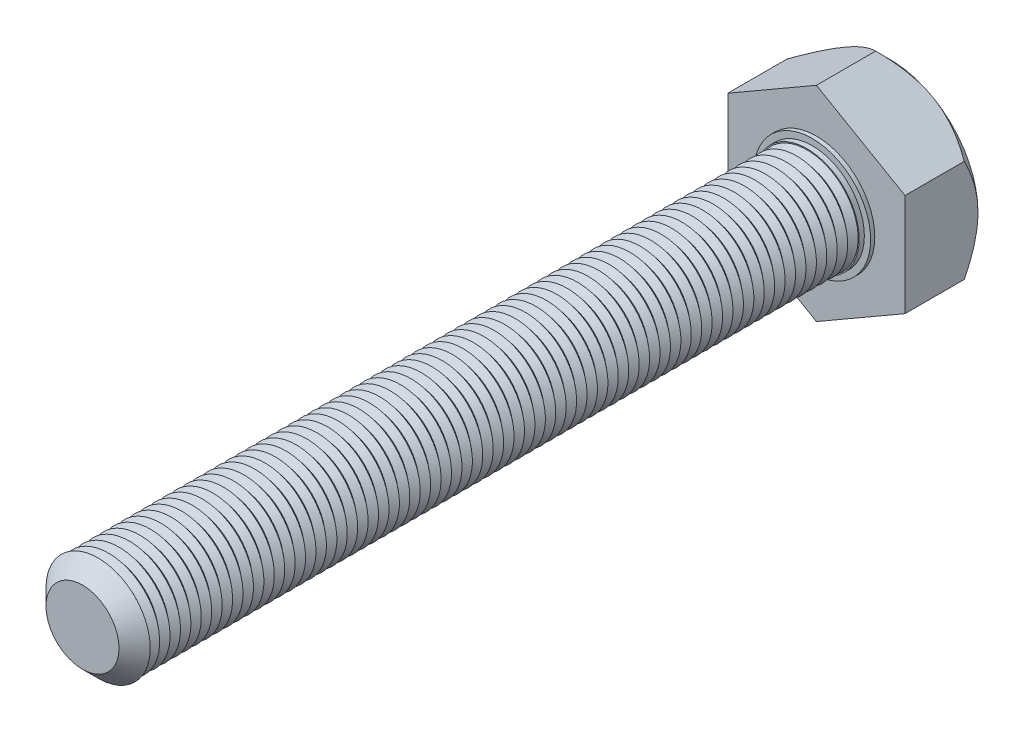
ISO-10303-21;
HEADER;
FILE_DESCRIPTION(('STEP AP214'),'2;1');
FILE_NAME('part.step','',(''),(''),'','','');
FILE_SCHEMA(('AUTOMOTIVE_DESIGN { 1 0 10303 214 1 1 1 1 }'));
ENDSEC;
DATA;
#1=APPLICATION_CONTEXT('core data for automotive mechanical design processes');
#2=APPLICATION_PROTOCOL_DEFINITION('international standard','automotive_design',2000,#1);
#3=PRODUCT_CONTEXT('',#1,'mechanical');
#4=PRODUCT('Part','Part','',(#3));
#5=PRODUCT_RELATED_PRODUCT_CATEGORY('part','',(#4));
#6=PRODUCT_DEFINITION_FORMATION('','',#4);
#7=PRODUCT_DEFINITION_CONTEXT('part definition',#1,'design');
#8=PRODUCT_DEFINITION('design','',#6,#7);
#9=PRODUCT_DEFINITION_SHAPE('','',#8);
#10=(LENGTH_UNIT() NAMED_UNIT(*) SI_UNIT(.MILLI.,.METRE.));
#11=(NAMED_UNIT(*) PLANE_ANGLE_UNIT() SI_UNIT($,.RADIAN.));
#12=(NAMED_UNIT(*) SI_UNIT($,.STERADIAN.) SOLID_ANGLE_UNIT());
#13=UNCERTAINTY_MEASURE_WITH_UNIT(LENGTH_MEASURE(1.E-05),#10,'distance_accuracy_value','');
#14=(GEOMETRIC_REPRESENTATION_CONTEXT(3) GLOBAL_UNCERTAINTY_ASSIGNED_CONTEXT((#13)) GLOBAL_UNIT_ASSIGNED_CONTEXT((#10,
#11,#12)) REPRESENTATION_CONTEXT('',''));
#15=CARTESIAN_POINT('',(0.,0.,0.));
#16=DIRECTION('',(0.,0.,1.));
#17=DIRECTION('',(1.,0.,0.));
#18=AXIS2_PLACEMENT_3D('',#15,#16,#17);
#19=CARTESIAN_POINT('',(0.,0.,73.9));
#20=DIRECTION('',(0.,0.,-1.));
#21=DIRECTION('',(-1.,0.,0.));
#22=AXIS2_PLACEMENT_3D('',#19,#20,#21);
#23=CYLINDRICAL_SURFACE('',#22,5.);
#24=CARTESIAN_POINT('',(0.,0.,3.9));
#25=DIRECTION('',(0.,0.,1.));
#26=DIRECTION('',(1.,0.,0.));
#27=AXIS2_PLACEMENT_3D('',#24,#25,#26);
#28=CIRCLE('',#27,5.);
#29=CARTESIAN_POINT('',(5.,0.,3.9));
#30=VERTEX_POINT('',#29);
#31=EDGE_CURVE('E1192',#30,#30,#28,.T.);
#32=ORIENTED_EDGE('',*,*,#31,.T.);
#33=EDGE_LOOP('',(#32));
#34=FACE_BOUND('',#33,.T.);
#35=CARTESIAN_POINT('',(0.,0.,4.4));
#36=DIRECTION('',(0.,0.,1.));
#37=DIRECTION('',(1.,0.,0.));
#38=AXIS2_PLACEMENT_3D('',#35,#36,#37);
#39=CIRCLE('',#38,5.);
#40=CARTESIAN_POINT('',(5.,0.,4.4));
#41=VERTEX_POINT('',#40);
#42=EDGE_CURVE('E36',#41,#41,#39,.T.);
#43=ORIENTED_EDGE('',*,*,#42,.F.);
#44=EDGE_LOOP('',(#43));
#45=FACE_BOUND('',#44,.T.);
#46=ADVANCED_FACE('F32',(#34,#45),#23,.T.);
#47=CARTESIAN_POINT('',(0.,0.,3.9));
#48=DIRECTION('',(0.,0.,1.));
#49=DIRECTION('',(1.,0.,0.));
#50=AXIS2_PLACEMENT_3D('',#47,#48,#49);
#51=PLANE('',#50);
#52=CARTESIAN_POINT('',(0.,0.,3.9));
#53=DIRECTION('',(0.,0.,1.));
#54=DIRECTION('',(1.,0.,0.));
#55=AXIS2_PLACEMENT_3D('',#52,#53,#54);
#56=CIRCLE('',#55,5.6);
#57=CARTESIAN_POINT('',(5.6,0.,3.9));
#58=VERTEX_POINT('',#57);
#59=EDGE_CURVE('E1195',#58,#58,#56,.T.);
#60=ORIENTED_EDGE('',*,*,#59,.T.);
#61=EDGE_LOOP('',(#60));
#62=FACE_BOUND('',#61,.T.);
#63=ORIENTED_EDGE('',*,*,#31,.F.);
#64=EDGE_LOOP('',(#63));
#65=FACE_BOUND('',#64,.T.);
#66=ADVANCED_FACE('F207',(#62,#65),#51,.T.);
#67=CARTESIAN_POINT('',(0.,9.81495457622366,3.5));
#68=DIRECTION('',(0.,0.,1.));
#69=DIRECTION('',(1.,0.,0.));
#70=AXIS2_PLACEMENT_3D('',#67,#68,#69);
#71=PLANE('',#70);
#72=DIRECTION('',(0.866025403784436,0.500000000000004,0.));
#73=VECTOR('',#72,1.);
#74=CARTESIAN_POINT('',(-8.5,4.90747728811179,3.5));
#75=LINE('',#74,#73);
#76=CARTESIAN_POINT('',(-8.5,4.90747728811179,3.5));
#77=VERTEX_POINT('',#76);
#78=CARTESIAN_POINT('',(0.,9.81495457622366,3.5));
#79=VERTEX_POINT('',#78);
#80=EDGE_CURVE('E1230',#77,#79,#75,.T.);
#81=ORIENTED_EDGE('',*,*,#80,.F.);
#82=DIRECTION('',(0.,-1.,0.));
#83=VECTOR('',#82,1.);
#84=CARTESIAN_POINT('',(-8.5,4.90747728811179,3.5));
#85=LINE('',#84,#83);
#86=CARTESIAN_POINT('',(-8.5,-4.90747728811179,3.5));
#87=VERTEX_POINT('',#86);
#88=EDGE_CURVE('E1212',#77,#87,#85,.T.);
#89=ORIENTED_EDGE('',*,*,#88,.T.);
#90=DIRECTION('',(0.866025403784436,-0.500000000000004,0.));
#91=VECTOR('',#90,1.);
#92=CARTESIAN_POINT('',(-8.5,-4.90747728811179,3.5));
#93=LINE('',#92,#91);
#94=CARTESIAN_POINT('',(0.,-9.81495457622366,3.5));
#95=VERTEX_POINT('',#94);
#96=EDGE_CURVE('E1223',#87,#95,#93,.T.);
#97=ORIENTED_EDGE('',*,*,#96,.T.);
#98=DIRECTION('',(-0.866025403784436,-0.500000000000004,0.));
#99=VECTOR('',#98,1.);
#100=CARTESIAN_POINT('',(8.5,-4.90747728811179,3.5));
#101=LINE('',#100,#99);
#102=CARTESIAN_POINT('',(8.5,-4.90747728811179,3.5));
#103=VERTEX_POINT('',#102);
#104=EDGE_CURVE('E1225',#103,#95,#101,.T.);
#105=ORIENTED_EDGE('',*,*,#104,.F.);
#106=DIRECTION('',(0.,-1.,0.));
#107=VECTOR('',#106,1.);
#108=CARTESIAN_POINT('',(8.5,4.90747728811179,3.5));
#109=LINE('',#108,#107);
#110=CARTESIAN_POINT('',(8.5,4.90747728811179,3.5));
#111=VERTEX_POINT('',#110);
#112=EDGE_CURVE('E1228',#111,#103,#109,.T.);
#113=ORIENTED_EDGE('',*,*,#112,.F.);
#114=DIRECTION('',(-0.866025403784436,0.500000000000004,0.));
#115=VECTOR('',#114,1.);
#116=CARTESIAN_POINT('',(8.5,4.90747728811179,3.5));
#117=LINE('',#116,#115);
#118=EDGE_CURVE('E1206',#111,#79,#117,.T.);
#119=ORIENTED_EDGE('',*,*,#118,.T.);
#120=EDGE_LOOP('',(#81,#89,#97,#105,#113,#119));
#121=FACE_BOUND('',#120,.T.);
#122=CARTESIAN_POINT('',(0.,0.,3.5));
#123=DIRECTION('',(0.,0.,1.));
#124=DIRECTION('',(1.,0.,0.));
#125=AXIS2_PLACEMENT_3D('',#122,#123,#124);
#126=CIRCLE('',#125,5.6);
#127=CARTESIAN_POINT('',(5.6,0.,3.5));
#128=VERTEX_POINT('',#127);
#129=EDGE_CURVE('E1194',#128,#128,#126,.T.);
#130=ORIENTED_EDGE('',*,*,#129,.F.);
#131=EDGE_LOOP('',(#130));
#132=FACE_BOUND('',#131,.T.);
#133=ADVANCED_FACE('F165',(#121,#132),#71,.T.);
#134=CARTESIAN_POINT('',(-8.5,4.90747728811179,3.5));
#135=DIRECTION('',(-0.500000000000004,0.866025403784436,0.));
#136=DIRECTION('',(-0.866025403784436,-0.500000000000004,0.));
#137=AXIS2_PLACEMENT_3D('',#134,#135,#136);
#138=PLANE('',#137);
#139=DIRECTION('',(0.,0.,-1.));
#140=VECTOR('',#139,1.);
#141=CARTESIAN_POINT('',(0.,9.81495457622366,3.5));
#142=LINE('',#141,#140);
#143=CARTESIAN_POINT('',(0.,9.81495457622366,-2.18504542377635));
#144=VERTEX_POINT('',#143);
#145=EDGE_CURVE('E1208',#79,#144,#142,.T.);
#146=ORIENTED_EDGE('',*,*,#145,.T.);
#147=CARTESIAN_POINT('',(0.000199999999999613,9.8150700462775,-2.18492995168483));
#148=CARTESIAN_POINT('',(-0.145938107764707,9.73069717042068,-2.26928998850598));
#149=CARTESIAN_POINT('',(-0.293216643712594,9.64566586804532,-2.35107537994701));
#150=CARTESIAN_POINT('',(-0.590240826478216,9.47417887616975,-2.50868010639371));
#151=CARTESIAN_POINT('',(-0.73998776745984,9.38772243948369,-2.58449618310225));
#152=CARTESIAN_POINT('',(-1.04284137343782,9.21286982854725,-2.72966661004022));
#153=CARTESIAN_POINT('',(-1.1959623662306,9.12446538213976,-2.79898147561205));
#154=CARTESIAN_POINT('',(-1.50468648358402,8.94622342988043,-2.92963931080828));
#155=CARTESIAN_POINT('',(-1.66028922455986,8.85638614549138,-2.99098349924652));
#156=CARTESIAN_POINT('',(-2.12594374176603,8.58754038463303,-3.15968226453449));
#157=CARTESIAN_POINT('',(-2.43971299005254,8.40638562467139,-3.25410101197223));
#158=CARTESIAN_POINT('',(-2.91546156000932,8.13171205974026,-3.36330945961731));
#159=CARTESIAN_POINT('',(-3.07473438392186,8.03975585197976,-3.39429440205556));
#160=CARTESIAN_POINT('',(-3.39463410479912,7.85506166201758,-3.44476295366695));
#161=CARTESIAN_POINT('',(-3.55526079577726,7.76232379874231,-3.46424828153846));
#162=CARTESIAN_POINT('',(-3.94668826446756,7.53633304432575,-3.49691830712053));
#163=CARTESIAN_POINT('',(-4.17791015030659,7.40283702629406,-3.50377264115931));
#164=CARTESIAN_POINT('',(-4.63993781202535,7.13608523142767,-3.49226596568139));
#165=CARTESIAN_POINT('',(-4.87074341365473,7.00282955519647,-3.47389611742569));
#166=CARTESIAN_POINT('',(-5.3301783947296,6.73757464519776,-3.41302370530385));
#167=CARTESIAN_POINT('',(-5.5588050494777,6.60557698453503,-3.37049415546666));
#168=CARTESIAN_POINT('',(-6.01212885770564,6.34385036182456,-3.26361456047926));
#169=CARTESIAN_POINT('',(-6.23682631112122,6.21412122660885,-3.19926618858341));
#170=CARTESIAN_POINT('',(-6.63569693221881,5.98383316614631,-3.06688449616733));
#171=CARTESIAN_POINT('',(-6.81075347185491,5.88276422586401,-3.00233332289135));
#172=CARTESIAN_POINT('',(-7.15772421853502,5.68244057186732,-2.86282918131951));
#173=CARTESIAN_POINT('',(-7.32963833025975,5.58318591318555,-2.78787589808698));
#174=CARTESIAN_POINT('',(-7.66978273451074,5.38680344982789,-2.62924760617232));
#175=CARTESIAN_POINT('',(-7.83802270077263,5.28967006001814,-2.5456000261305));
#176=CARTESIAN_POINT('',(-8.17138743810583,5.09720183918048,-2.37068124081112));
#177=CARTESIAN_POINT('',(-8.3365140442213,5.00186594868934,-2.27941471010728));
#178=CARTESIAN_POINT('',(-8.5002,4.90736181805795,-2.18492995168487));
#179=B_SPLINE_CURVE_WITH_KNOTS('',3,(#147,#148,#149,#150,#151,#152,#153,#154,#155,#156,#157,
#158,#159,#160,#161,#162,#163,#164,#165,#166,#167,#168,#169,#170,#171,#172,#173,#174,#175,#176,
#177,#178),.UNSPECIFIED.,.F.,.F.,(4,2,2,2,2,2,2,2,2,2,2,2,2,2,2,4),(0.,0.565988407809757,
1.1322836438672,1.7018214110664,2.27127198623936,3.39189520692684,3.95110786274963,
4.51023691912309,5.31023384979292,6.11051117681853,6.91168416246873,7.71279572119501,
8.34908108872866,8.985385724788,9.61974061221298,10.2537091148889),.UNSPECIFIED.);
#180=CARTESIAN_POINT('',(-4.25000000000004,7.36121593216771,-3.5));
#181=VERTEX_POINT('',#180);
#182=EDGE_CURVE('E179',#144,#181,#179,.T.);
#183=ORIENTED_EDGE('',*,*,#182,.T.);
#184=CARTESIAN_POINT('',(-8.5,4.90747728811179,-2.18504542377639));
#185=VERTEX_POINT('',#184);
#186=EDGE_CURVE('E48',#181,#185,#179,.T.);
#187=ORIENTED_EDGE('',*,*,#186,.T.);
#188=DIRECTION('',(0.,0.,-1.));
#189=VECTOR('',#188,1.);
#190=CARTESIAN_POINT('',(-8.5,4.90747728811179,3.5));
#191=LINE('',#190,#189);
#192=EDGE_CURVE('E129',#77,#185,#191,.T.);
#193=ORIENTED_EDGE('',*,*,#192,.F.);
#194=ORIENTED_EDGE('',*,*,#80,.T.);
#195=EDGE_LOOP('',(#146,#183,#187,#193,#194));
#196=FACE_BOUND('',#195,.T.);
#197=ADVANCED_FACE('F190',(#196),#138,.T.);
#198=CARTESIAN_POINT('',(-8.5,4.90747728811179,3.5));
#199=DIRECTION('',(1.,0.,0.));
#200=DIRECTION('',(0.,1.,0.));
#201=AXIS2_PLACEMENT_3D('',#198,#199,#200);
#202=PLANE('',#201);
#203=CARTESIAN_POINT('',(-8.5,-12.1920125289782,2.86254249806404));
#204=CARTESIAN_POINT('',(-8.5,-11.8850797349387,2.61082392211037));
#205=CARTESIAN_POINT('',(-8.5,-11.576668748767,2.36087935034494));
#206=CARTESIAN_POINT('',(-8.5,-10.9561372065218,1.86547967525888));
#207=CARTESIAN_POINT('',(-8.5,-10.6440157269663,1.62002572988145));
#208=CARTESIAN_POINT('',(-8.5,-10.0120128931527,1.13201186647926));
#209=CARTESIAN_POINT('',(-8.5,-9.69208395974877,0.889513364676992));
#210=CARTESIAN_POINT('',(-8.5,-9.04694255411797,0.411694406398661));
#211=CARTESIAN_POINT('',(-8.5,-8.72173059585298,0.176373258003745));
#212=CARTESIAN_POINT('',(-8.5,-8.03420305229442,-0.306710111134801));
#213=CARTESIAN_POINT('',(-8.5,-7.67125851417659,-0.5535821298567));
#214=CARTESIAN_POINT('',(-8.5,-6.93573662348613,-1.03293293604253));
#215=CARTESIAN_POINT('',(-8.5,-6.56315617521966,-1.26540701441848));
#216=CARTESIAN_POINT('',(-8.5,-5.80808928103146,-1.70966223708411));
#217=CARTESIAN_POINT('',(-8.5,-5.42565676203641,-1.92153431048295));
#218=CARTESIAN_POINT('',(-8.5,-4.64715020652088,-2.31836852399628));
#219=CARTESIAN_POINT('',(-8.5,-4.25108835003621,-2.50335395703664));
#220=CARTESIAN_POINT('',(-8.5,-3.70359788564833,-2.72910207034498));
#221=CARTESIAN_POINT('',(-8.5,-3.55880298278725,-2.78605368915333));
#222=CARTESIAN_POINT('',(-8.5,-3.26725502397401,-2.89469228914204));
#223=CARTESIAN_POINT('',(-8.5,-3.12050198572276,-2.94637931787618));
#224=CARTESIAN_POINT('',(-8.5,-2.6772723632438,-3.09269615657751));
#225=CARTESIAN_POINT('',(-8.5,-2.37781904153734,-3.17858433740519));
#226=CARTESIAN_POINT('',(-8.5,-1.77888238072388,-3.32061226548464));
#227=CARTESIAN_POINT('',(-8.5,-1.47954774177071,-3.37737097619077));
#228=CARTESIAN_POINT('',(-8.5,-0.876620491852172,-3.4601254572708));
#229=CARTESIAN_POINT('',(-8.5,-0.573028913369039,-3.48612856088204));
#230=CARTESIAN_POINT('',(-8.5,0.0193823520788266,-3.50486563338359));
#231=CARTESIAN_POINT('',(-8.5,0.308149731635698,-3.49925843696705));
#232=CARTESIAN_POINT('',(-8.5,0.883637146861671,-3.45901759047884));
#233=CARTESIAN_POINT('',(-8.5,1.170357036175,-3.42438188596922));
#234=CARTESIAN_POINT('',(-8.5,1.74468002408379,-3.32750492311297));
#235=CARTESIAN_POINT('',(-8.5,2.03219421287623,-3.26474596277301));
#236=CARTESIAN_POINT('',(-8.5,2.60080335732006,-3.11524647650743));
#237=CARTESIAN_POINT('',(-8.5,2.88189843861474,-3.02850642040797));
#238=CARTESIAN_POINT('',(-8.5,3.4442806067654,-2.83257154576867));
#239=CARTESIAN_POINT('',(-8.5,3.72538216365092,-2.7228509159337));
#240=CARTESIAN_POINT('',(-8.5,4.2803981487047,-2.48639288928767));
#241=CARTESIAN_POINT('',(-8.5,4.55430935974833,-2.35964802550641));
#242=CARTESIAN_POINT('',(-8.5,5.09620499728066,-2.09214421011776));
#243=CARTESIAN_POINT('',(-8.5,5.36416833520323,-1.95134288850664));
#244=CARTESIAN_POINT('',(-8.5,5.8939714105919,-1.65881379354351));
#245=CARTESIAN_POINT('',(-8.5,6.15581205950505,-1.5070876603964));
#246=CARTESIAN_POINT('',(-8.5,6.66134709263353,-1.20255155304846));
#247=CARTESIAN_POINT('',(-8.5,6.90529857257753,-1.05016610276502));
#248=CARTESIAN_POINT('',(-8.5,7.38900967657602,-0.738862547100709));
#249=CARTESIAN_POINT('',(-8.5,7.62876898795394,-0.579943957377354));
#250=CARTESIAN_POINT('',(-8.5,8.10273173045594,-0.258015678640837));
#251=CARTESIAN_POINT('',(-8.5,8.33696417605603,-0.0950485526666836));
#252=CARTESIAN_POINT('',(-8.5,8.80220909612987,0.235290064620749));
#253=CARTESIAN_POINT('',(-8.5,9.03322244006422,0.40266032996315));
#254=CARTESIAN_POINT('',(-8.5,9.2628838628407,0.571834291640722));
#255=B_SPLINE_CURVE_WITH_KNOTS('',3,(#203,#204,#205,#206,#207,#208,#209,#210,#211,#212,#213,
#214,#215,#216,#217,#218,#219,#220,#221,#222,#223,#224,#225,#226,#227,#228,#229,#230,#231,#232,
#233,#234,#235,#236,#237,#238,#239,#240,#241,#242,#243,#244,#245,#246,#247,#248,#249,#250,#251,
#252,#253,#254),.UNSPECIFIED.,.F.,.F.,(4,2,2,2,2,2,2,2,2,2,2,2,2,2,2,2,2,2,2,2,2,2,2,2,2,4),(0.,
1.19087266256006,2.38204819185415,3.58630969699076,4.79045473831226,6.10704247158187,
7.42405856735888,8.7349694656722,10.0447378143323,10.5114279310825,10.9781138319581,
11.9114654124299,12.8240650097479,13.73644696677,14.6014103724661,15.4664349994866,
16.3480826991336,17.2297131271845,18.1342965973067,19.0392781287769,19.9470749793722,
20.854735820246,21.7175178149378,22.5803638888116,23.4363510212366,24.2921022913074),.UNSPECIFIED.);
#256=CARTESIAN_POINT('',(-8.5,-4.90747728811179,-2.18504542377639));
#257=VERTEX_POINT('',#256);
#258=CARTESIAN_POINT('',(-8.5,0.,-3.5));
#259=VERTEX_POINT('',#258);
#260=EDGE_CURVE('E56',#257,#259,#255,.T.);
#261=ORIENTED_EDGE('',*,*,#260,.F.);
#262=DIRECTION('',(0.,0.,-1.));
#263=VECTOR('',#262,1.);
#264=CARTESIAN_POINT('',(-8.5,-4.90747728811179,3.5));
#265=LINE('',#264,#263);
#266=EDGE_CURVE('E1217',#87,#257,#265,.T.);
#267=ORIENTED_EDGE('',*,*,#266,.F.);
#268=ORIENTED_EDGE('',*,*,#88,.F.);
#269=ORIENTED_EDGE('',*,*,#192,.T.);
#270=EDGE_CURVE('E1232',#259,#185,#255,.T.);
#271=ORIENTED_EDGE('',*,*,#270,.F.);
#272=EDGE_LOOP('',(#261,#267,#268,#269,#271));
#273=FACE_BOUND('',#272,.T.);
#274=ADVANCED_FACE('F193',(#273),#202,.F.);
#275=CARTESIAN_POINT('',(-8.5,-4.90747728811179,3.5));
#276=DIRECTION('',(0.500000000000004,0.866025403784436,0.));
#277=DIRECTION('',(-0.866025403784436,0.500000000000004,0.));
#278=AXIS2_PLACEMENT_3D('',#275,#276,#277);
#279=PLANE('',#278);
#280=CARTESIAN_POINT('',(0.000200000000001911,-9.8150700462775,-2.18492995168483));
#281=CARTESIAN_POINT('',(-0.145938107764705,-9.73069717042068,-2.26928998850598));
#282=CARTESIAN_POINT('',(-0.293216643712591,-9.64566586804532,-2.35107537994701));
#283=CARTESIAN_POINT('',(-0.590240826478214,-9.47417887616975,-2.50868010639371));
#284=CARTESIAN_POINT('',(-0.739987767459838,-9.38772243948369,-2.58449618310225));
#285=CARTESIAN_POINT('',(-1.04284137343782,-9.21286982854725,-2.72966661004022));
#286=CARTESIAN_POINT('',(-1.1959623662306,-9.12446538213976,-2.79898147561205));
#287=CARTESIAN_POINT('',(-1.50468648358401,-8.94622342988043,-2.92963931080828));
#288=CARTESIAN_POINT('',(-1.66028922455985,-8.85638614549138,-2.99098349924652));
#289=CARTESIAN_POINT('',(-2.12594374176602,-8.58754038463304,-3.15968226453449));
#290=CARTESIAN_POINT('',(-2.43971299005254,-8.40638562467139,-3.25410101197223));
#291=CARTESIAN_POINT('',(-2.91546156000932,-8.13171205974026,-3.36330945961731));
#292=CARTESIAN_POINT('',(-3.07473438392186,-8.03975585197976,-3.39429440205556));
#293=CARTESIAN_POINT('',(-3.39463410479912,-7.85506166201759,-3.44476295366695));
#294=CARTESIAN_POINT('',(-3.55526079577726,-7.76232379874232,-3.46424828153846));
#295=CARTESIAN_POINT('',(-3.94668826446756,-7.53633304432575,-3.49691830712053));
#296=CARTESIAN_POINT('',(-4.17791015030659,-7.40283702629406,-3.50377264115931));
#297=CARTESIAN_POINT('',(-4.63993781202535,-7.13608523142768,-3.49226596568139));
#298=CARTESIAN_POINT('',(-4.87074341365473,-7.00282955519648,-3.47389611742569));
#299=CARTESIAN_POINT('',(-5.3301783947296,-6.73757464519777,-3.41302370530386));
#300=CARTESIAN_POINT('',(-5.5588050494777,-6.60557698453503,-3.37049415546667));
#301=CARTESIAN_POINT('',(-6.01212885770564,-6.34385036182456,-3.26361456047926));
#302=CARTESIAN_POINT('',(-6.23682631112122,-6.21412122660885,-3.19926618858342));
#303=CARTESIAN_POINT('',(-6.63569693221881,-5.98383316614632,-3.06688449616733));
#304=CARTESIAN_POINT('',(-6.81075347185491,-5.88276422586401,-3.00233332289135));
#305=CARTESIAN_POINT('',(-7.15772421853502,-5.68244057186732,-2.86282918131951));
#306=CARTESIAN_POINT('',(-7.32963833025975,-5.58318591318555,-2.78787589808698));
#307=CARTESIAN_POINT('',(-7.66978273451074,-5.3868034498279,-2.62924760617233));
#308=CARTESIAN_POINT('',(-7.83802270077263,-5.28967006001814,-2.5456000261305));
#309=CARTESIAN_POINT('',(-8.17138743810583,-5.09720183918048,-2.37068124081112));
#310=CARTESIAN_POINT('',(-8.3365140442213,-5.00186594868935,-2.27941471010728));
#311=CARTESIAN_POINT('',(-8.5002,-4.90736181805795,-2.18492995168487));
#312=B_SPLINE_CURVE_WITH_KNOTS('',3,(#280,#281,#282,#283,#284,#285,#286,#287,#288,#289,#290,
#291,#292,#293,#294,#295,#296,#297,#298,#299,#300,#301,#302,#303,#304,#305,#306,#307,#308,#309,
#310,#311),.UNSPECIFIED.,.F.,.F.,(4,2,2,2,2,2,2,2,2,2,2,2,2,2,2,4),(0.,0.565988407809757,
1.1322836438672,1.7018214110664,2.27127198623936,3.39189520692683,3.95110786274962,
4.51023691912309,5.31023384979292,6.11051117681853,6.91168416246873,7.71279572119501,
8.34908108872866,8.985385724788,9.61974061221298,10.2537091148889),.UNSPECIFIED.);
#313=CARTESIAN_POINT('',(0.,-9.81495457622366,-2.18504542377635));
#314=VERTEX_POINT('',#313);
#315=CARTESIAN_POINT('',(-4.25000000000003,-7.36121593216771,-3.5));
#316=VERTEX_POINT('',#315);
#317=EDGE_CURVE('E173',#314,#316,#312,.T.);
#318=ORIENTED_EDGE('',*,*,#317,.F.);
#319=DIRECTION('',(0.,0.,-1.));
#320=VECTOR('',#319,1.);
#321=CARTESIAN_POINT('',(0.,-9.81495457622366,3.5));
#322=LINE('',#321,#320);
#323=EDGE_CURVE('E1210',#95,#314,#322,.T.);
#324=ORIENTED_EDGE('',*,*,#323,.F.);
#325=ORIENTED_EDGE('',*,*,#96,.F.);
#326=ORIENTED_EDGE('',*,*,#266,.T.);
#327=EDGE_CURVE('E184',#316,#257,#312,.T.);
#328=ORIENTED_EDGE('',*,*,#327,.F.);
#329=EDGE_LOOP('',(#318,#324,#325,#326,#328));
#330=FACE_BOUND('',#329,.T.);
#331=ADVANCED_FACE('F1241',(#330),#279,.F.);
#332=CARTESIAN_POINT('',(8.5,-4.90747728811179,3.5));
#333=DIRECTION('',(0.500000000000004,-0.866025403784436,0.));
#334=DIRECTION('',(0.866025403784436,0.500000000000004,0.));
#335=AXIS2_PLACEMENT_3D('',#332,#333,#334);
#336=PLANE('',#335);
#337=ORIENTED_EDGE('',*,*,#323,.T.);
#338=CARTESIAN_POINT('',(-0.000199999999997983,-9.8150700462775,-2.18492995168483));
#339=CARTESIAN_POINT('',(0.145938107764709,-9.73069717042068,-2.26928998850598));
#340=CARTESIAN_POINT('',(0.293216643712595,-9.64566586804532,-2.35107537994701));
#341=CARTESIAN_POINT('',(0.590240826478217,-9.47417887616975,-2.50868010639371));
#342=CARTESIAN_POINT('',(0.739987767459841,-9.38772243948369,-2.58449618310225));
#343=CARTESIAN_POINT('',(1.04284137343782,-9.21286982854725,-2.72966661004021));
#344=CARTESIAN_POINT('',(1.1959623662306,-9.12446538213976,-2.79898147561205));
#345=CARTESIAN_POINT('',(1.50468648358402,-8.94622342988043,-2.92963931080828));
#346=CARTESIAN_POINT('',(1.66028922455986,-8.85638614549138,-2.99098349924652));
#347=CARTESIAN_POINT('',(2.12594374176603,-8.58754038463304,-3.15968226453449));
#348=CARTESIAN_POINT('',(2.43971299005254,-8.40638562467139,-3.25410101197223));
#349=CARTESIAN_POINT('',(2.91546156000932,-8.13171205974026,-3.36330945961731));
#350=CARTESIAN_POINT('',(3.07473438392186,-8.03975585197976,-3.39429440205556));
#351=CARTESIAN_POINT('',(3.39463410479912,-7.85506166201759,-3.44476295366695));
#352=CARTESIAN_POINT('',(3.55526079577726,-7.76232379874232,-3.46424828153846));
#353=CARTESIAN_POINT('',(3.94668826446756,-7.53633304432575,-3.49691830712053));
#354=CARTESIAN_POINT('',(4.17791015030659,-7.40283702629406,-3.50377264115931));
#355=CARTESIAN_POINT('',(4.63993781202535,-7.13608523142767,-3.49226596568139));
#356=CARTESIAN_POINT('',(4.87074341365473,-7.00282955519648,-3.47389611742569));
#357=CARTESIAN_POINT('',(5.3301783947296,-6.73757464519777,-3.41302370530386));
#358=CARTESIAN_POINT('',(5.5588050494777,-6.60557698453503,-3.37049415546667));
#359=CARTESIAN_POINT('',(6.01212885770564,-6.34385036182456,-3.26361456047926));
#360=CARTESIAN_POINT('',(6.23682631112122,-6.21412122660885,-3.19926618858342));
#361=CARTESIAN_POINT('',(6.63569693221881,-5.98383316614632,-3.06688449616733));
#362=CARTESIAN_POINT('',(6.81075347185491,-5.88276422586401,-3.00233332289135));
#363=CARTESIAN_POINT('',(7.15772421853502,-5.68244057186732,-2.86282918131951));
#364=CARTESIAN_POINT('',(7.32963833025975,-5.58318591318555,-2.78787589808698));
#365=CARTESIAN_POINT('',(7.66978273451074,-5.3868034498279,-2.62924760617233));
#366=CARTESIAN_POINT('',(7.83802270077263,-5.28967006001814,-2.5456000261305));
#367=CARTESIAN_POINT('',(8.17138743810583,-5.09720183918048,-2.37068124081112));
#368=CARTESIAN_POINT('',(8.3365140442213,-5.00186594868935,-2.27941471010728));
#369=CARTESIAN_POINT('',(8.5002,-4.90736181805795,-2.18492995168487));
#370=B_SPLINE_CURVE_WITH_KNOTS('',3,(#338,#339,#340,#341,#342,#343,#344,#345,#346,#347,#348,
#349,#350,#351,#352,#353,#354,#355,#356,#357,#358,#359,#360,#361,#362,#363,#364,#365,#366,#367,
#368,#369),.UNSPECIFIED.,.F.,.F.,(4,2,2,2,2,2,2,2,2,2,2,2,2,2,2,4),(0.,0.565988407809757,
1.1322836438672,1.7018214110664,2.27127198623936,3.39189520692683,3.95110786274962,
4.51023691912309,5.31023384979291,6.11051117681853,6.91168416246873,7.71279572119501,
8.34908108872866,8.985385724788,9.61974061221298,10.2537091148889),.UNSPECIFIED.);
#371=CARTESIAN_POINT('',(4.25000000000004,-7.36121593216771,-3.5));
#372=VERTEX_POINT('',#371);
#373=EDGE_CURVE('E138',#314,#372,#370,.T.);
#374=ORIENTED_EDGE('',*,*,#373,.T.);
#375=CARTESIAN_POINT('',(8.5,-4.90747728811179,-2.18504542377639));
#376=VERTEX_POINT('',#375);
#377=EDGE_CURVE('E124',#372,#376,#370,.T.);
#378=ORIENTED_EDGE('',*,*,#377,.T.);
#379=DIRECTION('',(0.,0.,-1.));
#380=VECTOR('',#379,1.);
#381=CARTESIAN_POINT('',(8.5,-4.90747728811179,3.5));
#382=LINE('',#381,#380);
#383=EDGE_CURVE('E137',#103,#376,#382,.T.);
#384=ORIENTED_EDGE('',*,*,#383,.F.);
#385=ORIENTED_EDGE('',*,*,#104,.T.);
#386=EDGE_LOOP('',(#337,#374,#378,#384,#385));
#387=FACE_BOUND('',#386,.T.);
#388=ADVANCED_FACE('F204',(#387),#336,.T.);
#389=CARTESIAN_POINT('',(8.5,4.90747728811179,3.5));
#390=DIRECTION('',(1.,0.,0.));
#391=DIRECTION('',(0.,1.,0.));
#392=AXIS2_PLACEMENT_3D('',#389,#390,#391);
#393=PLANE('',#392);
#394=ORIENTED_EDGE('',*,*,#383,.T.);
#395=CARTESIAN_POINT('',(8.5,-12.1920125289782,2.86254249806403));
#396=CARTESIAN_POINT('',(8.5,-11.8850797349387,2.61082392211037));
#397=CARTESIAN_POINT('',(8.5,-11.576668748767,2.36087935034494));
#398=CARTESIAN_POINT('',(8.5,-10.9561372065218,1.86547967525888));
#399=CARTESIAN_POINT('',(8.5,-10.6440157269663,1.62002572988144));
#400=CARTESIAN_POINT('',(8.5,-10.0120128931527,1.13201186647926));
#401=CARTESIAN_POINT('',(8.5,-9.69208395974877,0.88951336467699));
#402=CARTESIAN_POINT('',(8.5,-9.04694255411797,0.411694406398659));
#403=CARTESIAN_POINT('',(8.5,-8.72173059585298,0.176373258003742));
#404=CARTESIAN_POINT('',(8.5,-8.03420305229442,-0.306710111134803));
#405=CARTESIAN_POINT('',(8.5,-7.67125851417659,-0.553582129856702));
#406=CARTESIAN_POINT('',(8.5,-6.93573662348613,-1.03293293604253));
#407=CARTESIAN_POINT('',(8.5,-6.56315617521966,-1.26540701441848));
#408=CARTESIAN_POINT('',(8.5,-5.80808928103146,-1.70966223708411));
#409=CARTESIAN_POINT('',(8.5,-5.42565676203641,-1.92153431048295));
#410=CARTESIAN_POINT('',(8.5,-4.64715020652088,-2.31836852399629));
#411=CARTESIAN_POINT('',(8.5,-4.25108835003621,-2.50335395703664));
#412=CARTESIAN_POINT('',(8.5,-3.70359788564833,-2.72910207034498));
#413=CARTESIAN_POINT('',(8.5,-3.55880298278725,-2.78605368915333));
#414=CARTESIAN_POINT('',(8.5,-3.26725502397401,-2.89469228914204));
#415=CARTESIAN_POINT('',(8.5,-3.12050198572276,-2.94637931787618));
#416=CARTESIAN_POINT('',(8.5,-2.6772723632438,-3.09269615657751));
#417=CARTESIAN_POINT('',(8.5,-2.37781904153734,-3.17858433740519));
#418=CARTESIAN_POINT('',(8.5,-1.77888238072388,-3.32061226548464));
#419=CARTESIAN_POINT('',(8.5,-1.47954774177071,-3.37737097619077));
#420=CARTESIAN_POINT('',(8.5,-0.876620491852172,-3.4601254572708));
#421=CARTESIAN_POINT('',(8.5,-0.573028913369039,-3.48612856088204));
#422=CARTESIAN_POINT('',(8.5,0.0193823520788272,-3.50486563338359));
#423=CARTESIAN_POINT('',(8.5,0.308149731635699,-3.49925843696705));
#424=CARTESIAN_POINT('',(8.5,0.88363714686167,-3.45901759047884));
#425=CARTESIAN_POINT('',(8.5,1.170357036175,-3.42438188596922));
#426=CARTESIAN_POINT('',(8.5,1.74468002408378,-3.32750492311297));
#427=CARTESIAN_POINT('',(8.5,2.03219421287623,-3.26474596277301));
#428=CARTESIAN_POINT('',(8.5,2.60080335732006,-3.11524647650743));
#429=CARTESIAN_POINT('',(8.5,2.88189843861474,-3.02850642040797));
#430=CARTESIAN_POINT('',(8.5,3.44428060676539,-2.83257154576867));
#431=CARTESIAN_POINT('',(8.5,3.72538216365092,-2.7228509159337));
#432=CARTESIAN_POINT('',(8.5,4.2803981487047,-2.48639288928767));
#433=CARTESIAN_POINT('',(8.5,4.55430935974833,-2.35964802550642));
#434=CARTESIAN_POINT('',(8.5,5.09620499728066,-2.09214421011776));
#435=CARTESIAN_POINT('',(8.5,5.36416833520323,-1.95134288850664));
#436=CARTESIAN_POINT('',(8.5,5.8939714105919,-1.65881379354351));
#437=CARTESIAN_POINT('',(8.5,6.15581205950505,-1.5070876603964));
#438=CARTESIAN_POINT('',(8.5,6.66134709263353,-1.20255155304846));
#439=CARTESIAN_POINT('',(8.5,6.90529857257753,-1.05016610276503));
#440=CARTESIAN_POINT('',(8.5,7.38900967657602,-0.738862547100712));
#441=CARTESIAN_POINT('',(8.5,7.62876898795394,-0.579943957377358));
#442=CARTESIAN_POINT('',(8.5,8.10273173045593,-0.258015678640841));
#443=CARTESIAN_POINT('',(8.5,8.33696417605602,-0.0950485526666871));
#444=CARTESIAN_POINT('',(8.5,8.80220909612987,0.235290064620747));
#445=CARTESIAN_POINT('',(8.5,9.03322244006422,0.402660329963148));
#446=CARTESIAN_POINT('',(8.5,9.2628838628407,0.571834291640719));
#447=B_SPLINE_CURVE_WITH_KNOTS('',3,(#395,#396,#397,#398,#399,#400,#401,#402,#403,#404,#405,
#406,#407,#408,#409,#410,#411,#412,#413,#414,#415,#416,#417,#418,#419,#420,#421,#422,#423,#424,
#425,#426,#427,#428,#429,#430,#431,#432,#433,#434,#435,#436,#437,#438,#439,#440,#441,#442,#443,
#444,#445,#446),.UNSPECIFIED.,.F.,.F.,(4,2,2,2,2,2,2,2,2,2,2,2,2,2,2,2,2,2,2,2,2,2,2,2,2,4),(0.,
1.19087266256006,2.38204819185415,3.58630969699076,4.79045473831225,6.10704247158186,
7.42405856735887,8.7349694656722,10.0447378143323,10.5114279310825,10.9781138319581,
11.9114654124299,12.8240650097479,13.73644696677,14.6014103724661,15.4664349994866,
16.3480826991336,17.2297131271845,18.1342965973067,19.0392781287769,19.9470749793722,
20.854735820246,21.7175178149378,22.5803638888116,23.4363510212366,24.2921022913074),.UNSPECIFIED.);
#448=CARTESIAN_POINT('',(8.5,0.,-3.5));
#449=VERTEX_POINT('',#448);
#450=EDGE_CURVE('E115',#376,#449,#447,.T.);
#451=ORIENTED_EDGE('',*,*,#450,.T.);
#452=CARTESIAN_POINT('',(8.5,4.90747728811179,-2.18504542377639));
#453=VERTEX_POINT('',#452);
#454=EDGE_CURVE('E105',#449,#453,#447,.T.);
#455=ORIENTED_EDGE('',*,*,#454,.T.);
#456=DIRECTION('',(0.,0.,-1.));
#457=VECTOR('',#456,1.);
#458=CARTESIAN_POINT('',(8.5,4.90747728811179,3.5));
#459=LINE('',#458,#457);
#460=EDGE_CURVE('E1205',#111,#453,#459,.T.);
#461=ORIENTED_EDGE('',*,*,#460,.F.);
#462=ORIENTED_EDGE('',*,*,#112,.T.);
#463=EDGE_LOOP('',(#394,#451,#455,#461,#462));
#464=FACE_BOUND('',#463,.T.);
#465=ADVANCED_FACE('F135',(#464),#393,.T.);
#466=CARTESIAN_POINT('',(8.5,4.90747728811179,3.5));
#467=DIRECTION('',(-0.500000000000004,-0.866025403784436,0.));
#468=DIRECTION('',(0.866025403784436,-0.500000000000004,0.));
#469=AXIS2_PLACEMENT_3D('',#466,#467,#468);
#470=PLANE('',#469);
#471=CARTESIAN_POINT('',(-0.000200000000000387,9.8150700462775,-2.18492995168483));
#472=CARTESIAN_POINT('',(0.145938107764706,9.73069717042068,-2.26928998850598));
#473=CARTESIAN_POINT('',(0.293216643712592,9.64566586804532,-2.35107537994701));
#474=CARTESIAN_POINT('',(0.590240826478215,9.47417887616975,-2.50868010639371));
#475=CARTESIAN_POINT('',(0.739987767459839,9.38772243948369,-2.58449618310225));
#476=CARTESIAN_POINT('',(1.04284137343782,9.21286982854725,-2.72966661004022));
#477=CARTESIAN_POINT('',(1.1959623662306,9.12446538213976,-2.79898147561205));
#478=CARTESIAN_POINT('',(1.50468648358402,8.94622342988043,-2.92963931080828));
#479=CARTESIAN_POINT('',(1.66028922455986,8.85638614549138,-2.99098349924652));
#480=CARTESIAN_POINT('',(2.12594374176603,8.58754038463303,-3.15968226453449));
#481=CARTESIAN_POINT('',(2.43971299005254,8.40638562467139,-3.25410101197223));
#482=CARTESIAN_POINT('',(2.91546156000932,8.13171205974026,-3.36330945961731));
#483=CARTESIAN_POINT('',(3.07473438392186,8.03975585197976,-3.39429440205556));
#484=CARTESIAN_POINT('',(3.39463410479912,7.85506166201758,-3.44476295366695));
#485=CARTESIAN_POINT('',(3.55526079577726,7.76232379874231,-3.46424828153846));
#486=CARTESIAN_POINT('',(3.94668826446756,7.53633304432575,-3.49691830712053));
#487=CARTESIAN_POINT('',(4.17791015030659,7.40283702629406,-3.50377264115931));
#488=CARTESIAN_POINT('',(4.63993781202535,7.13608523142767,-3.49226596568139));
#489=CARTESIAN_POINT('',(4.87074341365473,7.00282955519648,-3.47389611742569));
#490=CARTESIAN_POINT('',(5.3301783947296,6.73757464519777,-3.41302370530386));
#491=CARTESIAN_POINT('',(5.5588050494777,6.60557698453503,-3.37049415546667));
#492=CARTESIAN_POINT('',(6.01212885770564,6.34385036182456,-3.26361456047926));
#493=CARTESIAN_POINT('',(6.23682631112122,6.21412122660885,-3.19926618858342));
#494=CARTESIAN_POINT('',(6.63569693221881,5.98383316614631,-3.06688449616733));
#495=CARTESIAN_POINT('',(6.81075347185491,5.88276422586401,-3.00233332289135));
#496=CARTESIAN_POINT('',(7.15772421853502,5.68244057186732,-2.86282918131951));
#497=CARTESIAN_POINT('',(7.32963833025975,5.58318591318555,-2.78787589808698));
#498=CARTESIAN_POINT('',(7.66978273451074,5.3868034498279,-2.62924760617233));
#499=CARTESIAN_POINT('',(7.83802270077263,5.28967006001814,-2.5456000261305));
#500=CARTESIAN_POINT('',(8.17138743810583,5.09720183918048,-2.37068124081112));
#501=CARTESIAN_POINT('',(8.3365140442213,5.00186594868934,-2.27941471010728));
#502=CARTESIAN_POINT('',(8.5002,4.90736181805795,-2.18492995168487));
#503=B_SPLINE_CURVE_WITH_KNOTS('',3,(#471,#472,#473,#474,#475,#476,#477,#478,#479,#480,#481,
#482,#483,#484,#485,#486,#487,#488,#489,#490,#491,#492,#493,#494,#495,#496,#497,#498,#499,#500,
#501,#502),.UNSPECIFIED.,.F.,.F.,(4,2,2,2,2,2,2,2,2,2,2,2,2,2,2,4),(0.,0.565988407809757,
1.1322836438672,1.7018214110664,2.27127198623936,3.39189520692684,3.95110786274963,
4.51023691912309,5.31023384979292,6.11051117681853,6.91168416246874,7.71279572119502,
8.34908108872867,8.985385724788,9.61974061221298,10.2537091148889),.UNSPECIFIED.);
#504=CARTESIAN_POINT('',(4.25000000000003,7.36121593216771,-3.5));
#505=VERTEX_POINT('',#504);
#506=EDGE_CURVE('E116',#144,#505,#503,.T.);
#507=ORIENTED_EDGE('',*,*,#506,.F.);
#508=ORIENTED_EDGE('',*,*,#145,.F.);
#509=ORIENTED_EDGE('',*,*,#118,.F.);
#510=ORIENTED_EDGE('',*,*,#460,.T.);
#511=EDGE_CURVE('E111',#505,#453,#503,.T.);
#512=ORIENTED_EDGE('',*,*,#511,.F.);
#513=EDGE_LOOP('',(#507,#508,#509,#510,#512));
#514=FACE_BOUND('',#513,.T.);
#515=ADVANCED_FACE('F195',(#514),#470,.F.);
#516=CARTESIAN_POINT('',(0.,0.,-3.5));
#517=DIRECTION('',(0.,0.,1.));
#518=DIRECTION('',(1.,0.,0.));
#519=AXIS2_PLACEMENT_3D('',#516,#517,#518);
#520=CONICAL_SURFACE('',#519,8.5,0.785398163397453);
#521=CARTESIAN_POINT('',(0.,0.,-3.5));
#522=DIRECTION('',(0.,0.,1.));
#523=DIRECTION('',(1.,0.,0.));
#524=AXIS2_PLACEMENT_3D('',#521,#522,#523);
#525=CIRCLE('',#524,8.5);
#526=EDGE_CURVE('E121',#372,#449,#525,.T.);
#527=ORIENTED_EDGE('',*,*,#526,.T.);
#528=ORIENTED_EDGE('',*,*,#450,.F.);
#529=ORIENTED_EDGE('',*,*,#377,.F.);
#530=EDGE_LOOP('',(#527,#528,#529));
#531=FACE_BOUND('',#530,.T.);
#532=ADVANCED_FACE('F122',(#531),#520,.T.);
#533=ORIENTED_EDGE('',*,*,#317,.T.);
#534=EDGE_CURVE('E128',#316,#372,#525,.T.);
#535=ORIENTED_EDGE('',*,*,#534,.T.);
#536=ORIENTED_EDGE('',*,*,#373,.F.);
#537=EDGE_LOOP('',(#533,#535,#536));
#538=FACE_BOUND('',#537,.T.);
#539=ADVANCED_FACE('F203',(#538),#520,.T.);
#540=ORIENTED_EDGE('',*,*,#260,.T.);
#541=EDGE_CURVE('E2211',#259,#316,#525,.T.);
#542=ORIENTED_EDGE('',*,*,#541,.T.);
#543=ORIENTED_EDGE('',*,*,#327,.T.);
#544=EDGE_LOOP('',(#540,#542,#543));
#545=FACE_BOUND('',#544,.T.);
#546=ADVANCED_FACE('F1297',(#545),#520,.T.);
#547=ORIENTED_EDGE('',*,*,#270,.T.);
#548=ORIENTED_EDGE('',*,*,#186,.F.);
#549=CARTESIAN_POINT('',(0.,0.,-3.5));
#550=DIRECTION('',(0.,0.,-1.));
#551=DIRECTION('',(-1.,0.,0.));
#552=AXIS2_PLACEMENT_3D('',#549,#550,#551);
#553=CIRCLE('',#552,8.5);
#554=EDGE_CURVE('E1198',#259,#181,#553,.T.);
#555=ORIENTED_EDGE('',*,*,#554,.F.);
#556=EDGE_LOOP('',(#547,#548,#555));
#557=FACE_BOUND('',#556,.T.);
#558=ADVANCED_FACE('F162',(#557),#520,.T.);
#559=ORIENTED_EDGE('',*,*,#506,.T.);
#560=EDGE_CURVE('E133',#505,#181,#525,.T.);
#561=ORIENTED_EDGE('',*,*,#560,.T.);
#562=ORIENTED_EDGE('',*,*,#182,.F.);
#563=EDGE_LOOP('',(#559,#561,#562));
#564=FACE_BOUND('',#563,.T.);
#565=ADVANCED_FACE('F161',(#564),#520,.T.);
#566=EDGE_CURVE('E41',#449,#505,#525,.T.);
#567=ORIENTED_EDGE('',*,*,#566,.T.);
#568=ORIENTED_EDGE('',*,*,#511,.T.);
#569=ORIENTED_EDGE('',*,*,#454,.F.);
#570=EDGE_LOOP('',(#567,#568,#569));
#571=FACE_BOUND('',#570,.T.);
#572=ADVANCED_FACE('F107',(#571),#520,.T.);
#573=CARTESIAN_POINT('',(0.,9.81495457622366,-3.5));
#574=DIRECTION('',(0.,0.,1.));
#575=DIRECTION('',(1.,0.,0.));
#576=AXIS2_PLACEMENT_3D('',#573,#574,#575);
#577=PLANE('',#576);
#578=ORIENTED_EDGE('',*,*,#566,.F.);
#579=ORIENTED_EDGE('',*,*,#526,.F.);
#580=ORIENTED_EDGE('',*,*,#534,.F.);
#581=ORIENTED_EDGE('',*,*,#541,.F.);
#582=ORIENTED_EDGE('',*,*,#554,.T.);
#583=ORIENTED_EDGE('',*,*,#560,.F.);
#584=EDGE_LOOP('',(#578,#579,#580,#581,#582,#583));
#585=FACE_BOUND('',#584,.T.);
#586=ADVANCED_FACE('F131',(#585),#577,.F.);
#587=CARTESIAN_POINT('',(0.,0.,3.9));
#588=DIRECTION('',(0.,0.,-1.));
#589=DIRECTION('',(-1.,0.,0.));
#590=AXIS2_PLACEMENT_3D('',#587,#588,#589);
#591=CYLINDRICAL_SURFACE('',#590,5.6);
#592=ORIENTED_EDGE('',*,*,#59,.F.);
#593=EDGE_LOOP('',(#592));
#594=FACE_BOUND('',#593,.T.);
#595=ORIENTED_EDGE('',*,*,#129,.T.);
#596=EDGE_LOOP('',(#595));
#597=FACE_BOUND('',#596,.T.);
#598=ADVANCED_FACE('F163',(#594,#597),#591,.T.);
#599=CARTESIAN_POINT('',(0.,-6.9,4.4));
#600=DIRECTION('',(0.,0.,1.));
#601=DIRECTION('',(1.,0.,0.));
#602=AXIS2_PLACEMENT_3D('',#599,#600,#601);
#603=PLANE('',#602);
#604=CARTESIAN_POINT('',(0.,0.,4.4));
#605=DIRECTION('',(0.,0.,-1.));
#606=DIRECTION('',(-1.,0.,0.));
#607=AXIS2_PLACEMENT_3D('',#604,#605,#606);
#608=CIRCLE('',#607,4.9);
#609=CARTESIAN_POINT('',(-4.9,0.,4.4));
#610=VERTEX_POINT('',#609);
#611=EDGE_CURVE('E1189',#610,#610,#608,.T.);
#612=ORIENTED_EDGE('',*,*,#611,.T.);
#613=EDGE_LOOP('',(#612));
#614=FACE_BOUND('',#613,.T.);
#615=ORIENTED_EDGE('',*,*,#42,.T.);
#616=EDGE_LOOP('',(#615));
#617=FACE_BOUND('',#616,.T.);
#618=ADVANCED_FACE('F226',(#614,#617),#603,.T.);
#619=CARTESIAN_POINT('',(0.,0.,4.9));
#620=DIRECTION('',(0.,0.,1.));
#621=DIRECTION('',(1.,0.,0.));
#622=AXIS2_PLACEMENT_3D('',#619,#620,#621);
#623=CONICAL_SURFACE('',#622,4.3,0.876058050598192);
#624=CARTESIAN_POINT('',(0.,0.,5.4));
#625=DIRECTION('',(0.,0.,-1.));
#626=DIRECTION('',(-1.,0.,0.));
#627=AXIS2_PLACEMENT_3D('',#624,#625,#626);
#628=CIRCLE('',#627,4.9);
#629=CARTESIAN_POINT('',(-4.9,0.,5.4));
#630=VERTEX_POINT('',#629);
#631=EDGE_CURVE('E1183',#630,#630,#628,.T.);
#632=ORIENTED_EDGE('',*,*,#631,.T.);
#633=EDGE_LOOP('',(#632));
#634=FACE_BOUND('',#633,.T.);
#635=CARTESIAN_POINT('',(0.,0.,4.9));
#636=DIRECTION('',(0.,0.,-1.));
#637=DIRECTION('',(-1.,0.,0.));
#638=AXIS2_PLACEMENT_3D('',#635,#636,#637);
#639=CIRCLE('',#638,4.3);
#640=CARTESIAN_POINT('',(-4.3,0.,4.9));
#641=VERTEX_POINT('',#640);
#642=EDGE_CURVE('E1186',#641,#641,#639,.T.);
#643=ORIENTED_EDGE('',*,*,#642,.F.);
#644=EDGE_LOOP('',(#643));
#645=FACE_BOUND('',#644,.T.);
#646=ADVANCED_FACE('F222',(#634,#645),#623,.T.);
#647=CARTESIAN_POINT('',(0.,0.,4.4));
#648=DIRECTION('',(0.,0.,-1.));
#649=DIRECTION('',(-1.,0.,0.));
#650=AXIS2_PLACEMENT_3D('',#647,#648,#649);
#651=CONICAL_SURFACE('',#650,4.9,0.876058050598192);
#652=ORIENTED_EDGE('',*,*,#642,.T.);
#653=EDGE_LOOP('',(#652));
#654=FACE_BOUND('',#653,.T.);
#655=ORIENTED_EDGE('',*,*,#611,.F.);
#656=EDGE_LOOP('',(#655));
#657=FACE_BOUND('',#656,.T.);
#658=ADVANCED_FACE('F225',(#654,#657),#651,.T.);
#659=CARTESIAN_POINT('',(0.,0.,5.9));
#660=DIRECTION('',(0.,0.,1.));
#661=DIRECTION('',(1.,0.,0.));
#662=AXIS2_PLACEMENT_3D('',#659,#660,#661);
#663=CONICAL_SURFACE('',#662,4.3,0.876058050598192);
#664=CARTESIAN_POINT('',(0.,0.,6.4));
#665=DIRECTION('',(0.,0.,-1.));
#666=DIRECTION('',(-1.,0.,0.));
#667=AXIS2_PLACEMENT_3D('',#664,#665,#666);
#668=CIRCLE('',#667,4.9);
#669=CARTESIAN_POINT('',(-4.9,0.,6.4));
#670=VERTEX_POINT('',#669);
#671=EDGE_CURVE('E1177',#670,#670,#668,.T.);
#672=ORIENTED_EDGE('',*,*,#671,.T.);
#673=EDGE_LOOP('',(#672));
#674=FACE_BOUND('',#673,.T.);
#675=CARTESIAN_POINT('',(0.,0.,5.9));
#676=DIRECTION('',(0.,0.,-1.));
#677=DIRECTION('',(-1.,0.,0.));
#678=AXIS2_PLACEMENT_3D('',#675,#676,#677);
#679=CIRCLE('',#678,4.3);
#680=CARTESIAN_POINT('',(-4.3,0.,5.9));
#681=VERTEX_POINT('',#680);
#682=EDGE_CURVE('E1180',#681,#681,#679,.T.);
#683=ORIENTED_EDGE('',*,*,#682,.F.);
#684=EDGE_LOOP('',(#683));
#685=FACE_BOUND('',#684,.T.);
#686=ADVANCED_FACE('F233',(#674,#685),#663,.T.);
#687=CARTESIAN_POINT('',(0.,0.,5.4));
#688=DIRECTION('',(0.,0.,-1.));
#689=DIRECTION('',(-1.,0.,0.));
#690=AXIS2_PLACEMENT_3D('',#687,#688,#689);
#691=CONICAL_SURFACE('',#690,4.9,0.876058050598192);
#692=ORIENTED_EDGE('',*,*,#682,.T.);
#693=EDGE_LOOP('',(#692));
#694=FACE_BOUND('',#693,.T.);
#695=ORIENTED_EDGE('',*,*,#631,.F.);
#696=EDGE_LOOP('',(#695));
#697=FACE_BOUND('',#696,.T.);
#698=ADVANCED_FACE('F237',(#694,#697),#691,.T.);
#699=CARTESIAN_POINT('',(0.,0.,6.9));
#700=DIRECTION('',(0.,0.,1.));
#701=DIRECTION('',(1.,0.,0.));
#702=AXIS2_PLACEMENT_3D('',#699,#700,#701);
#703=CONICAL_SURFACE('',#702,4.3,0.876058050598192);
#704=CARTESIAN_POINT('',(0.,0.,7.4));
#705=DIRECTION('',(0.,0.,-1.));
#706=DIRECTION('',(-1.,0.,0.));
#707=AXIS2_PLACEMENT_3D('',#704,#705,#706);
#708=CIRCLE('',#707,4.9);
#709=CARTESIAN_POINT('',(-4.9,0.,7.4));
#710=VERTEX_POINT('',#709);
#711=EDGE_CURVE('E1171',#710,#710,#708,.T.);
#712=ORIENTED_EDGE('',*,*,#711,.T.);
#713=EDGE_LOOP('',(#712));
#714=FACE_BOUND('',#713,.T.);
#715=CARTESIAN_POINT('',(0.,0.,6.9));
#716=DIRECTION('',(0.,0.,-1.));
#717=DIRECTION('',(-1.,0.,0.));
#718=AXIS2_PLACEMENT_3D('',#715,#716,#717);
#719=CIRCLE('',#718,4.3);
#720=CARTESIAN_POINT('',(-4.3,0.,6.9));
#721=VERTEX_POINT('',#720);
#722=EDGE_CURVE('E1174',#721,#721,#719,.T.);
#723=ORIENTED_EDGE('',*,*,#722,.F.);
#724=EDGE_LOOP('',(#723));
#725=FACE_BOUND('',#724,.T.);
#726=ADVANCED_FACE('F241',(#714,#725),#703,.T.);
#727=CARTESIAN_POINT('',(0.,0.,6.4));
#728=DIRECTION('',(0.,0.,-1.));
#729=DIRECTION('',(-1.,0.,0.));
#730=AXIS2_PLACEMENT_3D('',#727,#728,#729);
#731=CONICAL_SURFACE('',#730,4.9,0.876058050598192);
#732=ORIENTED_EDGE('',*,*,#722,.T.);
#733=EDGE_LOOP('',(#732));
#734=FACE_BOUND('',#733,.T.);
#735=ORIENTED_EDGE('',*,*,#671,.F.);
#736=EDGE_LOOP('',(#735));
#737=FACE_BOUND('',#736,.T.);
#738=ADVANCED_FACE('F245',(#734,#737),#731,.T.);
#739=CARTESIAN_POINT('',(0.,0.,7.9));
#740=DIRECTION('',(0.,0.,1.));
#741=DIRECTION('',(1.,0.,0.));
#742=AXIS2_PLACEMENT_3D('',#739,#740,#741);
#743=CONICAL_SURFACE('',#742,4.3,0.876058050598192);
#744=CARTESIAN_POINT('',(0.,0.,8.4));
#745=DIRECTION('',(0.,0.,-1.));
#746=DIRECTION('',(-1.,0.,0.));
#747=AXIS2_PLACEMENT_3D('',#744,#745,#746);
#748=CIRCLE('',#747,4.9);
#749=CARTESIAN_POINT('',(-4.9,0.,8.4));
#750=VERTEX_POINT('',#749);
#751=EDGE_CURVE('E1165',#750,#750,#748,.T.);
#752=ORIENTED_EDGE('',*,*,#751,.T.);
#753=EDGE_LOOP('',(#752));
#754=FACE_BOUND('',#753,.T.);
#755=CARTESIAN_POINT('',(0.,0.,7.9));
#756=DIRECTION('',(0.,0.,-1.));
#757=DIRECTION('',(-1.,0.,0.));
#758=AXIS2_PLACEMENT_3D('',#755,#756,#757);
#759=CIRCLE('',#758,4.3);
#760=CARTESIAN_POINT('',(-4.3,0.,7.9));
#761=VERTEX_POINT('',#760);
#762=EDGE_CURVE('E1168',#761,#761,#759,.T.);
#763=ORIENTED_EDGE('',*,*,#762,.F.);
#764=EDGE_LOOP('',(#763));
#765=FACE_BOUND('',#764,.T.);
#766=ADVANCED_FACE('F249',(#754,#765),#743,.T.);
#767=CARTESIAN_POINT('',(0.,0.,7.4));
#768=DIRECTION('',(0.,0.,-1.));
#769=DIRECTION('',(-1.,0.,0.));
#770=AXIS2_PLACEMENT_3D('',#767,#768,#769);
#771=CONICAL_SURFACE('',#770,4.9,0.876058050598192);
#772=ORIENTED_EDGE('',*,*,#762,.T.);
#773=EDGE_LOOP('',(#772));
#774=FACE_BOUND('',#773,.T.);
#775=ORIENTED_EDGE('',*,*,#711,.F.);
#776=EDGE_LOOP('',(#775));
#777=FACE_BOUND('',#776,.T.);
#778=ADVANCED_FACE('F253',(#774,#777),#771,.T.);
#779=CARTESIAN_POINT('',(0.,0.,8.9));
#780=DIRECTION('',(0.,0.,1.));
#781=DIRECTION('',(1.,0.,0.));
#782=AXIS2_PLACEMENT_3D('',#779,#780,#781);
#783=CONICAL_SURFACE('',#782,4.3,0.876058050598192);
#784=CARTESIAN_POINT('',(0.,0.,9.4));
#785=DIRECTION('',(0.,0.,-1.));
#786=DIRECTION('',(-1.,0.,0.));
#787=AXIS2_PLACEMENT_3D('',#784,#785,#786);
#788=CIRCLE('',#787,4.9);
#789=CARTESIAN_POINT('',(-4.9,0.,9.4));
#790=VERTEX_POINT('',#789);
#791=EDGE_CURVE('E1159',#790,#790,#788,.T.);
#792=ORIENTED_EDGE('',*,*,#791,.T.);
#793=EDGE_LOOP('',(#792));
#794=FACE_BOUND('',#793,.T.);
#795=CARTESIAN_POINT('',(0.,0.,8.9));
#796=DIRECTION('',(0.,0.,-1.));
#797=DIRECTION('',(-1.,0.,0.));
#798=AXIS2_PLACEMENT_3D('',#795,#796,#797);
#799=CIRCLE('',#798,4.3);
#800=CARTESIAN_POINT('',(-4.3,0.,8.9));
#801=VERTEX_POINT('',#800);
#802=EDGE_CURVE('E1162',#801,#801,#799,.T.);
#803=ORIENTED_EDGE('',*,*,#802,.F.);
#804=EDGE_LOOP('',(#803));
#805=FACE_BOUND('',#804,.T.);
#806=ADVANCED_FACE('F257',(#794,#805),#783,.T.);
#807=CARTESIAN_POINT('',(0.,0.,8.4));
#808=DIRECTION('',(0.,0.,-1.));
#809=DIRECTION('',(-1.,0.,0.));
#810=AXIS2_PLACEMENT_3D('',#807,#808,#809);
#811=CONICAL_SURFACE('',#810,4.9,0.876058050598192);
#812=ORIENTED_EDGE('',*,*,#802,.T.);
#813=EDGE_LOOP('',(#812));
#814=FACE_BOUND('',#813,.T.);
#815=ORIENTED_EDGE('',*,*,#751,.F.);
#816=EDGE_LOOP('',(#815));
#817=FACE_BOUND('',#816,.T.);
#818=ADVANCED_FACE('F261',(#814,#817),#811,.T.);
#819=CARTESIAN_POINT('',(0.,0.,9.9));
#820=DIRECTION('',(0.,0.,1.));
#821=DIRECTION('',(1.,0.,0.));
#822=AXIS2_PLACEMENT_3D('',#819,#820,#821);
#823=CONICAL_SURFACE('',#822,4.3,0.876058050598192);
#824=CARTESIAN_POINT('',(0.,0.,10.4));
#825=DIRECTION('',(0.,0.,-1.));
#826=DIRECTION('',(-1.,0.,0.));
#827=AXIS2_PLACEMENT_3D('',#824,#825,#826);
#828=CIRCLE('',#827,4.9);
#829=CARTESIAN_POINT('',(-4.9,0.,10.4));
#830=VERTEX_POINT('',#829);
#831=EDGE_CURVE('E1153',#830,#830,#828,.T.);
#832=ORIENTED_EDGE('',*,*,#831,.T.);
#833=EDGE_LOOP('',(#832));
#834=FACE_BOUND('',#833,.T.);
#835=CARTESIAN_POINT('',(0.,0.,9.9));
#836=DIRECTION('',(0.,0.,-1.));
#837=DIRECTION('',(-1.,0.,0.));
#838=AXIS2_PLACEMENT_3D('',#835,#836,#837);
#839=CIRCLE('',#838,4.3);
#840=CARTESIAN_POINT('',(-4.3,0.,9.9));
#841=VERTEX_POINT('',#840);
#842=EDGE_CURVE('E1156',#841,#841,#839,.T.);
#843=ORIENTED_EDGE('',*,*,#842,.F.);
#844=EDGE_LOOP('',(#843));
#845=FACE_BOUND('',#844,.T.);
#846=ADVANCED_FACE('F265',(#834,#845),#823,.T.);
#847=CARTESIAN_POINT('',(0.,0.,9.4));
#848=DIRECTION('',(0.,0.,-1.));
#849=DIRECTION('',(-1.,0.,0.));
#850=AXIS2_PLACEMENT_3D('',#847,#848,#849);
#851=CONICAL_SURFACE('',#850,4.9,0.876058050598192);
#852=ORIENTED_EDGE('',*,*,#842,.T.);
#853=EDGE_LOOP('',(#852));
#854=FACE_BOUND('',#853,.T.);
#855=ORIENTED_EDGE('',*,*,#791,.F.);
#856=EDGE_LOOP('',(#855));
#857=FACE_BOUND('',#856,.T.);
#858=ADVANCED_FACE('F269',(#854,#857),#851,.T.);
#859=CARTESIAN_POINT('',(0.,0.,10.9));
#860=DIRECTION('',(0.,0.,1.));
#861=DIRECTION('',(1.,0.,0.));
#862=AXIS2_PLACEMENT_3D('',#859,#860,#861);
#863=CONICAL_SURFACE('',#862,4.3,0.876058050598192);
#864=CARTESIAN_POINT('',(0.,0.,11.4));
#865=DIRECTION('',(0.,0.,-1.));
#866=DIRECTION('',(-1.,0.,0.));
#867=AXIS2_PLACEMENT_3D('',#864,#865,#866);
#868=CIRCLE('',#867,4.9);
#869=CARTESIAN_POINT('',(-4.9,0.,11.4));
#870=VERTEX_POINT('',#869);
#871=EDGE_CURVE('E1147',#870,#870,#868,.T.);
#872=ORIENTED_EDGE('',*,*,#871,.T.);
#873=EDGE_LOOP('',(#872));
#874=FACE_BOUND('',#873,.T.);
#875=CARTESIAN_POINT('',(0.,0.,10.9));
#876=DIRECTION('',(0.,0.,-1.));
#877=DIRECTION('',(-1.,0.,0.));
#878=AXIS2_PLACEMENT_3D('',#875,#876,#877);
#879=CIRCLE('',#878,4.3);
#880=CARTESIAN_POINT('',(-4.3,0.,10.9));
#881=VERTEX_POINT('',#880);
#882=EDGE_CURVE('E1150',#881,#881,#879,.T.);
#883=ORIENTED_EDGE('',*,*,#882,.F.);
#884=EDGE_LOOP('',(#883));
#885=FACE_BOUND('',#884,.T.);
#886=ADVANCED_FACE('F273',(#874,#885),#863,.T.);
#887=CARTESIAN_POINT('',(0.,0.,10.4));
#888=DIRECTION('',(0.,0.,-1.));
#889=DIRECTION('',(-1.,0.,0.));
#890=AXIS2_PLACEMENT_3D('',#887,#888,#889);
#891=CONICAL_SURFACE('',#890,4.9,0.876058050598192);
#892=ORIENTED_EDGE('',*,*,#882,.T.);
#893=EDGE_LOOP('',(#892));
#894=FACE_BOUND('',#893,.T.);
#895=ORIENTED_EDGE('',*,*,#831,.F.);
#896=EDGE_LOOP('',(#895));
#897=FACE_BOUND('',#896,.T.);
#898=ADVANCED_FACE('F277',(#894,#897),#891,.T.);
#899=CARTESIAN_POINT('',(0.,0.,11.9));
#900=DIRECTION('',(0.,0.,1.));
#901=DIRECTION('',(1.,0.,0.));
#902=AXIS2_PLACEMENT_3D('',#899,#900,#901);
#903=CONICAL_SURFACE('',#902,4.3,0.876058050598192);
#904=CARTESIAN_POINT('',(0.,0.,12.4));
#905=DIRECTION('',(0.,0.,-1.));
#906=DIRECTION('',(-1.,0.,0.));
#907=AXIS2_PLACEMENT_3D('',#904,#905,#906);
#908=CIRCLE('',#907,4.9);
#909=CARTESIAN_POINT('',(-4.9,0.,12.4));
#910=VERTEX_POINT('',#909);
#911=EDGE_CURVE('E1141',#910,#910,#908,.T.);
#912=ORIENTED_EDGE('',*,*,#911,.T.);
#913=EDGE_LOOP('',(#912));
#914=FACE_BOUND('',#913,.T.);
#915=CARTESIAN_POINT('',(0.,0.,11.9));
#916=DIRECTION('',(0.,0.,-1.));
#917=DIRECTION('',(-1.,0.,0.));
#918=AXIS2_PLACEMENT_3D('',#915,#916,#917);
#919=CIRCLE('',#918,4.3);
#920=CARTESIAN_POINT('',(-4.3,0.,11.9));
#921=VERTEX_POINT('',#920);
#922=EDGE_CURVE('E1144',#921,#921,#919,.T.);
#923=ORIENTED_EDGE('',*,*,#922,.F.);
#924=EDGE_LOOP('',(#923));
#925=FACE_BOUND('',#924,.T.);
#926=ADVANCED_FACE('F281',(#914,#925),#903,.T.);
#927=CARTESIAN_POINT('',(0.,0.,11.4));
#928=DIRECTION('',(0.,0.,-1.));
#929=DIRECTION('',(-1.,0.,0.));
#930=AXIS2_PLACEMENT_3D('',#927,#928,#929);
#931=CONICAL_SURFACE('',#930,4.9,0.876058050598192);
#932=ORIENTED_EDGE('',*,*,#922,.T.);
#933=EDGE_LOOP('',(#932));
#934=FACE_BOUND('',#933,.T.);
#935=ORIENTED_EDGE('',*,*,#871,.F.);
#936=EDGE_LOOP('',(#935));
#937=FACE_BOUND('',#936,.T.);
#938=ADVANCED_FACE('F285',(#934,#937),#931,.T.);
#939=CARTESIAN_POINT('',(0.,0.,12.9));
#940=DIRECTION('',(0.,0.,1.));
#941=DIRECTION('',(1.,0.,0.));
#942=AXIS2_PLACEMENT_3D('',#939,#940,#941);
#943=CONICAL_SURFACE('',#942,4.3,0.876058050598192);
#944=CARTESIAN_POINT('',(0.,0.,13.4));
#945=DIRECTION('',(0.,0.,-1.));
#946=DIRECTION('',(-1.,0.,0.));
#947=AXIS2_PLACEMENT_3D('',#944,#945,#946);
#948=CIRCLE('',#947,4.9);
#949=CARTESIAN_POINT('',(-4.9,0.,13.4));
#950=VERTEX_POINT('',#949);
#951=EDGE_CURVE('E1135',#950,#950,#948,.T.);
#952=ORIENTED_EDGE('',*,*,#951,.T.);
#953=EDGE_LOOP('',(#952));
#954=FACE_BOUND('',#953,.T.);
#955=CARTESIAN_POINT('',(0.,0.,12.9));
#956=DIRECTION('',(0.,0.,-1.));
#957=DIRECTION('',(-1.,0.,0.));
#958=AXIS2_PLACEMENT_3D('',#955,#956,#957);
#959=CIRCLE('',#958,4.3);
#960=CARTESIAN_POINT('',(-4.3,0.,12.9));
#961=VERTEX_POINT('',#960);
#962=EDGE_CURVE('E1138',#961,#961,#959,.T.);
#963=ORIENTED_EDGE('',*,*,#962,.F.);
#964=EDGE_LOOP('',(#963));
#965=FACE_BOUND('',#964,.T.);
#966=ADVANCED_FACE('F289',(#954,#965),#943,.T.);
#967=CARTESIAN_POINT('',(0.,0.,12.4));
#968=DIRECTION('',(0.,0.,-1.));
#969=DIRECTION('',(-1.,0.,0.));
#970=AXIS2_PLACEMENT_3D('',#967,#968,#969);
#971=CONICAL_SURFACE('',#970,4.9,0.876058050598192);
#972=ORIENTED_EDGE('',*,*,#962,.T.);
#973=EDGE_LOOP('',(#972));
#974=FACE_BOUND('',#973,.T.);
#975=ORIENTED_EDGE('',*,*,#911,.F.);
#976=EDGE_LOOP('',(#975));
#977=FACE_BOUND('',#976,.T.);
#978=ADVANCED_FACE('F293',(#974,#977),#971,.T.);
#979=CARTESIAN_POINT('',(0.,0.,13.9));
#980=DIRECTION('',(0.,0.,1.));
#981=DIRECTION('',(1.,0.,0.));
#982=AXIS2_PLACEMENT_3D('',#979,#980,#981);
#983=CONICAL_SURFACE('',#982,4.3,0.876058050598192);
#984=CARTESIAN_POINT('',(0.,0.,14.4));
#985=DIRECTION('',(0.,0.,-1.));
#986=DIRECTION('',(-1.,0.,0.));
#987=AXIS2_PLACEMENT_3D('',#984,#985,#986);
#988=CIRCLE('',#987,4.9);
#989=CARTESIAN_POINT('',(-4.9,0.,14.4));
#990=VERTEX_POINT('',#989);
#991=EDGE_CURVE('E1129',#990,#990,#988,.T.);
#992=ORIENTED_EDGE('',*,*,#991,.T.);
#993=EDGE_LOOP('',(#992));
#994=FACE_BOUND('',#993,.T.);
#995=CARTESIAN_POINT('',(0.,0.,13.9));
#996=DIRECTION('',(0.,0.,-1.));
#997=DIRECTION('',(-1.,0.,0.));
#998=AXIS2_PLACEMENT_3D('',#995,#996,#997);
#999=CIRCLE('',#998,4.3);
#1000=CARTESIAN_POINT('',(-4.3,0.,13.9));
#1001=VERTEX_POINT('',#1000);
#1002=EDGE_CURVE('E1132',#1001,#1001,#999,.T.);
#1003=ORIENTED_EDGE('',*,*,#1002,.F.);
#1004=EDGE_LOOP('',(#1003));
#1005=FACE_BOUND('',#1004,.T.);
#1006=ADVANCED_FACE('F297',(#994,#1005),#983,.T.);
#1007=CARTESIAN_POINT('',(0.,0.,13.4));
#1008=DIRECTION('',(0.,0.,-1.));
#1009=DIRECTION('',(-1.,0.,0.));
#1010=AXIS2_PLACEMENT_3D('',#1007,#1008,#1009);
#1011=CONICAL_SURFACE('',#1010,4.9,0.876058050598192);
#1012=ORIENTED_EDGE('',*,*,#1002,.T.);
#1013=EDGE_LOOP('',(#1012));
#1014=FACE_BOUND('',#1013,.T.);
#1015=ORIENTED_EDGE('',*,*,#951,.F.);
#1016=EDGE_LOOP('',(#1015));
#1017=FACE_BOUND('',#1016,.T.);
#1018=ADVANCED_FACE('F301',(#1014,#1017),#1011,.T.);
#1019=CARTESIAN_POINT('',(0.,0.,14.9));
#1020=DIRECTION('',(0.,0.,1.));
#1021=DIRECTION('',(1.,0.,0.));
#1022=AXIS2_PLACEMENT_3D('',#1019,#1020,#1021);
#1023=CONICAL_SURFACE('',#1022,4.3,0.876058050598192);
#1024=CARTESIAN_POINT('',(0.,0.,15.4));
#1025=DIRECTION('',(0.,0.,-1.));
#1026=DIRECTION('',(-1.,0.,0.));
#1027=AXIS2_PLACEMENT_3D('',#1024,#1025,#1026);
#1028=CIRCLE('',#1027,4.9);
#1029=CARTESIAN_POINT('',(-4.9,0.,15.4));
#1030=VERTEX_POINT('',#1029);
#1031=EDGE_CURVE('E1123',#1030,#1030,#1028,.T.);
#1032=ORIENTED_EDGE('',*,*,#1031,.T.);
#1033=EDGE_LOOP('',(#1032));
#1034=FACE_BOUND('',#1033,.T.);
#1035=CARTESIAN_POINT('',(0.,0.,14.9));
#1036=DIRECTION('',(0.,0.,-1.));
#1037=DIRECTION('',(-1.,0.,0.));
#1038=AXIS2_PLACEMENT_3D('',#1035,#1036,#1037);
#1039=CIRCLE('',#1038,4.3);
#1040=CARTESIAN_POINT('',(-4.3,0.,14.9));
#1041=VERTEX_POINT('',#1040);
#1042=EDGE_CURVE('E1126',#1041,#1041,#1039,.T.);
#1043=ORIENTED_EDGE('',*,*,#1042,.F.);
#1044=EDGE_LOOP('',(#1043));
#1045=FACE_BOUND('',#1044,.T.);
#1046=ADVANCED_FACE('F305',(#1034,#1045),#1023,.T.);
#1047=CARTESIAN_POINT('',(0.,0.,14.4));
#1048=DIRECTION('',(0.,0.,-1.));
#1049=DIRECTION('',(-1.,0.,0.));
#1050=AXIS2_PLACEMENT_3D('',#1047,#1048,#1049);
#1051=CONICAL_SURFACE('',#1050,4.9,0.876058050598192);
#1052=ORIENTED_EDGE('',*,*,#1042,.T.);
#1053=EDGE_LOOP('',(#1052));
#1054=FACE_BOUND('',#1053,.T.);
#1055=ORIENTED_EDGE('',*,*,#991,.F.);
#1056=EDGE_LOOP('',(#1055));
#1057=FACE_BOUND('',#1056,.T.);
#1058=ADVANCED_FACE('F309',(#1054,#1057),#1051,.T.);
#1059=CARTESIAN_POINT('',(0.,0.,15.9));
#1060=DIRECTION('',(0.,0.,1.));
#1061=DIRECTION('',(1.,0.,0.));
#1062=AXIS2_PLACEMENT_3D('',#1059,#1060,#1061);
#1063=CONICAL_SURFACE('',#1062,4.3,0.876058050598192);
#1064=CARTESIAN_POINT('',(0.,0.,16.4));
#1065=DIRECTION('',(0.,0.,-1.));
#1066=DIRECTION('',(-1.,0.,0.));
#1067=AXIS2_PLACEMENT_3D('',#1064,#1065,#1066);
#1068=CIRCLE('',#1067,4.9);
#1069=CARTESIAN_POINT('',(-4.9,0.,16.4));
#1070=VERTEX_POINT('',#1069);
#1071=EDGE_CURVE('E1117',#1070,#1070,#1068,.T.);
#1072=ORIENTED_EDGE('',*,*,#1071,.T.);
#1073=EDGE_LOOP('',(#1072));
#1074=FACE_BOUND('',#1073,.T.);
#1075=CARTESIAN_POINT('',(0.,0.,15.9));
#1076=DIRECTION('',(0.,0.,-1.));
#1077=DIRECTION('',(-1.,0.,0.));
#1078=AXIS2_PLACEMENT_3D('',#1075,#1076,#1077);
#1079=CIRCLE('',#1078,4.3);
#1080=CARTESIAN_POINT('',(-4.3,0.,15.9));
#1081=VERTEX_POINT('',#1080);
#1082=EDGE_CURVE('E1120',#1081,#1081,#1079,.T.);
#1083=ORIENTED_EDGE('',*,*,#1082,.F.);
#1084=EDGE_LOOP('',(#1083));
#1085=FACE_BOUND('',#1084,.T.);
#1086=ADVANCED_FACE('F313',(#1074,#1085),#1063,.T.);
#1087=CARTESIAN_POINT('',(0.,0.,15.4));
#1088=DIRECTION('',(0.,0.,-1.));
#1089=DIRECTION('',(-1.,0.,0.));
#1090=AXIS2_PLACEMENT_3D('',#1087,#1088,#1089);
#1091=CONICAL_SURFACE('',#1090,4.9,0.876058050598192);
#1092=ORIENTED_EDGE('',*,*,#1082,.T.);
#1093=EDGE_LOOP('',(#1092));
#1094=FACE_BOUND('',#1093,.T.);
#1095=ORIENTED_EDGE('',*,*,#1031,.F.);
#1096=EDGE_LOOP('',(#1095));
#1097=FACE_BOUND('',#1096,.T.);
#1098=ADVANCED_FACE('F317',(#1094,#1097),#1091,.T.);
#1099=CARTESIAN_POINT('',(0.,0.,16.9));
#1100=DIRECTION('',(0.,0.,1.));
#1101=DIRECTION('',(1.,0.,0.));
#1102=AXIS2_PLACEMENT_3D('',#1099,#1100,#1101);
#1103=CONICAL_SURFACE('',#1102,4.3,0.876058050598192);
#1104=CARTESIAN_POINT('',(0.,0.,17.4));
#1105=DIRECTION('',(0.,0.,-1.));
#1106=DIRECTION('',(-1.,0.,0.));
#1107=AXIS2_PLACEMENT_3D('',#1104,#1105,#1106);
#1108=CIRCLE('',#1107,4.9);
#1109=CARTESIAN_POINT('',(-4.9,0.,17.4));
#1110=VERTEX_POINT('',#1109);
#1111=EDGE_CURVE('E1111',#1110,#1110,#1108,.T.);
#1112=ORIENTED_EDGE('',*,*,#1111,.T.);
#1113=EDGE_LOOP('',(#1112));
#1114=FACE_BOUND('',#1113,.T.);
#1115=CARTESIAN_POINT('',(0.,0.,16.9));
#1116=DIRECTION('',(0.,0.,-1.));
#1117=DIRECTION('',(-1.,0.,0.));
#1118=AXIS2_PLACEMENT_3D('',#1115,#1116,#1117);
#1119=CIRCLE('',#1118,4.3);
#1120=CARTESIAN_POINT('',(-4.3,0.,16.9));
#1121=VERTEX_POINT('',#1120);
#1122=EDGE_CURVE('E1114',#1121,#1121,#1119,.T.);
#1123=ORIENTED_EDGE('',*,*,#1122,.F.);
#1124=EDGE_LOOP('',(#1123));
#1125=FACE_BOUND('',#1124,.T.);
#1126=ADVANCED_FACE('F321',(#1114,#1125),#1103,.T.);
#1127=CARTESIAN_POINT('',(0.,0.,16.4));
#1128=DIRECTION('',(0.,0.,-1.));
#1129=DIRECTION('',(-1.,0.,0.));
#1130=AXIS2_PLACEMENT_3D('',#1127,#1128,#1129);
#1131=CONICAL_SURFACE('',#1130,4.9,0.876058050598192);
#1132=ORIENTED_EDGE('',*,*,#1122,.T.);
#1133=EDGE_LOOP('',(#1132));
#1134=FACE_BOUND('',#1133,.T.);
#1135=ORIENTED_EDGE('',*,*,#1071,.F.);
#1136=EDGE_LOOP('',(#1135));
#1137=FACE_BOUND('',#1136,.T.);
#1138=ADVANCED_FACE('F325',(#1134,#1137),#1131,.T.);
#1139=CARTESIAN_POINT('',(0.,0.,17.9));
#1140=DIRECTION('',(0.,0.,1.));
#1141=DIRECTION('',(1.,0.,0.));
#1142=AXIS2_PLACEMENT_3D('',#1139,#1140,#1141);
#1143=CONICAL_SURFACE('',#1142,4.3,0.876058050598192);
#1144=CARTESIAN_POINT('',(0.,0.,18.4));
#1145=DIRECTION('',(0.,0.,-1.));
#1146=DIRECTION('',(-1.,0.,0.));
#1147=AXIS2_PLACEMENT_3D('',#1144,#1145,#1146);
#1148=CIRCLE('',#1147,4.9);
#1149=CARTESIAN_POINT('',(-4.9,0.,18.4));
#1150=VERTEX_POINT('',#1149);
#1151=EDGE_CURVE('E1105',#1150,#1150,#1148,.T.);
#1152=ORIENTED_EDGE('',*,*,#1151,.T.);
#1153=EDGE_LOOP('',(#1152));
#1154=FACE_BOUND('',#1153,.T.);
#1155=CARTESIAN_POINT('',(0.,0.,17.9));
#1156=DIRECTION('',(0.,0.,-1.));
#1157=DIRECTION('',(-1.,0.,0.));
#1158=AXIS2_PLACEMENT_3D('',#1155,#1156,#1157);
#1159=CIRCLE('',#1158,4.3);
#1160=CARTESIAN_POINT('',(-4.3,0.,17.9));
#1161=VERTEX_POINT('',#1160);
#1162=EDGE_CURVE('E1108',#1161,#1161,#1159,.T.);
#1163=ORIENTED_EDGE('',*,*,#1162,.F.);
#1164=EDGE_LOOP('',(#1163));
#1165=FACE_BOUND('',#1164,.T.);
#1166=ADVANCED_FACE('F329',(#1154,#1165),#1143,.T.);
#1167=CARTESIAN_POINT('',(0.,0.,17.4));
#1168=DIRECTION('',(0.,0.,-1.));
#1169=DIRECTION('',(-1.,0.,0.));
#1170=AXIS2_PLACEMENT_3D('',#1167,#1168,#1169);
#1171=CONICAL_SURFACE('',#1170,4.9,0.876058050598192);
#1172=ORIENTED_EDGE('',*,*,#1162,.T.);
#1173=EDGE_LOOP('',(#1172));
#1174=FACE_BOUND('',#1173,.T.);
#1175=ORIENTED_EDGE('',*,*,#1111,.F.);
#1176=EDGE_LOOP('',(#1175));
#1177=FACE_BOUND('',#1176,.T.);
#1178=ADVANCED_FACE('F333',(#1174,#1177),#1171,.T.);
#1179=CARTESIAN_POINT('',(0.,0.,18.9));
#1180=DIRECTION('',(0.,0.,1.));
#1181=DIRECTION('',(1.,0.,0.));
#1182=AXIS2_PLACEMENT_3D('',#1179,#1180,#1181);
#1183=CONICAL_SURFACE('',#1182,4.3,0.876058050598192);
#1184=CARTESIAN_POINT('',(0.,0.,19.4));
#1185=DIRECTION('',(0.,0.,-1.));
#1186=DIRECTION('',(-1.,0.,0.));
#1187=AXIS2_PLACEMENT_3D('',#1184,#1185,#1186);
#1188=CIRCLE('',#1187,4.9);
#1189=CARTESIAN_POINT('',(-4.9,0.,19.4));
#1190=VERTEX_POINT('',#1189);
#1191=EDGE_CURVE('E1099',#1190,#1190,#1188,.T.);
#1192=ORIENTED_EDGE('',*,*,#1191,.T.);
#1193=EDGE_LOOP('',(#1192));
#1194=FACE_BOUND('',#1193,.T.);
#1195=CARTESIAN_POINT('',(0.,0.,18.9));
#1196=DIRECTION('',(0.,0.,-1.));
#1197=DIRECTION('',(-1.,0.,0.));
#1198=AXIS2_PLACEMENT_3D('',#1195,#1196,#1197);
#1199=CIRCLE('',#1198,4.3);
#1200=CARTESIAN_POINT('',(-4.3,0.,18.9));
#1201=VERTEX_POINT('',#1200);
#1202=EDGE_CURVE('E1102',#1201,#1201,#1199,.T.);
#1203=ORIENTED_EDGE('',*,*,#1202,.F.);
#1204=EDGE_LOOP('',(#1203));
#1205=FACE_BOUND('',#1204,.T.);
#1206=ADVANCED_FACE('F337',(#1194,#1205),#1183,.T.);
#1207=CARTESIAN_POINT('',(0.,0.,18.4));
#1208=DIRECTION('',(0.,0.,-1.));
#1209=DIRECTION('',(-1.,0.,0.));
#1210=AXIS2_PLACEMENT_3D('',#1207,#1208,#1209);
#1211=CONICAL_SURFACE('',#1210,4.9,0.876058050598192);
#1212=ORIENTED_EDGE('',*,*,#1202,.T.);
#1213=EDGE_LOOP('',(#1212));
#1214=FACE_BOUND('',#1213,.T.);
#1215=ORIENTED_EDGE('',*,*,#1151,.F.);
#1216=EDGE_LOOP('',(#1215));
#1217=FACE_BOUND('',#1216,.T.);
#1218=ADVANCED_FACE('F341',(#1214,#1217),#1211,.T.);
#1219=CARTESIAN_POINT('',(0.,0.,19.9));
#1220=DIRECTION('',(0.,0.,1.));
#1221=DIRECTION('',(1.,0.,0.));
#1222=AXIS2_PLACEMENT_3D('',#1219,#1220,#1221);
#1223=CONICAL_SURFACE('',#1222,4.3,0.876058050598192);
#1224=CARTESIAN_POINT('',(0.,0.,20.4));
#1225=DIRECTION('',(0.,0.,-1.));
#1226=DIRECTION('',(-1.,0.,0.));
#1227=AXIS2_PLACEMENT_3D('',#1224,#1225,#1226);
#1228=CIRCLE('',#1227,4.9);
#1229=CARTESIAN_POINT('',(-4.9,0.,20.4));
#1230=VERTEX_POINT('',#1229);
#1231=EDGE_CURVE('E1093',#1230,#1230,#1228,.T.);
#1232=ORIENTED_EDGE('',*,*,#1231,.T.);
#1233=EDGE_LOOP('',(#1232));
#1234=FACE_BOUND('',#1233,.T.);
#1235=CARTESIAN_POINT('',(0.,0.,19.9));
#1236=DIRECTION('',(0.,0.,-1.));
#1237=DIRECTION('',(-1.,0.,0.));
#1238=AXIS2_PLACEMENT_3D('',#1235,#1236,#1237);
#1239=CIRCLE('',#1238,4.3);
#1240=CARTESIAN_POINT('',(-4.3,0.,19.9));
#1241=VERTEX_POINT('',#1240);
#1242=EDGE_CURVE('E1096',#1241,#1241,#1239,.T.);
#1243=ORIENTED_EDGE('',*,*,#1242,.F.);
#1244=EDGE_LOOP('',(#1243));
#1245=FACE_BOUND('',#1244,.T.);
#1246=ADVANCED_FACE('F345',(#1234,#1245),#1223,.T.);
#1247=CARTESIAN_POINT('',(0.,0.,19.4));
#1248=DIRECTION('',(0.,0.,-1.));
#1249=DIRECTION('',(-1.,0.,0.));
#1250=AXIS2_PLACEMENT_3D('',#1247,#1248,#1249);
#1251=CONICAL_SURFACE('',#1250,4.9,0.876058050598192);
#1252=ORIENTED_EDGE('',*,*,#1242,.T.);
#1253=EDGE_LOOP('',(#1252));
#1254=FACE_BOUND('',#1253,.T.);
#1255=ORIENTED_EDGE('',*,*,#1191,.F.);
#1256=EDGE_LOOP('',(#1255));
#1257=FACE_BOUND('',#1256,.T.);
#1258=ADVANCED_FACE('F349',(#1254,#1257),#1251,.T.);
#1259=CARTESIAN_POINT('',(0.,0.,20.9));
#1260=DIRECTION('',(0.,0.,1.));
#1261=DIRECTION('',(1.,0.,0.));
#1262=AXIS2_PLACEMENT_3D('',#1259,#1260,#1261);
#1263=CONICAL_SURFACE('',#1262,4.3,0.876058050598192);
#1264=CARTESIAN_POINT('',(0.,0.,21.4));
#1265=DIRECTION('',(0.,0.,-1.));
#1266=DIRECTION('',(-1.,0.,0.));
#1267=AXIS2_PLACEMENT_3D('',#1264,#1265,#1266);
#1268=CIRCLE('',#1267,4.9);
#1269=CARTESIAN_POINT('',(-4.9,0.,21.4));
#1270=VERTEX_POINT('',#1269);
#1271=EDGE_CURVE('E1087',#1270,#1270,#1268,.T.);
#1272=ORIENTED_EDGE('',*,*,#1271,.T.);
#1273=EDGE_LOOP('',(#1272));
#1274=FACE_BOUND('',#1273,.T.);
#1275=CARTESIAN_POINT('',(0.,0.,20.9));
#1276=DIRECTION('',(0.,0.,-1.));
#1277=DIRECTION('',(-1.,0.,0.));
#1278=AXIS2_PLACEMENT_3D('',#1275,#1276,#1277);
#1279=CIRCLE('',#1278,4.3);
#1280=CARTESIAN_POINT('',(-4.3,0.,20.9));
#1281=VERTEX_POINT('',#1280);
#1282=EDGE_CURVE('E1090',#1281,#1281,#1279,.T.);
#1283=ORIENTED_EDGE('',*,*,#1282,.F.);
#1284=EDGE_LOOP('',(#1283));
#1285=FACE_BOUND('',#1284,.T.);
#1286=ADVANCED_FACE('F353',(#1274,#1285),#1263,.T.);
#1287=CARTESIAN_POINT('',(0.,0.,20.4));
#1288=DIRECTION('',(0.,0.,-1.));
#1289=DIRECTION('',(-1.,0.,0.));
#1290=AXIS2_PLACEMENT_3D('',#1287,#1288,#1289);
#1291=CONICAL_SURFACE('',#1290,4.9,0.876058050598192);
#1292=ORIENTED_EDGE('',*,*,#1282,.T.);
#1293=EDGE_LOOP('',(#1292));
#1294=FACE_BOUND('',#1293,.T.);
#1295=ORIENTED_EDGE('',*,*,#1231,.F.);
#1296=EDGE_LOOP('',(#1295));
#1297=FACE_BOUND('',#1296,.T.);
#1298=ADVANCED_FACE('F357',(#1294,#1297),#1291,.T.);
#1299=CARTESIAN_POINT('',(0.,0.,21.9));
#1300=DIRECTION('',(0.,0.,1.));
#1301=DIRECTION('',(1.,0.,0.));
#1302=AXIS2_PLACEMENT_3D('',#1299,#1300,#1301);
#1303=CONICAL_SURFACE('',#1302,4.3,0.876058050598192);
#1304=CARTESIAN_POINT('',(0.,0.,22.4));
#1305=DIRECTION('',(0.,0.,-1.));
#1306=DIRECTION('',(-1.,0.,0.));
#1307=AXIS2_PLACEMENT_3D('',#1304,#1305,#1306);
#1308=CIRCLE('',#1307,4.9);
#1309=CARTESIAN_POINT('',(-4.9,0.,22.4));
#1310=VERTEX_POINT('',#1309);
#1311=EDGE_CURVE('E1081',#1310,#1310,#1308,.T.);
#1312=ORIENTED_EDGE('',*,*,#1311,.T.);
#1313=EDGE_LOOP('',(#1312));
#1314=FACE_BOUND('',#1313,.T.);
#1315=CARTESIAN_POINT('',(0.,0.,21.9));
#1316=DIRECTION('',(0.,0.,-1.));
#1317=DIRECTION('',(-1.,0.,0.));
#1318=AXIS2_PLACEMENT_3D('',#1315,#1316,#1317);
#1319=CIRCLE('',#1318,4.3);
#1320=CARTESIAN_POINT('',(-4.3,0.,21.9));
#1321=VERTEX_POINT('',#1320);
#1322=EDGE_CURVE('E1084',#1321,#1321,#1319,.T.);
#1323=ORIENTED_EDGE('',*,*,#1322,.F.);
#1324=EDGE_LOOP('',(#1323));
#1325=FACE_BOUND('',#1324,.T.);
#1326=ADVANCED_FACE('F361',(#1314,#1325),#1303,.T.);
#1327=CARTESIAN_POINT('',(0.,0.,21.4));
#1328=DIRECTION('',(0.,0.,-1.));
#1329=DIRECTION('',(-1.,0.,0.));
#1330=AXIS2_PLACEMENT_3D('',#1327,#1328,#1329);
#1331=CONICAL_SURFACE('',#1330,4.9,0.876058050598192);
#1332=ORIENTED_EDGE('',*,*,#1322,.T.);
#1333=EDGE_LOOP('',(#1332));
#1334=FACE_BOUND('',#1333,.T.);
#1335=ORIENTED_EDGE('',*,*,#1271,.F.);
#1336=EDGE_LOOP('',(#1335));
#1337=FACE_BOUND('',#1336,.T.);
#1338=ADVANCED_FACE('F365',(#1334,#1337),#1331,.T.);
#1339=CARTESIAN_POINT('',(0.,0.,22.9));
#1340=DIRECTION('',(0.,0.,1.));
#1341=DIRECTION('',(1.,0.,0.));
#1342=AXIS2_PLACEMENT_3D('',#1339,#1340,#1341);
#1343=CONICAL_SURFACE('',#1342,4.3,0.876058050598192);
#1344=CARTESIAN_POINT('',(0.,0.,23.4));
#1345=DIRECTION('',(0.,0.,-1.));
#1346=DIRECTION('',(-1.,0.,0.));
#1347=AXIS2_PLACEMENT_3D('',#1344,#1345,#1346);
#1348=CIRCLE('',#1347,4.9);
#1349=CARTESIAN_POINT('',(-4.9,0.,23.4));
#1350=VERTEX_POINT('',#1349);
#1351=EDGE_CURVE('E1075',#1350,#1350,#1348,.T.);
#1352=ORIENTED_EDGE('',*,*,#1351,.T.);
#1353=EDGE_LOOP('',(#1352));
#1354=FACE_BOUND('',#1353,.T.);
#1355=CARTESIAN_POINT('',(0.,0.,22.9));
#1356=DIRECTION('',(0.,0.,-1.));
#1357=DIRECTION('',(-1.,0.,0.));
#1358=AXIS2_PLACEMENT_3D('',#1355,#1356,#1357);
#1359=CIRCLE('',#1358,4.3);
#1360=CARTESIAN_POINT('',(-4.3,0.,22.9));
#1361=VERTEX_POINT('',#1360);
#1362=EDGE_CURVE('E1078',#1361,#1361,#1359,.T.);
#1363=ORIENTED_EDGE('',*,*,#1362,.F.);
#1364=EDGE_LOOP('',(#1363));
#1365=FACE_BOUND('',#1364,.T.);
#1366=ADVANCED_FACE('F369',(#1354,#1365),#1343,.T.);
#1367=CARTESIAN_POINT('',(0.,0.,22.4));
#1368=DIRECTION('',(0.,0.,-1.));
#1369=DIRECTION('',(-1.,0.,0.));
#1370=AXIS2_PLACEMENT_3D('',#1367,#1368,#1369);
#1371=CONICAL_SURFACE('',#1370,4.9,0.876058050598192);
#1372=ORIENTED_EDGE('',*,*,#1362,.T.);
#1373=EDGE_LOOP('',(#1372));
#1374=FACE_BOUND('',#1373,.T.);
#1375=ORIENTED_EDGE('',*,*,#1311,.F.);
#1376=EDGE_LOOP('',(#1375));
#1377=FACE_BOUND('',#1376,.T.);
#1378=ADVANCED_FACE('F373',(#1374,#1377),#1371,.T.);
#1379=CARTESIAN_POINT('',(0.,0.,23.9));
#1380=DIRECTION('',(0.,0.,1.));
#1381=DIRECTION('',(1.,0.,0.));
#1382=AXIS2_PLACEMENT_3D('',#1379,#1380,#1381);
#1383=CONICAL_SURFACE('',#1382,4.3,0.876058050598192);
#1384=CARTESIAN_POINT('',(0.,0.,24.4));
#1385=DIRECTION('',(0.,0.,-1.));
#1386=DIRECTION('',(-1.,0.,0.));
#1387=AXIS2_PLACEMENT_3D('',#1384,#1385,#1386);
#1388=CIRCLE('',#1387,4.9);
#1389=CARTESIAN_POINT('',(-4.9,0.,24.4));
#1390=VERTEX_POINT('',#1389);
#1391=EDGE_CURVE('E1069',#1390,#1390,#1388,.T.);
#1392=ORIENTED_EDGE('',*,*,#1391,.T.);
#1393=EDGE_LOOP('',(#1392));
#1394=FACE_BOUND('',#1393,.T.);
#1395=CARTESIAN_POINT('',(0.,0.,23.9));
#1396=DIRECTION('',(0.,0.,-1.));
#1397=DIRECTION('',(-1.,0.,0.));
#1398=AXIS2_PLACEMENT_3D('',#1395,#1396,#1397);
#1399=CIRCLE('',#1398,4.3);
#1400=CARTESIAN_POINT('',(-4.3,0.,23.9));
#1401=VERTEX_POINT('',#1400);
#1402=EDGE_CURVE('E1072',#1401,#1401,#1399,.T.);
#1403=ORIENTED_EDGE('',*,*,#1402,.F.);
#1404=EDGE_LOOP('',(#1403));
#1405=FACE_BOUND('',#1404,.T.);
#1406=ADVANCED_FACE('F377',(#1394,#1405),#1383,.T.);
#1407=CARTESIAN_POINT('',(0.,0.,23.4));
#1408=DIRECTION('',(0.,0.,-1.));
#1409=DIRECTION('',(-1.,0.,0.));
#1410=AXIS2_PLACEMENT_3D('',#1407,#1408,#1409);
#1411=CONICAL_SURFACE('',#1410,4.9,0.876058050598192);
#1412=ORIENTED_EDGE('',*,*,#1402,.T.);
#1413=EDGE_LOOP('',(#1412));
#1414=FACE_BOUND('',#1413,.T.);
#1415=ORIENTED_EDGE('',*,*,#1351,.F.);
#1416=EDGE_LOOP('',(#1415));
#1417=FACE_BOUND('',#1416,.T.);
#1418=ADVANCED_FACE('F381',(#1414,#1417),#1411,.T.);
#1419=CARTESIAN_POINT('',(0.,0.,24.9));
#1420=DIRECTION('',(0.,0.,1.));
#1421=DIRECTION('',(1.,0.,0.));
#1422=AXIS2_PLACEMENT_3D('',#1419,#1420,#1421);
#1423=CONICAL_SURFACE('',#1422,4.3,0.876058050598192);
#1424=CARTESIAN_POINT('',(0.,0.,25.4));
#1425=DIRECTION('',(0.,0.,-1.));
#1426=DIRECTION('',(-1.,0.,0.));
#1427=AXIS2_PLACEMENT_3D('',#1424,#1425,#1426);
#1428=CIRCLE('',#1427,4.9);
#1429=CARTESIAN_POINT('',(-4.9,0.,25.4));
#1430=VERTEX_POINT('',#1429);
#1431=EDGE_CURVE('E1063',#1430,#1430,#1428,.T.);
#1432=ORIENTED_EDGE('',*,*,#1431,.T.);
#1433=EDGE_LOOP('',(#1432));
#1434=FACE_BOUND('',#1433,.T.);
#1435=CARTESIAN_POINT('',(0.,0.,24.9));
#1436=DIRECTION('',(0.,0.,-1.));
#1437=DIRECTION('',(-1.,0.,0.));
#1438=AXIS2_PLACEMENT_3D('',#1435,#1436,#1437);
#1439=CIRCLE('',#1438,4.3);
#1440=CARTESIAN_POINT('',(-4.3,0.,24.9));
#1441=VERTEX_POINT('',#1440);
#1442=EDGE_CURVE('E1066',#1441,#1441,#1439,.T.);
#1443=ORIENTED_EDGE('',*,*,#1442,.F.);
#1444=EDGE_LOOP('',(#1443));
#1445=FACE_BOUND('',#1444,.T.);
#1446=ADVANCED_FACE('F385',(#1434,#1445),#1423,.T.);
#1447=CARTESIAN_POINT('',(0.,0.,24.4));
#1448=DIRECTION('',(0.,0.,-1.));
#1449=DIRECTION('',(-1.,0.,0.));
#1450=AXIS2_PLACEMENT_3D('',#1447,#1448,#1449);
#1451=CONICAL_SURFACE('',#1450,4.9,0.876058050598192);
#1452=ORIENTED_EDGE('',*,*,#1442,.T.);
#1453=EDGE_LOOP('',(#1452));
#1454=FACE_BOUND('',#1453,.T.);
#1455=ORIENTED_EDGE('',*,*,#1391,.F.);
#1456=EDGE_LOOP('',(#1455));
#1457=FACE_BOUND('',#1456,.T.);
#1458=ADVANCED_FACE('F389',(#1454,#1457),#1451,.T.);
#1459=CARTESIAN_POINT('',(0.,0.,25.9));
#1460=DIRECTION('',(0.,0.,1.));
#1461=DIRECTION('',(1.,0.,0.));
#1462=AXIS2_PLACEMENT_3D('',#1459,#1460,#1461);
#1463=CONICAL_SURFACE('',#1462,4.3,0.876058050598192);
#1464=CARTESIAN_POINT('',(0.,0.,26.4));
#1465=DIRECTION('',(0.,0.,-1.));
#1466=DIRECTION('',(-1.,0.,0.));
#1467=AXIS2_PLACEMENT_3D('',#1464,#1465,#1466);
#1468=CIRCLE('',#1467,4.9);
#1469=CARTESIAN_POINT('',(-4.9,0.,26.4));
#1470=VERTEX_POINT('',#1469);
#1471=EDGE_CURVE('E1057',#1470,#1470,#1468,.T.);
#1472=ORIENTED_EDGE('',*,*,#1471,.T.);
#1473=EDGE_LOOP('',(#1472));
#1474=FACE_BOUND('',#1473,.T.);
#1475=CARTESIAN_POINT('',(0.,0.,25.9));
#1476=DIRECTION('',(0.,0.,-1.));
#1477=DIRECTION('',(-1.,0.,0.));
#1478=AXIS2_PLACEMENT_3D('',#1475,#1476,#1477);
#1479=CIRCLE('',#1478,4.3);
#1480=CARTESIAN_POINT('',(-4.3,0.,25.9));
#1481=VERTEX_POINT('',#1480);
#1482=EDGE_CURVE('E1060',#1481,#1481,#1479,.T.);
#1483=ORIENTED_EDGE('',*,*,#1482,.F.);
#1484=EDGE_LOOP('',(#1483));
#1485=FACE_BOUND('',#1484,.T.);
#1486=ADVANCED_FACE('F393',(#1474,#1485),#1463,.T.);
#1487=CARTESIAN_POINT('',(0.,0.,25.4));
#1488=DIRECTION('',(0.,0.,-1.));
#1489=DIRECTION('',(-1.,0.,0.));
#1490=AXIS2_PLACEMENT_3D('',#1487,#1488,#1489);
#1491=CONICAL_SURFACE('',#1490,4.9,0.876058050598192);
#1492=ORIENTED_EDGE('',*,*,#1482,.T.);
#1493=EDGE_LOOP('',(#1492));
#1494=FACE_BOUND('',#1493,.T.);
#1495=ORIENTED_EDGE('',*,*,#1431,.F.);
#1496=EDGE_LOOP('',(#1495));
#1497=FACE_BOUND('',#1496,.T.);
#1498=ADVANCED_FACE('F397',(#1494,#1497),#1491,.T.);
#1499=CARTESIAN_POINT('',(0.,0.,26.9));
#1500=DIRECTION('',(0.,0.,1.));
#1501=DIRECTION('',(1.,0.,0.));
#1502=AXIS2_PLACEMENT_3D('',#1499,#1500,#1501);
#1503=CONICAL_SURFACE('',#1502,4.3,0.876058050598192);
#1504=CARTESIAN_POINT('',(0.,0.,27.4));
#1505=DIRECTION('',(0.,0.,-1.));
#1506=DIRECTION('',(-1.,0.,0.));
#1507=AXIS2_PLACEMENT_3D('',#1504,#1505,#1506);
#1508=CIRCLE('',#1507,4.9);
#1509=CARTESIAN_POINT('',(-4.9,0.,27.4));
#1510=VERTEX_POINT('',#1509);
#1511=EDGE_CURVE('E1051',#1510,#1510,#1508,.T.);
#1512=ORIENTED_EDGE('',*,*,#1511,.T.);
#1513=EDGE_LOOP('',(#1512));
#1514=FACE_BOUND('',#1513,.T.);
#1515=CARTESIAN_POINT('',(0.,0.,26.9));
#1516=DIRECTION('',(0.,0.,-1.));
#1517=DIRECTION('',(-1.,0.,0.));
#1518=AXIS2_PLACEMENT_3D('',#1515,#1516,#1517);
#1519=CIRCLE('',#1518,4.3);
#1520=CARTESIAN_POINT('',(-4.3,0.,26.9));
#1521=VERTEX_POINT('',#1520);
#1522=EDGE_CURVE('E1054',#1521,#1521,#1519,.T.);
#1523=ORIENTED_EDGE('',*,*,#1522,.F.);
#1524=EDGE_LOOP('',(#1523));
#1525=FACE_BOUND('',#1524,.T.);
#1526=ADVANCED_FACE('F401',(#1514,#1525),#1503,.T.);
#1527=CARTESIAN_POINT('',(0.,0.,26.4));
#1528=DIRECTION('',(0.,0.,-1.));
#1529=DIRECTION('',(-1.,0.,0.));
#1530=AXIS2_PLACEMENT_3D('',#1527,#1528,#1529);
#1531=CONICAL_SURFACE('',#1530,4.9,0.876058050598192);
#1532=ORIENTED_EDGE('',*,*,#1522,.T.);
#1533=EDGE_LOOP('',(#1532));
#1534=FACE_BOUND('',#1533,.T.);
#1535=ORIENTED_EDGE('',*,*,#1471,.F.);
#1536=EDGE_LOOP('',(#1535));
#1537=FACE_BOUND('',#1536,.T.);
#1538=ADVANCED_FACE('F405',(#1534,#1537),#1531,.T.);
#1539=CARTESIAN_POINT('',(0.,0.,27.9));
#1540=DIRECTION('',(0.,0.,1.));
#1541=DIRECTION('',(1.,0.,0.));
#1542=AXIS2_PLACEMENT_3D('',#1539,#1540,#1541);
#1543=CONICAL_SURFACE('',#1542,4.3,0.876058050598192);
#1544=CARTESIAN_POINT('',(0.,0.,28.4));
#1545=DIRECTION('',(0.,0.,-1.));
#1546=DIRECTION('',(-1.,0.,0.));
#1547=AXIS2_PLACEMENT_3D('',#1544,#1545,#1546);
#1548=CIRCLE('',#1547,4.9);
#1549=CARTESIAN_POINT('',(-4.9,0.,28.4));
#1550=VERTEX_POINT('',#1549);
#1551=EDGE_CURVE('E1045',#1550,#1550,#1548,.T.);
#1552=ORIENTED_EDGE('',*,*,#1551,.T.);
#1553=EDGE_LOOP('',(#1552));
#1554=FACE_BOUND('',#1553,.T.);
#1555=CARTESIAN_POINT('',(0.,0.,27.9));
#1556=DIRECTION('',(0.,0.,-1.));
#1557=DIRECTION('',(-1.,0.,0.));
#1558=AXIS2_PLACEMENT_3D('',#1555,#1556,#1557);
#1559=CIRCLE('',#1558,4.3);
#1560=CARTESIAN_POINT('',(-4.3,0.,27.9));
#1561=VERTEX_POINT('',#1560);
#1562=EDGE_CURVE('E1048',#1561,#1561,#1559,.T.);
#1563=ORIENTED_EDGE('',*,*,#1562,.F.);
#1564=EDGE_LOOP('',(#1563));
#1565=FACE_BOUND('',#1564,.T.);
#1566=ADVANCED_FACE('F409',(#1554,#1565),#1543,.T.);
#1567=CARTESIAN_POINT('',(0.,0.,27.4));
#1568=DIRECTION('',(0.,0.,-1.));
#1569=DIRECTION('',(-1.,0.,0.));
#1570=AXIS2_PLACEMENT_3D('',#1567,#1568,#1569);
#1571=CONICAL_SURFACE('',#1570,4.9,0.876058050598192);
#1572=ORIENTED_EDGE('',*,*,#1562,.T.);
#1573=EDGE_LOOP('',(#1572));
#1574=FACE_BOUND('',#1573,.T.);
#1575=ORIENTED_EDGE('',*,*,#1511,.F.);
#1576=EDGE_LOOP('',(#1575));
#1577=FACE_BOUND('',#1576,.T.);
#1578=ADVANCED_FACE('F413',(#1574,#1577),#1571,.T.);
#1579=CARTESIAN_POINT('',(0.,0.,28.9));
#1580=DIRECTION('',(0.,0.,1.));
#1581=DIRECTION('',(1.,0.,0.));
#1582=AXIS2_PLACEMENT_3D('',#1579,#1580,#1581);
#1583=CONICAL_SURFACE('',#1582,4.3,0.876058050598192);
#1584=CARTESIAN_POINT('',(0.,0.,29.4));
#1585=DIRECTION('',(0.,0.,-1.));
#1586=DIRECTION('',(-1.,0.,0.));
#1587=AXIS2_PLACEMENT_3D('',#1584,#1585,#1586);
#1588=CIRCLE('',#1587,4.9);
#1589=CARTESIAN_POINT('',(-4.9,0.,29.4));
#1590=VERTEX_POINT('',#1589);
#1591=EDGE_CURVE('E1039',#1590,#1590,#1588,.T.);
#1592=ORIENTED_EDGE('',*,*,#1591,.T.);
#1593=EDGE_LOOP('',(#1592));
#1594=FACE_BOUND('',#1593,.T.);
#1595=CARTESIAN_POINT('',(0.,0.,28.9));
#1596=DIRECTION('',(0.,0.,-1.));
#1597=DIRECTION('',(-1.,0.,0.));
#1598=AXIS2_PLACEMENT_3D('',#1595,#1596,#1597);
#1599=CIRCLE('',#1598,4.3);
#1600=CARTESIAN_POINT('',(-4.3,0.,28.9));
#1601=VERTEX_POINT('',#1600);
#1602=EDGE_CURVE('E1042',#1601,#1601,#1599,.T.);
#1603=ORIENTED_EDGE('',*,*,#1602,.F.);
#1604=EDGE_LOOP('',(#1603));
#1605=FACE_BOUND('',#1604,.T.);
#1606=ADVANCED_FACE('F417',(#1594,#1605),#1583,.T.);
#1607=CARTESIAN_POINT('',(0.,0.,28.4));
#1608=DIRECTION('',(0.,0.,-1.));
#1609=DIRECTION('',(-1.,0.,0.));
#1610=AXIS2_PLACEMENT_3D('',#1607,#1608,#1609);
#1611=CONICAL_SURFACE('',#1610,4.9,0.876058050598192);
#1612=ORIENTED_EDGE('',*,*,#1602,.T.);
#1613=EDGE_LOOP('',(#1612));
#1614=FACE_BOUND('',#1613,.T.);
#1615=ORIENTED_EDGE('',*,*,#1551,.F.);
#1616=EDGE_LOOP('',(#1615));
#1617=FACE_BOUND('',#1616,.T.);
#1618=ADVANCED_FACE('F421',(#1614,#1617),#1611,.T.);
#1619=CARTESIAN_POINT('',(0.,0.,29.9));
#1620=DIRECTION('',(0.,0.,1.));
#1621=DIRECTION('',(1.,0.,0.));
#1622=AXIS2_PLACEMENT_3D('',#1619,#1620,#1621);
#1623=CONICAL_SURFACE('',#1622,4.3,0.876058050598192);
#1624=CARTESIAN_POINT('',(0.,0.,30.4));
#1625=DIRECTION('',(0.,0.,-1.));
#1626=DIRECTION('',(-1.,0.,0.));
#1627=AXIS2_PLACEMENT_3D('',#1624,#1625,#1626);
#1628=CIRCLE('',#1627,4.9);
#1629=CARTESIAN_POINT('',(-4.9,0.,30.4));
#1630=VERTEX_POINT('',#1629);
#1631=EDGE_CURVE('E1033',#1630,#1630,#1628,.T.);
#1632=ORIENTED_EDGE('',*,*,#1631,.T.);
#1633=EDGE_LOOP('',(#1632));
#1634=FACE_BOUND('',#1633,.T.);
#1635=CARTESIAN_POINT('',(0.,0.,29.9));
#1636=DIRECTION('',(0.,0.,-1.));
#1637=DIRECTION('',(-1.,0.,0.));
#1638=AXIS2_PLACEMENT_3D('',#1635,#1636,#1637);
#1639=CIRCLE('',#1638,4.3);
#1640=CARTESIAN_POINT('',(-4.3,0.,29.9));
#1641=VERTEX_POINT('',#1640);
#1642=EDGE_CURVE('E1036',#1641,#1641,#1639,.T.);
#1643=ORIENTED_EDGE('',*,*,#1642,.F.);
#1644=EDGE_LOOP('',(#1643));
#1645=FACE_BOUND('',#1644,.T.);
#1646=ADVANCED_FACE('F425',(#1634,#1645),#1623,.T.);
#1647=CARTESIAN_POINT('',(0.,0.,29.4));
#1648=DIRECTION('',(0.,0.,-1.));
#1649=DIRECTION('',(-1.,0.,0.));
#1650=AXIS2_PLACEMENT_3D('',#1647,#1648,#1649);
#1651=CONICAL_SURFACE('',#1650,4.9,0.876058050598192);
#1652=ORIENTED_EDGE('',*,*,#1642,.T.);
#1653=EDGE_LOOP('',(#1652));
#1654=FACE_BOUND('',#1653,.T.);
#1655=ORIENTED_EDGE('',*,*,#1591,.F.);
#1656=EDGE_LOOP('',(#1655));
#1657=FACE_BOUND('',#1656,.T.);
#1658=ADVANCED_FACE('F429',(#1654,#1657),#1651,.T.);
#1659=CARTESIAN_POINT('',(0.,0.,30.9));
#1660=DIRECTION('',(0.,0.,1.));
#1661=DIRECTION('',(1.,0.,0.));
#1662=AXIS2_PLACEMENT_3D('',#1659,#1660,#1661);
#1663=CONICAL_SURFACE('',#1662,4.3,0.876058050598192);
#1664=CARTESIAN_POINT('',(0.,0.,31.4));
#1665=DIRECTION('',(0.,0.,-1.));
#1666=DIRECTION('',(-1.,0.,0.));
#1667=AXIS2_PLACEMENT_3D('',#1664,#1665,#1666);
#1668=CIRCLE('',#1667,4.9);
#1669=CARTESIAN_POINT('',(-4.9,0.,31.4));
#1670=VERTEX_POINT('',#1669);
#1671=EDGE_CURVE('E1027',#1670,#1670,#1668,.T.);
#1672=ORIENTED_EDGE('',*,*,#1671,.T.);
#1673=EDGE_LOOP('',(#1672));
#1674=FACE_BOUND('',#1673,.T.);
#1675=CARTESIAN_POINT('',(0.,0.,30.9));
#1676=DIRECTION('',(0.,0.,-1.));
#1677=DIRECTION('',(-1.,0.,0.));
#1678=AXIS2_PLACEMENT_3D('',#1675,#1676,#1677);
#1679=CIRCLE('',#1678,4.3);
#1680=CARTESIAN_POINT('',(-4.3,0.,30.9));
#1681=VERTEX_POINT('',#1680);
#1682=EDGE_CURVE('E1030',#1681,#1681,#1679,.T.);
#1683=ORIENTED_EDGE('',*,*,#1682,.F.);
#1684=EDGE_LOOP('',(#1683));
#1685=FACE_BOUND('',#1684,.T.);
#1686=ADVANCED_FACE('F433',(#1674,#1685),#1663,.T.);
#1687=CARTESIAN_POINT('',(0.,0.,30.4));
#1688=DIRECTION('',(0.,0.,-1.));
#1689=DIRECTION('',(-1.,0.,0.));
#1690=AXIS2_PLACEMENT_3D('',#1687,#1688,#1689);
#1691=CONICAL_SURFACE('',#1690,4.9,0.876058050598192);
#1692=ORIENTED_EDGE('',*,*,#1682,.T.);
#1693=EDGE_LOOP('',(#1692));
#1694=FACE_BOUND('',#1693,.T.);
#1695=ORIENTED_EDGE('',*,*,#1631,.F.);
#1696=EDGE_LOOP('',(#1695));
#1697=FACE_BOUND('',#1696,.T.);
#1698=ADVANCED_FACE('F437',(#1694,#1697),#1691,.T.);
#1699=CARTESIAN_POINT('',(0.,0.,31.9));
#1700=DIRECTION('',(0.,0.,1.));
#1701=DIRECTION('',(1.,0.,0.));
#1702=AXIS2_PLACEMENT_3D('',#1699,#1700,#1701);
#1703=CONICAL_SURFACE('',#1702,4.3,0.876058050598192);
#1704=CARTESIAN_POINT('',(0.,0.,32.4));
#1705=DIRECTION('',(0.,0.,-1.));
#1706=DIRECTION('',(-1.,0.,0.));
#1707=AXIS2_PLACEMENT_3D('',#1704,#1705,#1706);
#1708=CIRCLE('',#1707,4.9);
#1709=CARTESIAN_POINT('',(-4.9,0.,32.4));
#1710=VERTEX_POINT('',#1709);
#1711=EDGE_CURVE('E1021',#1710,#1710,#1708,.T.);
#1712=ORIENTED_EDGE('',*,*,#1711,.T.);
#1713=EDGE_LOOP('',(#1712));
#1714=FACE_BOUND('',#1713,.T.);
#1715=CARTESIAN_POINT('',(0.,0.,31.9));
#1716=DIRECTION('',(0.,0.,-1.));
#1717=DIRECTION('',(-1.,0.,0.));
#1718=AXIS2_PLACEMENT_3D('',#1715,#1716,#1717);
#1719=CIRCLE('',#1718,4.3);
#1720=CARTESIAN_POINT('',(-4.3,0.,31.9));
#1721=VERTEX_POINT('',#1720);
#1722=EDGE_CURVE('E1024',#1721,#1721,#1719,.T.);
#1723=ORIENTED_EDGE('',*,*,#1722,.F.);
#1724=EDGE_LOOP('',(#1723));
#1725=FACE_BOUND('',#1724,.T.);
#1726=ADVANCED_FACE('F441',(#1714,#1725),#1703,.T.);
#1727=CARTESIAN_POINT('',(0.,0.,31.4));
#1728=DIRECTION('',(0.,0.,-1.));
#1729=DIRECTION('',(-1.,0.,0.));
#1730=AXIS2_PLACEMENT_3D('',#1727,#1728,#1729);
#1731=CONICAL_SURFACE('',#1730,4.9,0.876058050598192);
#1732=ORIENTED_EDGE('',*,*,#1722,.T.);
#1733=EDGE_LOOP('',(#1732));
#1734=FACE_BOUND('',#1733,.T.);
#1735=ORIENTED_EDGE('',*,*,#1671,.F.);
#1736=EDGE_LOOP('',(#1735));
#1737=FACE_BOUND('',#1736,.T.);
#1738=ADVANCED_FACE('F445',(#1734,#1737),#1731,.T.);
#1739=CARTESIAN_POINT('',(0.,0.,32.9));
#1740=DIRECTION('',(0.,0.,1.));
#1741=DIRECTION('',(1.,0.,0.));
#1742=AXIS2_PLACEMENT_3D('',#1739,#1740,#1741);
#1743=CONICAL_SURFACE('',#1742,4.3,0.876058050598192);
#1744=CARTESIAN_POINT('',(0.,0.,33.4));
#1745=DIRECTION('',(0.,0.,-1.));
#1746=DIRECTION('',(-1.,0.,0.));
#1747=AXIS2_PLACEMENT_3D('',#1744,#1745,#1746);
#1748=CIRCLE('',#1747,4.9);
#1749=CARTESIAN_POINT('',(-4.9,0.,33.4));
#1750=VERTEX_POINT('',#1749);
#1751=EDGE_CURVE('E1015',#1750,#1750,#1748,.T.);
#1752=ORIENTED_EDGE('',*,*,#1751,.T.);
#1753=EDGE_LOOP('',(#1752));
#1754=FACE_BOUND('',#1753,.T.);
#1755=CARTESIAN_POINT('',(0.,0.,32.9));
#1756=DIRECTION('',(0.,0.,-1.));
#1757=DIRECTION('',(-1.,0.,0.));
#1758=AXIS2_PLACEMENT_3D('',#1755,#1756,#1757);
#1759=CIRCLE('',#1758,4.3);
#1760=CARTESIAN_POINT('',(-4.3,0.,32.9));
#1761=VERTEX_POINT('',#1760);
#1762=EDGE_CURVE('E1018',#1761,#1761,#1759,.T.);
#1763=ORIENTED_EDGE('',*,*,#1762,.F.);
#1764=EDGE_LOOP('',(#1763));
#1765=FACE_BOUND('',#1764,.T.);
#1766=ADVANCED_FACE('F449',(#1754,#1765),#1743,.T.);
#1767=CARTESIAN_POINT('',(0.,0.,32.4));
#1768=DIRECTION('',(0.,0.,-1.));
#1769=DIRECTION('',(-1.,0.,0.));
#1770=AXIS2_PLACEMENT_3D('',#1767,#1768,#1769);
#1771=CONICAL_SURFACE('',#1770,4.9,0.876058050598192);
#1772=ORIENTED_EDGE('',*,*,#1762,.T.);
#1773=EDGE_LOOP('',(#1772));
#1774=FACE_BOUND('',#1773,.T.);
#1775=ORIENTED_EDGE('',*,*,#1711,.F.);
#1776=EDGE_LOOP('',(#1775));
#1777=FACE_BOUND('',#1776,.T.);
#1778=ADVANCED_FACE('F453',(#1774,#1777),#1771,.T.);
#1779=CARTESIAN_POINT('',(0.,0.,33.9));
#1780=DIRECTION('',(0.,0.,1.));
#1781=DIRECTION('',(1.,0.,0.));
#1782=AXIS2_PLACEMENT_3D('',#1779,#1780,#1781);
#1783=CONICAL_SURFACE('',#1782,4.3,0.876058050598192);
#1784=CARTESIAN_POINT('',(0.,0.,34.4));
#1785=DIRECTION('',(0.,0.,-1.));
#1786=DIRECTION('',(-1.,0.,0.));
#1787=AXIS2_PLACEMENT_3D('',#1784,#1785,#1786);
#1788=CIRCLE('',#1787,4.9);
#1789=CARTESIAN_POINT('',(-4.9,0.,34.4));
#1790=VERTEX_POINT('',#1789);
#1791=EDGE_CURVE('E1009',#1790,#1790,#1788,.T.);
#1792=ORIENTED_EDGE('',*,*,#1791,.T.);
#1793=EDGE_LOOP('',(#1792));
#1794=FACE_BOUND('',#1793,.T.);
#1795=CARTESIAN_POINT('',(0.,0.,33.9));
#1796=DIRECTION('',(0.,0.,-1.));
#1797=DIRECTION('',(-1.,0.,0.));
#1798=AXIS2_PLACEMENT_3D('',#1795,#1796,#1797);
#1799=CIRCLE('',#1798,4.3);
#1800=CARTESIAN_POINT('',(-4.3,0.,33.9));
#1801=VERTEX_POINT('',#1800);
#1802=EDGE_CURVE('E1012',#1801,#1801,#1799,.T.);
#1803=ORIENTED_EDGE('',*,*,#1802,.F.);
#1804=EDGE_LOOP('',(#1803));
#1805=FACE_BOUND('',#1804,.T.);
#1806=ADVANCED_FACE('F457',(#1794,#1805),#1783,.T.);
#1807=CARTESIAN_POINT('',(0.,0.,33.4));
#1808=DIRECTION('',(0.,0.,-1.));
#1809=DIRECTION('',(-1.,0.,0.));
#1810=AXIS2_PLACEMENT_3D('',#1807,#1808,#1809);
#1811=CONICAL_SURFACE('',#1810,4.9,0.876058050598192);
#1812=ORIENTED_EDGE('',*,*,#1802,.T.);
#1813=EDGE_LOOP('',(#1812));
#1814=FACE_BOUND('',#1813,.T.);
#1815=ORIENTED_EDGE('',*,*,#1751,.F.);
#1816=EDGE_LOOP('',(#1815));
#1817=FACE_BOUND('',#1816,.T.);
#1818=ADVANCED_FACE('F461',(#1814,#1817),#1811,.T.);
#1819=CARTESIAN_POINT('',(0.,0.,34.9));
#1820=DIRECTION('',(0.,0.,1.));
#1821=DIRECTION('',(1.,0.,0.));
#1822=AXIS2_PLACEMENT_3D('',#1819,#1820,#1821);
#1823=CONICAL_SURFACE('',#1822,4.3,0.876058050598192);
#1824=CARTESIAN_POINT('',(0.,0.,35.4));
#1825=DIRECTION('',(0.,0.,-1.));
#1826=DIRECTION('',(-1.,0.,0.));
#1827=AXIS2_PLACEMENT_3D('',#1824,#1825,#1826);
#1828=CIRCLE('',#1827,4.9);
#1829=CARTESIAN_POINT('',(-4.9,0.,35.4));
#1830=VERTEX_POINT('',#1829);
#1831=EDGE_CURVE('E1003',#1830,#1830,#1828,.T.);
#1832=ORIENTED_EDGE('',*,*,#1831,.T.);
#1833=EDGE_LOOP('',(#1832));
#1834=FACE_BOUND('',#1833,.T.);
#1835=CARTESIAN_POINT('',(0.,0.,34.9));
#1836=DIRECTION('',(0.,0.,-1.));
#1837=DIRECTION('',(-1.,0.,0.));
#1838=AXIS2_PLACEMENT_3D('',#1835,#1836,#1837);
#1839=CIRCLE('',#1838,4.3);
#1840=CARTESIAN_POINT('',(-4.3,0.,34.9));
#1841=VERTEX_POINT('',#1840);
#1842=EDGE_CURVE('E1006',#1841,#1841,#1839,.T.);
#1843=ORIENTED_EDGE('',*,*,#1842,.F.);
#1844=EDGE_LOOP('',(#1843));
#1845=FACE_BOUND('',#1844,.T.);
#1846=ADVANCED_FACE('F465',(#1834,#1845),#1823,.T.);
#1847=CARTESIAN_POINT('',(0.,0.,34.4));
#1848=DIRECTION('',(0.,0.,-1.));
#1849=DIRECTION('',(-1.,0.,0.));
#1850=AXIS2_PLACEMENT_3D('',#1847,#1848,#1849);
#1851=CONICAL_SURFACE('',#1850,4.9,0.876058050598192);
#1852=ORIENTED_EDGE('',*,*,#1842,.T.);
#1853=EDGE_LOOP('',(#1852));
#1854=FACE_BOUND('',#1853,.T.);
#1855=ORIENTED_EDGE('',*,*,#1791,.F.);
#1856=EDGE_LOOP('',(#1855));
#1857=FACE_BOUND('',#1856,.T.);
#1858=ADVANCED_FACE('F469',(#1854,#1857),#1851,.T.);
#1859=CARTESIAN_POINT('',(0.,0.,35.9));
#1860=DIRECTION('',(0.,0.,1.));
#1861=DIRECTION('',(1.,0.,0.));
#1862=AXIS2_PLACEMENT_3D('',#1859,#1860,#1861);
#1863=CONICAL_SURFACE('',#1862,4.3,0.876058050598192);
#1864=CARTESIAN_POINT('',(0.,0.,36.4));
#1865=DIRECTION('',(0.,0.,-1.));
#1866=DIRECTION('',(-1.,0.,0.));
#1867=AXIS2_PLACEMENT_3D('',#1864,#1865,#1866);
#1868=CIRCLE('',#1867,4.9);
#1869=CARTESIAN_POINT('',(-4.9,0.,36.4));
#1870=VERTEX_POINT('',#1869);
#1871=EDGE_CURVE('E997',#1870,#1870,#1868,.T.);
#1872=ORIENTED_EDGE('',*,*,#1871,.T.);
#1873=EDGE_LOOP('',(#1872));
#1874=FACE_BOUND('',#1873,.T.);
#1875=CARTESIAN_POINT('',(0.,0.,35.9));
#1876=DIRECTION('',(0.,0.,-1.));
#1877=DIRECTION('',(-1.,0.,0.));
#1878=AXIS2_PLACEMENT_3D('',#1875,#1876,#1877);
#1879=CIRCLE('',#1878,4.3);
#1880=CARTESIAN_POINT('',(-4.3,0.,35.9));
#1881=VERTEX_POINT('',#1880);
#1882=EDGE_CURVE('E1000',#1881,#1881,#1879,.T.);
#1883=ORIENTED_EDGE('',*,*,#1882,.F.);
#1884=EDGE_LOOP('',(#1883));
#1885=FACE_BOUND('',#1884,.T.);
#1886=ADVANCED_FACE('F473',(#1874,#1885),#1863,.T.);
#1887=CARTESIAN_POINT('',(0.,0.,35.4));
#1888=DIRECTION('',(0.,0.,-1.));
#1889=DIRECTION('',(-1.,0.,0.));
#1890=AXIS2_PLACEMENT_3D('',#1887,#1888,#1889);
#1891=CONICAL_SURFACE('',#1890,4.9,0.876058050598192);
#1892=ORIENTED_EDGE('',*,*,#1882,.T.);
#1893=EDGE_LOOP('',(#1892));
#1894=FACE_BOUND('',#1893,.T.);
#1895=ORIENTED_EDGE('',*,*,#1831,.F.);
#1896=EDGE_LOOP('',(#1895));
#1897=FACE_BOUND('',#1896,.T.);
#1898=ADVANCED_FACE('F477',(#1894,#1897),#1891,.T.);
#1899=CARTESIAN_POINT('',(0.,0.,36.9));
#1900=DIRECTION('',(0.,0.,1.));
#1901=DIRECTION('',(1.,0.,0.));
#1902=AXIS2_PLACEMENT_3D('',#1899,#1900,#1901);
#1903=CONICAL_SURFACE('',#1902,4.3,0.876058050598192);
#1904=CARTESIAN_POINT('',(0.,0.,37.4));
#1905=DIRECTION('',(0.,0.,-1.));
#1906=DIRECTION('',(-1.,0.,0.));
#1907=AXIS2_PLACEMENT_3D('',#1904,#1905,#1906);
#1908=CIRCLE('',#1907,4.9);
#1909=CARTESIAN_POINT('',(-4.9,0.,37.4));
#1910=VERTEX_POINT('',#1909);
#1911=EDGE_CURVE('E991',#1910,#1910,#1908,.T.);
#1912=ORIENTED_EDGE('',*,*,#1911,.T.);
#1913=EDGE_LOOP('',(#1912));
#1914=FACE_BOUND('',#1913,.T.);
#1915=CARTESIAN_POINT('',(0.,0.,36.9));
#1916=DIRECTION('',(0.,0.,-1.));
#1917=DIRECTION('',(-1.,0.,0.));
#1918=AXIS2_PLACEMENT_3D('',#1915,#1916,#1917);
#1919=CIRCLE('',#1918,4.3);
#1920=CARTESIAN_POINT('',(-4.3,0.,36.9));
#1921=VERTEX_POINT('',#1920);
#1922=EDGE_CURVE('E994',#1921,#1921,#1919,.T.);
#1923=ORIENTED_EDGE('',*,*,#1922,.F.);
#1924=EDGE_LOOP('',(#1923));
#1925=FACE_BOUND('',#1924,.T.);
#1926=ADVANCED_FACE('F481',(#1914,#1925),#1903,.T.);
#1927=CARTESIAN_POINT('',(0.,0.,36.4));
#1928=DIRECTION('',(0.,0.,-1.));
#1929=DIRECTION('',(-1.,0.,0.));
#1930=AXIS2_PLACEMENT_3D('',#1927,#1928,#1929);
#1931=CONICAL_SURFACE('',#1930,4.9,0.876058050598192);
#1932=ORIENTED_EDGE('',*,*,#1922,.T.);
#1933=EDGE_LOOP('',(#1932));
#1934=FACE_BOUND('',#1933,.T.);
#1935=ORIENTED_EDGE('',*,*,#1871,.F.);
#1936=EDGE_LOOP('',(#1935));
#1937=FACE_BOUND('',#1936,.T.);
#1938=ADVANCED_FACE('F485',(#1934,#1937),#1931,.T.);
#1939=CARTESIAN_POINT('',(0.,0.,37.9));
#1940=DIRECTION('',(0.,0.,1.));
#1941=DIRECTION('',(1.,0.,0.));
#1942=AXIS2_PLACEMENT_3D('',#1939,#1940,#1941);
#1943=CONICAL_SURFACE('',#1942,4.3,0.876058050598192);
#1944=CARTESIAN_POINT('',(0.,0.,38.4));
#1945=DIRECTION('',(0.,0.,-1.));
#1946=DIRECTION('',(-1.,0.,0.));
#1947=AXIS2_PLACEMENT_3D('',#1944,#1945,#1946);
#1948=CIRCLE('',#1947,4.9);
#1949=CARTESIAN_POINT('',(-4.9,0.,38.4));
#1950=VERTEX_POINT('',#1949);
#1951=EDGE_CURVE('E985',#1950,#1950,#1948,.T.);
#1952=ORIENTED_EDGE('',*,*,#1951,.T.);
#1953=EDGE_LOOP('',(#1952));
#1954=FACE_BOUND('',#1953,.T.);
#1955=CARTESIAN_POINT('',(0.,0.,37.9));
#1956=DIRECTION('',(0.,0.,-1.));
#1957=DIRECTION('',(-1.,0.,0.));
#1958=AXIS2_PLACEMENT_3D('',#1955,#1956,#1957);
#1959=CIRCLE('',#1958,4.3);
#1960=CARTESIAN_POINT('',(-4.3,0.,37.9));
#1961=VERTEX_POINT('',#1960);
#1962=EDGE_CURVE('E988',#1961,#1961,#1959,.T.);
#1963=ORIENTED_EDGE('',*,*,#1962,.F.);
#1964=EDGE_LOOP('',(#1963));
#1965=FACE_BOUND('',#1964,.T.);
#1966=ADVANCED_FACE('F489',(#1954,#1965),#1943,.T.);
#1967=CARTESIAN_POINT('',(0.,0.,37.4));
#1968=DIRECTION('',(0.,0.,-1.));
#1969=DIRECTION('',(-1.,0.,0.));
#1970=AXIS2_PLACEMENT_3D('',#1967,#1968,#1969);
#1971=CONICAL_SURFACE('',#1970,4.9,0.876058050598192);
#1972=ORIENTED_EDGE('',*,*,#1962,.T.);
#1973=EDGE_LOOP('',(#1972));
#1974=FACE_BOUND('',#1973,.T.);
#1975=ORIENTED_EDGE('',*,*,#1911,.F.);
#1976=EDGE_LOOP('',(#1975));
#1977=FACE_BOUND('',#1976,.T.);
#1978=ADVANCED_FACE('F493',(#1974,#1977),#1971,.T.);
#1979=CARTESIAN_POINT('',(0.,0.,38.9));
#1980=DIRECTION('',(0.,0.,1.));
#1981=DIRECTION('',(1.,0.,0.));
#1982=AXIS2_PLACEMENT_3D('',#1979,#1980,#1981);
#1983=CONICAL_SURFACE('',#1982,4.3,0.876058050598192);
#1984=CARTESIAN_POINT('',(0.,0.,39.4));
#1985=DIRECTION('',(0.,0.,-1.));
#1986=DIRECTION('',(-1.,0.,0.));
#1987=AXIS2_PLACEMENT_3D('',#1984,#1985,#1986);
#1988=CIRCLE('',#1987,4.9);
#1989=CARTESIAN_POINT('',(-4.9,0.,39.4));
#1990=VERTEX_POINT('',#1989);
#1991=EDGE_CURVE('E979',#1990,#1990,#1988,.T.);
#1992=ORIENTED_EDGE('',*,*,#1991,.T.);
#1993=EDGE_LOOP('',(#1992));
#1994=FACE_BOUND('',#1993,.T.);
#1995=CARTESIAN_POINT('',(0.,0.,38.9));
#1996=DIRECTION('',(0.,0.,-1.));
#1997=DIRECTION('',(-1.,0.,0.));
#1998=AXIS2_PLACEMENT_3D('',#1995,#1996,#1997);
#1999=CIRCLE('',#1998,4.3);
#2000=CARTESIAN_POINT('',(-4.3,0.,38.9));
#2001=VERTEX_POINT('',#2000);
#2002=EDGE_CURVE('E982',#2001,#2001,#1999,.T.);
#2003=ORIENTED_EDGE('',*,*,#2002,.F.);
#2004=EDGE_LOOP('',(#2003));
#2005=FACE_BOUND('',#2004,.T.);
#2006=ADVANCED_FACE('F497',(#1994,#2005),#1983,.T.);
#2007=CARTESIAN_POINT('',(0.,0.,38.4));
#2008=DIRECTION('',(0.,0.,-1.));
#2009=DIRECTION('',(-1.,0.,0.));
#2010=AXIS2_PLACEMENT_3D('',#2007,#2008,#2009);
#2011=CONICAL_SURFACE('',#2010,4.9,0.876058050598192);
#2012=ORIENTED_EDGE('',*,*,#2002,.T.);
#2013=EDGE_LOOP('',(#2012));
#2014=FACE_BOUND('',#2013,.T.);
#2015=ORIENTED_EDGE('',*,*,#1951,.F.);
#2016=EDGE_LOOP('',(#2015));
#2017=FACE_BOUND('',#2016,.T.);
#2018=ADVANCED_FACE('F501',(#2014,#2017),#2011,.T.);
#2019=CARTESIAN_POINT('',(0.,0.,39.9));
#2020=DIRECTION('',(0.,0.,1.));
#2021=DIRECTION('',(1.,0.,0.));
#2022=AXIS2_PLACEMENT_3D('',#2019,#2020,#2021);
#2023=CONICAL_SURFACE('',#2022,4.3,0.876058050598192);
#2024=CARTESIAN_POINT('',(0.,0.,40.4));
#2025=DIRECTION('',(0.,0.,-1.));
#2026=DIRECTION('',(-1.,0.,0.));
#2027=AXIS2_PLACEMENT_3D('',#2024,#2025,#2026);
#2028=CIRCLE('',#2027,4.9);
#2029=CARTESIAN_POINT('',(-4.9,0.,40.4));
#2030=VERTEX_POINT('',#2029);
#2031=EDGE_CURVE('E973',#2030,#2030,#2028,.T.);
#2032=ORIENTED_EDGE('',*,*,#2031,.T.);
#2033=EDGE_LOOP('',(#2032));
#2034=FACE_BOUND('',#2033,.T.);
#2035=CARTESIAN_POINT('',(0.,0.,39.9));
#2036=DIRECTION('',(0.,0.,-1.));
#2037=DIRECTION('',(-1.,0.,0.));
#2038=AXIS2_PLACEMENT_3D('',#2035,#2036,#2037);
#2039=CIRCLE('',#2038,4.3);
#2040=CARTESIAN_POINT('',(-4.3,0.,39.9));
#2041=VERTEX_POINT('',#2040);
#2042=EDGE_CURVE('E976',#2041,#2041,#2039,.T.);
#2043=ORIENTED_EDGE('',*,*,#2042,.F.);
#2044=EDGE_LOOP('',(#2043));
#2045=FACE_BOUND('',#2044,.T.);
#2046=ADVANCED_FACE('F505',(#2034,#2045),#2023,.T.);
#2047=CARTESIAN_POINT('',(0.,0.,39.4));
#2048=DIRECTION('',(0.,0.,-1.));
#2049=DIRECTION('',(-1.,0.,0.));
#2050=AXIS2_PLACEMENT_3D('',#2047,#2048,#2049);
#2051=CONICAL_SURFACE('',#2050,4.9,0.876058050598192);
#2052=ORIENTED_EDGE('',*,*,#2042,.T.);
#2053=EDGE_LOOP('',(#2052));
#2054=FACE_BOUND('',#2053,.T.);
#2055=ORIENTED_EDGE('',*,*,#1991,.F.);
#2056=EDGE_LOOP('',(#2055));
#2057=FACE_BOUND('',#2056,.T.);
#2058=ADVANCED_FACE('F509',(#2054,#2057),#2051,.T.);
#2059=CARTESIAN_POINT('',(0.,0.,40.9));
#2060=DIRECTION('',(0.,0.,1.));
#2061=DIRECTION('',(1.,0.,0.));
#2062=AXIS2_PLACEMENT_3D('',#2059,#2060,#2061);
#2063=CONICAL_SURFACE('',#2062,4.3,0.876058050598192);
#2064=CARTESIAN_POINT('',(0.,0.,41.4));
#2065=DIRECTION('',(0.,0.,-1.));
#2066=DIRECTION('',(-1.,0.,0.));
#2067=AXIS2_PLACEMENT_3D('',#2064,#2065,#2066);
#2068=CIRCLE('',#2067,4.9);
#2069=CARTESIAN_POINT('',(-4.9,0.,41.4));
#2070=VERTEX_POINT('',#2069);
#2071=EDGE_CURVE('E967',#2070,#2070,#2068,.T.);
#2072=ORIENTED_EDGE('',*,*,#2071,.T.);
#2073=EDGE_LOOP('',(#2072));
#2074=FACE_BOUND('',#2073,.T.);
#2075=CARTESIAN_POINT('',(0.,0.,40.9));
#2076=DIRECTION('',(0.,0.,-1.));
#2077=DIRECTION('',(-1.,0.,0.));
#2078=AXIS2_PLACEMENT_3D('',#2075,#2076,#2077);
#2079=CIRCLE('',#2078,4.3);
#2080=CARTESIAN_POINT('',(-4.3,0.,40.9));
#2081=VERTEX_POINT('',#2080);
#2082=EDGE_CURVE('E970',#2081,#2081,#2079,.T.);
#2083=ORIENTED_EDGE('',*,*,#2082,.F.);
#2084=EDGE_LOOP('',(#2083));
#2085=FACE_BOUND('',#2084,.T.);
#2086=ADVANCED_FACE('F513',(#2074,#2085),#2063,.T.);
#2087=CARTESIAN_POINT('',(0.,0.,40.4));
#2088=DIRECTION('',(0.,0.,-1.));
#2089=DIRECTION('',(-1.,0.,0.));
#2090=AXIS2_PLACEMENT_3D('',#2087,#2088,#2089);
#2091=CONICAL_SURFACE('',#2090,4.9,0.876058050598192);
#2092=ORIENTED_EDGE('',*,*,#2082,.T.);
#2093=EDGE_LOOP('',(#2092));
#2094=FACE_BOUND('',#2093,.T.);
#2095=ORIENTED_EDGE('',*,*,#2031,.F.);
#2096=EDGE_LOOP('',(#2095));
#2097=FACE_BOUND('',#2096,.T.);
#2098=ADVANCED_FACE('F517',(#2094,#2097),#2091,.T.);
#2099=CARTESIAN_POINT('',(0.,0.,41.9));
#2100=DIRECTION('',(0.,0.,1.));
#2101=DIRECTION('',(1.,0.,0.));
#2102=AXIS2_PLACEMENT_3D('',#2099,#2100,#2101);
#2103=CONICAL_SURFACE('',#2102,4.3,0.876058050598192);
#2104=CARTESIAN_POINT('',(0.,0.,42.4));
#2105=DIRECTION('',(0.,0.,-1.));
#2106=DIRECTION('',(-1.,0.,0.));
#2107=AXIS2_PLACEMENT_3D('',#2104,#2105,#2106);
#2108=CIRCLE('',#2107,4.9);
#2109=CARTESIAN_POINT('',(-4.9,0.,42.4));
#2110=VERTEX_POINT('',#2109);
#2111=EDGE_CURVE('E961',#2110,#2110,#2108,.T.);
#2112=ORIENTED_EDGE('',*,*,#2111,.T.);
#2113=EDGE_LOOP('',(#2112));
#2114=FACE_BOUND('',#2113,.T.);
#2115=CARTESIAN_POINT('',(0.,0.,41.9));
#2116=DIRECTION('',(0.,0.,-1.));
#2117=DIRECTION('',(-1.,0.,0.));
#2118=AXIS2_PLACEMENT_3D('',#2115,#2116,#2117);
#2119=CIRCLE('',#2118,4.3);
#2120=CARTESIAN_POINT('',(-4.3,0.,41.9));
#2121=VERTEX_POINT('',#2120);
#2122=EDGE_CURVE('E964',#2121,#2121,#2119,.T.);
#2123=ORIENTED_EDGE('',*,*,#2122,.F.);
#2124=EDGE_LOOP('',(#2123));
#2125=FACE_BOUND('',#2124,.T.);
#2126=ADVANCED_FACE('F521',(#2114,#2125),#2103,.T.);
#2127=CARTESIAN_POINT('',(0.,0.,41.4));
#2128=DIRECTION('',(0.,0.,-1.));
#2129=DIRECTION('',(-1.,0.,0.));
#2130=AXIS2_PLACEMENT_3D('',#2127,#2128,#2129);
#2131=CONICAL_SURFACE('',#2130,4.9,0.876058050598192);
#2132=ORIENTED_EDGE('',*,*,#2122,.T.);
#2133=EDGE_LOOP('',(#2132));
#2134=FACE_BOUND('',#2133,.T.);
#2135=ORIENTED_EDGE('',*,*,#2071,.F.);
#2136=EDGE_LOOP('',(#2135));
#2137=FACE_BOUND('',#2136,.T.);
#2138=ADVANCED_FACE('F525',(#2134,#2137),#2131,.T.);
#2139=CARTESIAN_POINT('',(0.,0.,42.9));
#2140=DIRECTION('',(0.,0.,1.));
#2141=DIRECTION('',(1.,0.,0.));
#2142=AXIS2_PLACEMENT_3D('',#2139,#2140,#2141);
#2143=CONICAL_SURFACE('',#2142,4.3,0.876058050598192);
#2144=CARTESIAN_POINT('',(0.,0.,43.4));
#2145=DIRECTION('',(0.,0.,-1.));
#2146=DIRECTION('',(-1.,0.,0.));
#2147=AXIS2_PLACEMENT_3D('',#2144,#2145,#2146);
#2148=CIRCLE('',#2147,4.9);
#2149=CARTESIAN_POINT('',(-4.9,0.,43.4));
#2150=VERTEX_POINT('',#2149);
#2151=EDGE_CURVE('E955',#2150,#2150,#2148,.T.);
#2152=ORIENTED_EDGE('',*,*,#2151,.T.);
#2153=EDGE_LOOP('',(#2152));
#2154=FACE_BOUND('',#2153,.T.);
#2155=CARTESIAN_POINT('',(0.,0.,42.9));
#2156=DIRECTION('',(0.,0.,-1.));
#2157=DIRECTION('',(-1.,0.,0.));
#2158=AXIS2_PLACEMENT_3D('',#2155,#2156,#2157);
#2159=CIRCLE('',#2158,4.3);
#2160=CARTESIAN_POINT('',(-4.3,0.,42.9));
#2161=VERTEX_POINT('',#2160);
#2162=EDGE_CURVE('E958',#2161,#2161,#2159,.T.);
#2163=ORIENTED_EDGE('',*,*,#2162,.F.);
#2164=EDGE_LOOP('',(#2163));
#2165=FACE_BOUND('',#2164,.T.);
#2166=ADVANCED_FACE('F529',(#2154,#2165),#2143,.T.);
#2167=CARTESIAN_POINT('',(0.,0.,42.4));
#2168=DIRECTION('',(0.,0.,-1.));
#2169=DIRECTION('',(-1.,0.,0.));
#2170=AXIS2_PLACEMENT_3D('',#2167,#2168,#2169);
#2171=CONICAL_SURFACE('',#2170,4.9,0.876058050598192);
#2172=ORIENTED_EDGE('',*,*,#2162,.T.);
#2173=EDGE_LOOP('',(#2172));
#2174=FACE_BOUND('',#2173,.T.);
#2175=ORIENTED_EDGE('',*,*,#2111,.F.);
#2176=EDGE_LOOP('',(#2175));
#2177=FACE_BOUND('',#2176,.T.);
#2178=ADVANCED_FACE('F533',(#2174,#2177),#2171,.T.);
#2179=CARTESIAN_POINT('',(0.,0.,43.9));
#2180=DIRECTION('',(0.,0.,1.));
#2181=DIRECTION('',(1.,0.,0.));
#2182=AXIS2_PLACEMENT_3D('',#2179,#2180,#2181);
#2183=CONICAL_SURFACE('',#2182,4.3,0.876058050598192);
#2184=CARTESIAN_POINT('',(0.,0.,44.4));
#2185=DIRECTION('',(0.,0.,-1.));
#2186=DIRECTION('',(-1.,0.,0.));
#2187=AXIS2_PLACEMENT_3D('',#2184,#2185,#2186);
#2188=CIRCLE('',#2187,4.9);
#2189=CARTESIAN_POINT('',(-4.9,0.,44.4));
#2190=VERTEX_POINT('',#2189);
#2191=EDGE_CURVE('E949',#2190,#2190,#2188,.T.);
#2192=ORIENTED_EDGE('',*,*,#2191,.T.);
#2193=EDGE_LOOP('',(#2192));
#2194=FACE_BOUND('',#2193,.T.);
#2195=CARTESIAN_POINT('',(0.,0.,43.9));
#2196=DIRECTION('',(0.,0.,-1.));
#2197=DIRECTION('',(-1.,0.,0.));
#2198=AXIS2_PLACEMENT_3D('',#2195,#2196,#2197);
#2199=CIRCLE('',#2198,4.3);
#2200=CARTESIAN_POINT('',(-4.3,0.,43.9));
#2201=VERTEX_POINT('',#2200);
#2202=EDGE_CURVE('E952',#2201,#2201,#2199,.T.);
#2203=ORIENTED_EDGE('',*,*,#2202,.F.);
#2204=EDGE_LOOP('',(#2203));
#2205=FACE_BOUND('',#2204,.T.);
#2206=ADVANCED_FACE('F537',(#2194,#2205),#2183,.T.);
#2207=CARTESIAN_POINT('',(0.,0.,43.4));
#2208=DIRECTION('',(0.,0.,-1.));
#2209=DIRECTION('',(-1.,0.,0.));
#2210=AXIS2_PLACEMENT_3D('',#2207,#2208,#2209);
#2211=CONICAL_SURFACE('',#2210,4.9,0.876058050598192);
#2212=ORIENTED_EDGE('',*,*,#2202,.T.);
#2213=EDGE_LOOP('',(#2212));
#2214=FACE_BOUND('',#2213,.T.);
#2215=ORIENTED_EDGE('',*,*,#2151,.F.);
#2216=EDGE_LOOP('',(#2215));
#2217=FACE_BOUND('',#2216,.T.);
#2218=ADVANCED_FACE('F541',(#2214,#2217),#2211,.T.);
#2219=CARTESIAN_POINT('',(0.,0.,44.9));
#2220=DIRECTION('',(0.,0.,1.));
#2221=DIRECTION('',(1.,0.,0.));
#2222=AXIS2_PLACEMENT_3D('',#2219,#2220,#2221);
#2223=CONICAL_SURFACE('',#2222,4.3,0.876058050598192);
#2224=CARTESIAN_POINT('',(0.,0.,45.4));
#2225=DIRECTION('',(0.,0.,-1.));
#2226=DIRECTION('',(-1.,0.,0.));
#2227=AXIS2_PLACEMENT_3D('',#2224,#2225,#2226);
#2228=CIRCLE('',#2227,4.9);
#2229=CARTESIAN_POINT('',(-4.9,0.,45.4));
#2230=VERTEX_POINT('',#2229);
#2231=EDGE_CURVE('E943',#2230,#2230,#2228,.T.);
#2232=ORIENTED_EDGE('',*,*,#2231,.T.);
#2233=EDGE_LOOP('',(#2232));
#2234=FACE_BOUND('',#2233,.T.);
#2235=CARTESIAN_POINT('',(0.,0.,44.9));
#2236=DIRECTION('',(0.,0.,-1.));
#2237=DIRECTION('',(-1.,0.,0.));
#2238=AXIS2_PLACEMENT_3D('',#2235,#2236,#2237);
#2239=CIRCLE('',#2238,4.3);
#2240=CARTESIAN_POINT('',(-4.3,0.,44.9));
#2241=VERTEX_POINT('',#2240);
#2242=EDGE_CURVE('E946',#2241,#2241,#2239,.T.);
#2243=ORIENTED_EDGE('',*,*,#2242,.F.);
#2244=EDGE_LOOP('',(#2243));
#2245=FACE_BOUND('',#2244,.T.);
#2246=ADVANCED_FACE('F545',(#2234,#2245),#2223,.T.);
#2247=CARTESIAN_POINT('',(0.,0.,44.4));
#2248=DIRECTION('',(0.,0.,-1.));
#2249=DIRECTION('',(-1.,0.,0.));
#2250=AXIS2_PLACEMENT_3D('',#2247,#2248,#2249);
#2251=CONICAL_SURFACE('',#2250,4.9,0.876058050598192);
#2252=ORIENTED_EDGE('',*,*,#2242,.T.);
#2253=EDGE_LOOP('',(#2252));
#2254=FACE_BOUND('',#2253,.T.);
#2255=ORIENTED_EDGE('',*,*,#2191,.F.);
#2256=EDGE_LOOP('',(#2255));
#2257=FACE_BOUND('',#2256,.T.);
#2258=ADVANCED_FACE('F549',(#2254,#2257),#2251,.T.);
#2259=CARTESIAN_POINT('',(0.,0.,45.9));
#2260=DIRECTION('',(0.,0.,1.));
#2261=DIRECTION('',(1.,0.,0.));
#2262=AXIS2_PLACEMENT_3D('',#2259,#2260,#2261);
#2263=CONICAL_SURFACE('',#2262,4.3,0.876058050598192);
#2264=CARTESIAN_POINT('',(0.,0.,46.4));
#2265=DIRECTION('',(0.,0.,-1.));
#2266=DIRECTION('',(-1.,0.,0.));
#2267=AXIS2_PLACEMENT_3D('',#2264,#2265,#2266);
#2268=CIRCLE('',#2267,4.9);
#2269=CARTESIAN_POINT('',(-4.9,0.,46.4));
#2270=VERTEX_POINT('',#2269);
#2271=EDGE_CURVE('E937',#2270,#2270,#2268,.T.);
#2272=ORIENTED_EDGE('',*,*,#2271,.T.);
#2273=EDGE_LOOP('',(#2272));
#2274=FACE_BOUND('',#2273,.T.);
#2275=CARTESIAN_POINT('',(0.,0.,45.9));
#2276=DIRECTION('',(0.,0.,-1.));
#2277=DIRECTION('',(-1.,0.,0.));
#2278=AXIS2_PLACEMENT_3D('',#2275,#2276,#2277);
#2279=CIRCLE('',#2278,4.3);
#2280=CARTESIAN_POINT('',(-4.3,0.,45.9));
#2281=VERTEX_POINT('',#2280);
#2282=EDGE_CURVE('E940',#2281,#2281,#2279,.T.);
#2283=ORIENTED_EDGE('',*,*,#2282,.F.);
#2284=EDGE_LOOP('',(#2283));
#2285=FACE_BOUND('',#2284,.T.);
#2286=ADVANCED_FACE('F553',(#2274,#2285),#2263,.T.);
#2287=CARTESIAN_POINT('',(0.,0.,45.4));
#2288=DIRECTION('',(0.,0.,-1.));
#2289=DIRECTION('',(-1.,0.,0.));
#2290=AXIS2_PLACEMENT_3D('',#2287,#2288,#2289);
#2291=CONICAL_SURFACE('',#2290,4.9,0.876058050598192);
#2292=ORIENTED_EDGE('',*,*,#2282,.T.);
#2293=EDGE_LOOP('',(#2292));
#2294=FACE_BOUND('',#2293,.T.);
#2295=ORIENTED_EDGE('',*,*,#2231,.F.);
#2296=EDGE_LOOP('',(#2295));
#2297=FACE_BOUND('',#2296,.T.);
#2298=ADVANCED_FACE('F557',(#2294,#2297),#2291,.T.);
#2299=CARTESIAN_POINT('',(0.,0.,46.9));
#2300=DIRECTION('',(0.,0.,1.));
#2301=DIRECTION('',(1.,0.,0.));
#2302=AXIS2_PLACEMENT_3D('',#2299,#2300,#2301);
#2303=CONICAL_SURFACE('',#2302,4.3,0.876058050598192);
#2304=CARTESIAN_POINT('',(0.,0.,47.4));
#2305=DIRECTION('',(0.,0.,-1.));
#2306=DIRECTION('',(-1.,0.,0.));
#2307=AXIS2_PLACEMENT_3D('',#2304,#2305,#2306);
#2308=CIRCLE('',#2307,4.9);
#2309=CARTESIAN_POINT('',(-4.9,0.,47.4));
#2310=VERTEX_POINT('',#2309);
#2311=EDGE_CURVE('E931',#2310,#2310,#2308,.T.);
#2312=ORIENTED_EDGE('',*,*,#2311,.T.);
#2313=EDGE_LOOP('',(#2312));
#2314=FACE_BOUND('',#2313,.T.);
#2315=CARTESIAN_POINT('',(0.,0.,46.9));
#2316=DIRECTION('',(0.,0.,-1.));
#2317=DIRECTION('',(-1.,0.,0.));
#2318=AXIS2_PLACEMENT_3D('',#2315,#2316,#2317);
#2319=CIRCLE('',#2318,4.3);
#2320=CARTESIAN_POINT('',(-4.3,0.,46.9));
#2321=VERTEX_POINT('',#2320);
#2322=EDGE_CURVE('E934',#2321,#2321,#2319,.T.);
#2323=ORIENTED_EDGE('',*,*,#2322,.F.);
#2324=EDGE_LOOP('',(#2323));
#2325=FACE_BOUND('',#2324,.T.);
#2326=ADVANCED_FACE('F561',(#2314,#2325),#2303,.T.);
#2327=CARTESIAN_POINT('',(0.,0.,46.4));
#2328=DIRECTION('',(0.,0.,-1.));
#2329=DIRECTION('',(-1.,0.,0.));
#2330=AXIS2_PLACEMENT_3D('',#2327,#2328,#2329);
#2331=CONICAL_SURFACE('',#2330,4.9,0.876058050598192);
#2332=ORIENTED_EDGE('',*,*,#2322,.T.);
#2333=EDGE_LOOP('',(#2332));
#2334=FACE_BOUND('',#2333,.T.);
#2335=ORIENTED_EDGE('',*,*,#2271,.F.);
#2336=EDGE_LOOP('',(#2335));
#2337=FACE_BOUND('',#2336,.T.);
#2338=ADVANCED_FACE('F565',(#2334,#2337),#2331,.T.);
#2339=CARTESIAN_POINT('',(0.,0.,47.9));
#2340=DIRECTION('',(0.,0.,1.));
#2341=DIRECTION('',(1.,0.,0.));
#2342=AXIS2_PLACEMENT_3D('',#2339,#2340,#2341);
#2343=CONICAL_SURFACE('',#2342,4.3,0.876058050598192);
#2344=CARTESIAN_POINT('',(0.,0.,48.4));
#2345=DIRECTION('',(0.,0.,-1.));
#2346=DIRECTION('',(-1.,0.,0.));
#2347=AXIS2_PLACEMENT_3D('',#2344,#2345,#2346);
#2348=CIRCLE('',#2347,4.9);
#2349=CARTESIAN_POINT('',(-4.9,0.,48.4));
#2350=VERTEX_POINT('',#2349);
#2351=EDGE_CURVE('E925',#2350,#2350,#2348,.T.);
#2352=ORIENTED_EDGE('',*,*,#2351,.T.);
#2353=EDGE_LOOP('',(#2352));
#2354=FACE_BOUND('',#2353,.T.);
#2355=CARTESIAN_POINT('',(0.,0.,47.9));
#2356=DIRECTION('',(0.,0.,-1.));
#2357=DIRECTION('',(-1.,0.,0.));
#2358=AXIS2_PLACEMENT_3D('',#2355,#2356,#2357);
#2359=CIRCLE('',#2358,4.3);
#2360=CARTESIAN_POINT('',(-4.3,0.,47.9));
#2361=VERTEX_POINT('',#2360);
#2362=EDGE_CURVE('E928',#2361,#2361,#2359,.T.);
#2363=ORIENTED_EDGE('',*,*,#2362,.F.);
#2364=EDGE_LOOP('',(#2363));
#2365=FACE_BOUND('',#2364,.T.);
#2366=ADVANCED_FACE('F569',(#2354,#2365),#2343,.T.);
#2367=CARTESIAN_POINT('',(0.,0.,47.4));
#2368=DIRECTION('',(0.,0.,-1.));
#2369=DIRECTION('',(-1.,0.,0.));
#2370=AXIS2_PLACEMENT_3D('',#2367,#2368,#2369);
#2371=CONICAL_SURFACE('',#2370,4.9,0.876058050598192);
#2372=ORIENTED_EDGE('',*,*,#2362,.T.);
#2373=EDGE_LOOP('',(#2372));
#2374=FACE_BOUND('',#2373,.T.);
#2375=ORIENTED_EDGE('',*,*,#2311,.F.);
#2376=EDGE_LOOP('',(#2375));
#2377=FACE_BOUND('',#2376,.T.);
#2378=ADVANCED_FACE('F573',(#2374,#2377),#2371,.T.);
#2379=CARTESIAN_POINT('',(0.,0.,48.9));
#2380=DIRECTION('',(0.,0.,1.));
#2381=DIRECTION('',(1.,0.,0.));
#2382=AXIS2_PLACEMENT_3D('',#2379,#2380,#2381);
#2383=CONICAL_SURFACE('',#2382,4.3,0.876058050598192);
#2384=CARTESIAN_POINT('',(0.,0.,49.4));
#2385=DIRECTION('',(0.,0.,-1.));
#2386=DIRECTION('',(-1.,0.,0.));
#2387=AXIS2_PLACEMENT_3D('',#2384,#2385,#2386);
#2388=CIRCLE('',#2387,4.9);
#2389=CARTESIAN_POINT('',(-4.9,0.,49.4));
#2390=VERTEX_POINT('',#2389);
#2391=EDGE_CURVE('E919',#2390,#2390,#2388,.T.);
#2392=ORIENTED_EDGE('',*,*,#2391,.T.);
#2393=EDGE_LOOP('',(#2392));
#2394=FACE_BOUND('',#2393,.T.);
#2395=CARTESIAN_POINT('',(0.,0.,48.9));
#2396=DIRECTION('',(0.,0.,-1.));
#2397=DIRECTION('',(-1.,0.,0.));
#2398=AXIS2_PLACEMENT_3D('',#2395,#2396,#2397);
#2399=CIRCLE('',#2398,4.3);
#2400=CARTESIAN_POINT('',(-4.3,0.,48.9));
#2401=VERTEX_POINT('',#2400);
#2402=EDGE_CURVE('E922',#2401,#2401,#2399,.T.);
#2403=ORIENTED_EDGE('',*,*,#2402,.F.);
#2404=EDGE_LOOP('',(#2403));
#2405=FACE_BOUND('',#2404,.T.);
#2406=ADVANCED_FACE('F577',(#2394,#2405),#2383,.T.);
#2407=CARTESIAN_POINT('',(0.,0.,48.4));
#2408=DIRECTION('',(0.,0.,-1.));
#2409=DIRECTION('',(-1.,0.,0.));
#2410=AXIS2_PLACEMENT_3D('',#2407,#2408,#2409);
#2411=CONICAL_SURFACE('',#2410,4.9,0.876058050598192);
#2412=ORIENTED_EDGE('',*,*,#2402,.T.);
#2413=EDGE_LOOP('',(#2412));
#2414=FACE_BOUND('',#2413,.T.);
#2415=ORIENTED_EDGE('',*,*,#2351,.F.);
#2416=EDGE_LOOP('',(#2415));
#2417=FACE_BOUND('',#2416,.T.);
#2418=ADVANCED_FACE('F581',(#2414,#2417),#2411,.T.);
#2419=CARTESIAN_POINT('',(0.,0.,49.9));
#2420=DIRECTION('',(0.,0.,1.));
#2421=DIRECTION('',(1.,0.,0.));
#2422=AXIS2_PLACEMENT_3D('',#2419,#2420,#2421);
#2423=CONICAL_SURFACE('',#2422,4.3,0.876058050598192);
#2424=CARTESIAN_POINT('',(0.,0.,50.4));
#2425=DIRECTION('',(0.,0.,-1.));
#2426=DIRECTION('',(-1.,0.,0.));
#2427=AXIS2_PLACEMENT_3D('',#2424,#2425,#2426);
#2428=CIRCLE('',#2427,4.9);
#2429=CARTESIAN_POINT('',(-4.9,0.,50.4));
#2430=VERTEX_POINT('',#2429);
#2431=EDGE_CURVE('E913',#2430,#2430,#2428,.T.);
#2432=ORIENTED_EDGE('',*,*,#2431,.T.);
#2433=EDGE_LOOP('',(#2432));
#2434=FACE_BOUND('',#2433,.T.);
#2435=CARTESIAN_POINT('',(0.,0.,49.9));
#2436=DIRECTION('',(0.,0.,-1.));
#2437=DIRECTION('',(-1.,0.,0.));
#2438=AXIS2_PLACEMENT_3D('',#2435,#2436,#2437);
#2439=CIRCLE('',#2438,4.3);
#2440=CARTESIAN_POINT('',(-4.3,0.,49.9));
#2441=VERTEX_POINT('',#2440);
#2442=EDGE_CURVE('E916',#2441,#2441,#2439,.T.);
#2443=ORIENTED_EDGE('',*,*,#2442,.F.);
#2444=EDGE_LOOP('',(#2443));
#2445=FACE_BOUND('',#2444,.T.);
#2446=ADVANCED_FACE('F585',(#2434,#2445),#2423,.T.);
#2447=CARTESIAN_POINT('',(0.,0.,49.4));
#2448=DIRECTION('',(0.,0.,-1.));
#2449=DIRECTION('',(-1.,0.,0.));
#2450=AXIS2_PLACEMENT_3D('',#2447,#2448,#2449);
#2451=CONICAL_SURFACE('',#2450,4.9,0.876058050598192);
#2452=ORIENTED_EDGE('',*,*,#2442,.T.);
#2453=EDGE_LOOP('',(#2452));
#2454=FACE_BOUND('',#2453,.T.);
#2455=ORIENTED_EDGE('',*,*,#2391,.F.);
#2456=EDGE_LOOP('',(#2455));
#2457=FACE_BOUND('',#2456,.T.);
#2458=ADVANCED_FACE('F589',(#2454,#2457),#2451,.T.);
#2459=CARTESIAN_POINT('',(0.,0.,50.9));
#2460=DIRECTION('',(0.,0.,1.));
#2461=DIRECTION('',(1.,0.,0.));
#2462=AXIS2_PLACEMENT_3D('',#2459,#2460,#2461);
#2463=CONICAL_SURFACE('',#2462,4.3,0.876058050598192);
#2464=CARTESIAN_POINT('',(0.,0.,51.4));
#2465=DIRECTION('',(0.,0.,-1.));
#2466=DIRECTION('',(-1.,0.,0.));
#2467=AXIS2_PLACEMENT_3D('',#2464,#2465,#2466);
#2468=CIRCLE('',#2467,4.9);
#2469=CARTESIAN_POINT('',(-4.9,0.,51.4));
#2470=VERTEX_POINT('',#2469);
#2471=EDGE_CURVE('E907',#2470,#2470,#2468,.T.);
#2472=ORIENTED_EDGE('',*,*,#2471,.T.);
#2473=EDGE_LOOP('',(#2472));
#2474=FACE_BOUND('',#2473,.T.);
#2475=CARTESIAN_POINT('',(0.,0.,50.9));
#2476=DIRECTION('',(0.,0.,-1.));
#2477=DIRECTION('',(-1.,0.,0.));
#2478=AXIS2_PLACEMENT_3D('',#2475,#2476,#2477);
#2479=CIRCLE('',#2478,4.3);
#2480=CARTESIAN_POINT('',(-4.3,0.,50.9));
#2481=VERTEX_POINT('',#2480);
#2482=EDGE_CURVE('E910',#2481,#2481,#2479,.T.);
#2483=ORIENTED_EDGE('',*,*,#2482,.F.);
#2484=EDGE_LOOP('',(#2483));
#2485=FACE_BOUND('',#2484,.T.);
#2486=ADVANCED_FACE('F593',(#2474,#2485),#2463,.T.);
#2487=CARTESIAN_POINT('',(0.,0.,50.4));
#2488=DIRECTION('',(0.,0.,-1.));
#2489=DIRECTION('',(-1.,0.,0.));
#2490=AXIS2_PLACEMENT_3D('',#2487,#2488,#2489);
#2491=CONICAL_SURFACE('',#2490,4.9,0.876058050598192);
#2492=ORIENTED_EDGE('',*,*,#2482,.T.);
#2493=EDGE_LOOP('',(#2492));
#2494=FACE_BOUND('',#2493,.T.);
#2495=ORIENTED_EDGE('',*,*,#2431,.F.);
#2496=EDGE_LOOP('',(#2495));
#2497=FACE_BOUND('',#2496,.T.);
#2498=ADVANCED_FACE('F597',(#2494,#2497),#2491,.T.);
#2499=CARTESIAN_POINT('',(0.,0.,51.9));
#2500=DIRECTION('',(0.,0.,1.));
#2501=DIRECTION('',(1.,0.,0.));
#2502=AXIS2_PLACEMENT_3D('',#2499,#2500,#2501);
#2503=CONICAL_SURFACE('',#2502,4.3,0.876058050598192);
#2504=CARTESIAN_POINT('',(0.,0.,52.4));
#2505=DIRECTION('',(0.,0.,-1.));
#2506=DIRECTION('',(-1.,0.,0.));
#2507=AXIS2_PLACEMENT_3D('',#2504,#2505,#2506);
#2508=CIRCLE('',#2507,4.9);
#2509=CARTESIAN_POINT('',(-4.9,0.,52.4));
#2510=VERTEX_POINT('',#2509);
#2511=EDGE_CURVE('E901',#2510,#2510,#2508,.T.);
#2512=ORIENTED_EDGE('',*,*,#2511,.T.);
#2513=EDGE_LOOP('',(#2512));
#2514=FACE_BOUND('',#2513,.T.);
#2515=CARTESIAN_POINT('',(0.,0.,51.9));
#2516=DIRECTION('',(0.,0.,-1.));
#2517=DIRECTION('',(-1.,0.,0.));
#2518=AXIS2_PLACEMENT_3D('',#2515,#2516,#2517);
#2519=CIRCLE('',#2518,4.3);
#2520=CARTESIAN_POINT('',(-4.3,0.,51.9));
#2521=VERTEX_POINT('',#2520);
#2522=EDGE_CURVE('E904',#2521,#2521,#2519,.T.);
#2523=ORIENTED_EDGE('',*,*,#2522,.F.);
#2524=EDGE_LOOP('',(#2523));
#2525=FACE_BOUND('',#2524,.T.);
#2526=ADVANCED_FACE('F601',(#2514,#2525),#2503,.T.);
#2527=CARTESIAN_POINT('',(0.,0.,51.4));
#2528=DIRECTION('',(0.,0.,-1.));
#2529=DIRECTION('',(-1.,0.,0.));
#2530=AXIS2_PLACEMENT_3D('',#2527,#2528,#2529);
#2531=CONICAL_SURFACE('',#2530,4.9,0.876058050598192);
#2532=ORIENTED_EDGE('',*,*,#2522,.T.);
#2533=EDGE_LOOP('',(#2532));
#2534=FACE_BOUND('',#2533,.T.);
#2535=ORIENTED_EDGE('',*,*,#2471,.F.);
#2536=EDGE_LOOP('',(#2535));
#2537=FACE_BOUND('',#2536,.T.);
#2538=ADVANCED_FACE('F605',(#2534,#2537),#2531,.T.);
#2539=CARTESIAN_POINT('',(0.,0.,52.9));
#2540=DIRECTION('',(0.,0.,1.));
#2541=DIRECTION('',(1.,0.,0.));
#2542=AXIS2_PLACEMENT_3D('',#2539,#2540,#2541);
#2543=CONICAL_SURFACE('',#2542,4.3,0.876058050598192);
#2544=CARTESIAN_POINT('',(0.,0.,53.4));
#2545=DIRECTION('',(0.,0.,-1.));
#2546=DIRECTION('',(-1.,0.,0.));
#2547=AXIS2_PLACEMENT_3D('',#2544,#2545,#2546);
#2548=CIRCLE('',#2547,4.9);
#2549=CARTESIAN_POINT('',(-4.9,0.,53.4));
#2550=VERTEX_POINT('',#2549);
#2551=EDGE_CURVE('E895',#2550,#2550,#2548,.T.);
#2552=ORIENTED_EDGE('',*,*,#2551,.T.);
#2553=EDGE_LOOP('',(#2552));
#2554=FACE_BOUND('',#2553,.T.);
#2555=CARTESIAN_POINT('',(0.,0.,52.9));
#2556=DIRECTION('',(0.,0.,-1.));
#2557=DIRECTION('',(-1.,0.,0.));
#2558=AXIS2_PLACEMENT_3D('',#2555,#2556,#2557);
#2559=CIRCLE('',#2558,4.3);
#2560=CARTESIAN_POINT('',(-4.3,0.,52.9));
#2561=VERTEX_POINT('',#2560);
#2562=EDGE_CURVE('E898',#2561,#2561,#2559,.T.);
#2563=ORIENTED_EDGE('',*,*,#2562,.F.);
#2564=EDGE_LOOP('',(#2563));
#2565=FACE_BOUND('',#2564,.T.);
#2566=ADVANCED_FACE('F609',(#2554,#2565),#2543,.T.);
#2567=CARTESIAN_POINT('',(0.,0.,52.4));
#2568=DIRECTION('',(0.,0.,-1.));
#2569=DIRECTION('',(-1.,0.,0.));
#2570=AXIS2_PLACEMENT_3D('',#2567,#2568,#2569);
#2571=CONICAL_SURFACE('',#2570,4.9,0.876058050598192);
#2572=ORIENTED_EDGE('',*,*,#2562,.T.);
#2573=EDGE_LOOP('',(#2572));
#2574=FACE_BOUND('',#2573,.T.);
#2575=ORIENTED_EDGE('',*,*,#2511,.F.);
#2576=EDGE_LOOP('',(#2575));
#2577=FACE_BOUND('',#2576,.T.);
#2578=ADVANCED_FACE('F613',(#2574,#2577),#2571,.T.);
#2579=CARTESIAN_POINT('',(0.,0.,53.9));
#2580=DIRECTION('',(0.,0.,1.));
#2581=DIRECTION('',(1.,0.,0.));
#2582=AXIS2_PLACEMENT_3D('',#2579,#2580,#2581);
#2583=CONICAL_SURFACE('',#2582,4.3,0.876058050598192);
#2584=CARTESIAN_POINT('',(0.,0.,54.4));
#2585=DIRECTION('',(0.,0.,-1.));
#2586=DIRECTION('',(-1.,0.,0.));
#2587=AXIS2_PLACEMENT_3D('',#2584,#2585,#2586);
#2588=CIRCLE('',#2587,4.9);
#2589=CARTESIAN_POINT('',(-4.9,0.,54.4));
#2590=VERTEX_POINT('',#2589);
#2591=EDGE_CURVE('E889',#2590,#2590,#2588,.T.);
#2592=ORIENTED_EDGE('',*,*,#2591,.T.);
#2593=EDGE_LOOP('',(#2592));
#2594=FACE_BOUND('',#2593,.T.);
#2595=CARTESIAN_POINT('',(0.,0.,53.9));
#2596=DIRECTION('',(0.,0.,-1.));
#2597=DIRECTION('',(-1.,0.,0.));
#2598=AXIS2_PLACEMENT_3D('',#2595,#2596,#2597);
#2599=CIRCLE('',#2598,4.3);
#2600=CARTESIAN_POINT('',(-4.3,0.,53.9));
#2601=VERTEX_POINT('',#2600);
#2602=EDGE_CURVE('E892',#2601,#2601,#2599,.T.);
#2603=ORIENTED_EDGE('',*,*,#2602,.F.);
#2604=EDGE_LOOP('',(#2603));
#2605=FACE_BOUND('',#2604,.T.);
#2606=ADVANCED_FACE('F617',(#2594,#2605),#2583,.T.);
#2607=CARTESIAN_POINT('',(0.,0.,53.4));
#2608=DIRECTION('',(0.,0.,-1.));
#2609=DIRECTION('',(-1.,0.,0.));
#2610=AXIS2_PLACEMENT_3D('',#2607,#2608,#2609);
#2611=CONICAL_SURFACE('',#2610,4.9,0.876058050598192);
#2612=ORIENTED_EDGE('',*,*,#2602,.T.);
#2613=EDGE_LOOP('',(#2612));
#2614=FACE_BOUND('',#2613,.T.);
#2615=ORIENTED_EDGE('',*,*,#2551,.F.);
#2616=EDGE_LOOP('',(#2615));
#2617=FACE_BOUND('',#2616,.T.);
#2618=ADVANCED_FACE('F621',(#2614,#2617),#2611,.T.);
#2619=CARTESIAN_POINT('',(0.,0.,54.9));
#2620=DIRECTION('',(0.,0.,1.));
#2621=DIRECTION('',(1.,0.,0.));
#2622=AXIS2_PLACEMENT_3D('',#2619,#2620,#2621);
#2623=CONICAL_SURFACE('',#2622,4.3,0.876058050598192);
#2624=CARTESIAN_POINT('',(0.,0.,55.4));
#2625=DIRECTION('',(0.,0.,-1.));
#2626=DIRECTION('',(-1.,0.,0.));
#2627=AXIS2_PLACEMENT_3D('',#2624,#2625,#2626);
#2628=CIRCLE('',#2627,4.9);
#2629=CARTESIAN_POINT('',(-4.9,0.,55.4));
#2630=VERTEX_POINT('',#2629);
#2631=EDGE_CURVE('E883',#2630,#2630,#2628,.T.);
#2632=ORIENTED_EDGE('',*,*,#2631,.T.);
#2633=EDGE_LOOP('',(#2632));
#2634=FACE_BOUND('',#2633,.T.);
#2635=CARTESIAN_POINT('',(0.,0.,54.9));
#2636=DIRECTION('',(0.,0.,-1.));
#2637=DIRECTION('',(-1.,0.,0.));
#2638=AXIS2_PLACEMENT_3D('',#2635,#2636,#2637);
#2639=CIRCLE('',#2638,4.3);
#2640=CARTESIAN_POINT('',(-4.3,0.,54.9));
#2641=VERTEX_POINT('',#2640);
#2642=EDGE_CURVE('E886',#2641,#2641,#2639,.T.);
#2643=ORIENTED_EDGE('',*,*,#2642,.F.);
#2644=EDGE_LOOP('',(#2643));
#2645=FACE_BOUND('',#2644,.T.);
#2646=ADVANCED_FACE('F625',(#2634,#2645),#2623,.T.);
#2647=CARTESIAN_POINT('',(0.,0.,54.4));
#2648=DIRECTION('',(0.,0.,-1.));
#2649=DIRECTION('',(-1.,0.,0.));
#2650=AXIS2_PLACEMENT_3D('',#2647,#2648,#2649);
#2651=CONICAL_SURFACE('',#2650,4.9,0.876058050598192);
#2652=ORIENTED_EDGE('',*,*,#2642,.T.);
#2653=EDGE_LOOP('',(#2652));
#2654=FACE_BOUND('',#2653,.T.);
#2655=ORIENTED_EDGE('',*,*,#2591,.F.);
#2656=EDGE_LOOP('',(#2655));
#2657=FACE_BOUND('',#2656,.T.);
#2658=ADVANCED_FACE('F629',(#2654,#2657),#2651,.T.);
#2659=CARTESIAN_POINT('',(0.,0.,55.9));
#2660=DIRECTION('',(0.,0.,1.));
#2661=DIRECTION('',(1.,0.,0.));
#2662=AXIS2_PLACEMENT_3D('',#2659,#2660,#2661);
#2663=CONICAL_SURFACE('',#2662,4.3,0.876058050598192);
#2664=CARTESIAN_POINT('',(0.,0.,56.4));
#2665=DIRECTION('',(0.,0.,-1.));
#2666=DIRECTION('',(-1.,0.,0.));
#2667=AXIS2_PLACEMENT_3D('',#2664,#2665,#2666);
#2668=CIRCLE('',#2667,4.9);
#2669=CARTESIAN_POINT('',(-4.9,0.,56.4));
#2670=VERTEX_POINT('',#2669);
#2671=EDGE_CURVE('E877',#2670,#2670,#2668,.T.);
#2672=ORIENTED_EDGE('',*,*,#2671,.T.);
#2673=EDGE_LOOP('',(#2672));
#2674=FACE_BOUND('',#2673,.T.);
#2675=CARTESIAN_POINT('',(0.,0.,55.9));
#2676=DIRECTION('',(0.,0.,-1.));
#2677=DIRECTION('',(-1.,0.,0.));
#2678=AXIS2_PLACEMENT_3D('',#2675,#2676,#2677);
#2679=CIRCLE('',#2678,4.3);
#2680=CARTESIAN_POINT('',(-4.3,0.,55.9));
#2681=VERTEX_POINT('',#2680);
#2682=EDGE_CURVE('E880',#2681,#2681,#2679,.T.);
#2683=ORIENTED_EDGE('',*,*,#2682,.F.);
#2684=EDGE_LOOP('',(#2683));
#2685=FACE_BOUND('',#2684,.T.);
#2686=ADVANCED_FACE('F633',(#2674,#2685),#2663,.T.);
#2687=CARTESIAN_POINT('',(0.,0.,55.4));
#2688=DIRECTION('',(0.,0.,-1.));
#2689=DIRECTION('',(-1.,0.,0.));
#2690=AXIS2_PLACEMENT_3D('',#2687,#2688,#2689);
#2691=CONICAL_SURFACE('',#2690,4.9,0.876058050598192);
#2692=ORIENTED_EDGE('',*,*,#2682,.T.);
#2693=EDGE_LOOP('',(#2692));
#2694=FACE_BOUND('',#2693,.T.);
#2695=ORIENTED_EDGE('',*,*,#2631,.F.);
#2696=EDGE_LOOP('',(#2695));
#2697=FACE_BOUND('',#2696,.T.);
#2698=ADVANCED_FACE('F637',(#2694,#2697),#2691,.T.);
#2699=CARTESIAN_POINT('',(0.,0.,56.9));
#2700=DIRECTION('',(0.,0.,1.));
#2701=DIRECTION('',(1.,0.,0.));
#2702=AXIS2_PLACEMENT_3D('',#2699,#2700,#2701);
#2703=CONICAL_SURFACE('',#2702,4.3,0.876058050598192);
#2704=CARTESIAN_POINT('',(0.,0.,57.4));
#2705=DIRECTION('',(0.,0.,-1.));
#2706=DIRECTION('',(-1.,0.,0.));
#2707=AXIS2_PLACEMENT_3D('',#2704,#2705,#2706);
#2708=CIRCLE('',#2707,4.9);
#2709=CARTESIAN_POINT('',(-4.9,0.,57.4));
#2710=VERTEX_POINT('',#2709);
#2711=EDGE_CURVE('E871',#2710,#2710,#2708,.T.);
#2712=ORIENTED_EDGE('',*,*,#2711,.T.);
#2713=EDGE_LOOP('',(#2712));
#2714=FACE_BOUND('',#2713,.T.);
#2715=CARTESIAN_POINT('',(0.,0.,56.9));
#2716=DIRECTION('',(0.,0.,-1.));
#2717=DIRECTION('',(-1.,0.,0.));
#2718=AXIS2_PLACEMENT_3D('',#2715,#2716,#2717);
#2719=CIRCLE('',#2718,4.3);
#2720=CARTESIAN_POINT('',(-4.3,0.,56.9));
#2721=VERTEX_POINT('',#2720);
#2722=EDGE_CURVE('E874',#2721,#2721,#2719,.T.);
#2723=ORIENTED_EDGE('',*,*,#2722,.F.);
#2724=EDGE_LOOP('',(#2723));
#2725=FACE_BOUND('',#2724,.T.);
#2726=ADVANCED_FACE('F641',(#2714,#2725),#2703,.T.);
#2727=CARTESIAN_POINT('',(0.,0.,56.4));
#2728=DIRECTION('',(0.,0.,-1.));
#2729=DIRECTION('',(-1.,0.,0.));
#2730=AXIS2_PLACEMENT_3D('',#2727,#2728,#2729);
#2731=CONICAL_SURFACE('',#2730,4.9,0.876058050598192);
#2732=ORIENTED_EDGE('',*,*,#2722,.T.);
#2733=EDGE_LOOP('',(#2732));
#2734=FACE_BOUND('',#2733,.T.);
#2735=ORIENTED_EDGE('',*,*,#2671,.F.);
#2736=EDGE_LOOP('',(#2735));
#2737=FACE_BOUND('',#2736,.T.);
#2738=ADVANCED_FACE('F645',(#2734,#2737),#2731,.T.);
#2739=CARTESIAN_POINT('',(0.,0.,57.9));
#2740=DIRECTION('',(0.,0.,1.));
#2741=DIRECTION('',(1.,0.,0.));
#2742=AXIS2_PLACEMENT_3D('',#2739,#2740,#2741);
#2743=CONICAL_SURFACE('',#2742,4.3,0.876058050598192);
#2744=CARTESIAN_POINT('',(0.,0.,58.4));
#2745=DIRECTION('',(0.,0.,-1.));
#2746=DIRECTION('',(-1.,0.,0.));
#2747=AXIS2_PLACEMENT_3D('',#2744,#2745,#2746);
#2748=CIRCLE('',#2747,4.9);
#2749=CARTESIAN_POINT('',(-4.9,0.,58.4));
#2750=VERTEX_POINT('',#2749);
#2751=EDGE_CURVE('E865',#2750,#2750,#2748,.T.);
#2752=ORIENTED_EDGE('',*,*,#2751,.T.);
#2753=EDGE_LOOP('',(#2752));
#2754=FACE_BOUND('',#2753,.T.);
#2755=CARTESIAN_POINT('',(0.,0.,57.9));
#2756=DIRECTION('',(0.,0.,-1.));
#2757=DIRECTION('',(-1.,0.,0.));
#2758=AXIS2_PLACEMENT_3D('',#2755,#2756,#2757);
#2759=CIRCLE('',#2758,4.3);
#2760=CARTESIAN_POINT('',(-4.3,0.,57.9));
#2761=VERTEX_POINT('',#2760);
#2762=EDGE_CURVE('E868',#2761,#2761,#2759,.T.);
#2763=ORIENTED_EDGE('',*,*,#2762,.F.);
#2764=EDGE_LOOP('',(#2763));
#2765=FACE_BOUND('',#2764,.T.);
#2766=ADVANCED_FACE('F649',(#2754,#2765),#2743,.T.);
#2767=CARTESIAN_POINT('',(0.,0.,57.4));
#2768=DIRECTION('',(0.,0.,-1.));
#2769=DIRECTION('',(-1.,0.,0.));
#2770=AXIS2_PLACEMENT_3D('',#2767,#2768,#2769);
#2771=CONICAL_SURFACE('',#2770,4.9,0.876058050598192);
#2772=ORIENTED_EDGE('',*,*,#2762,.T.);
#2773=EDGE_LOOP('',(#2772));
#2774=FACE_BOUND('',#2773,.T.);
#2775=ORIENTED_EDGE('',*,*,#2711,.F.);
#2776=EDGE_LOOP('',(#2775));
#2777=FACE_BOUND('',#2776,.T.);
#2778=ADVANCED_FACE('F653',(#2774,#2777),#2771,.T.);
#2779=CARTESIAN_POINT('',(0.,0.,58.9));
#2780=DIRECTION('',(0.,0.,1.));
#2781=DIRECTION('',(1.,0.,0.));
#2782=AXIS2_PLACEMENT_3D('',#2779,#2780,#2781);
#2783=CONICAL_SURFACE('',#2782,4.3,0.876058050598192);
#2784=CARTESIAN_POINT('',(0.,0.,59.4));
#2785=DIRECTION('',(0.,0.,-1.));
#2786=DIRECTION('',(-1.,0.,0.));
#2787=AXIS2_PLACEMENT_3D('',#2784,#2785,#2786);
#2788=CIRCLE('',#2787,4.9);
#2789=CARTESIAN_POINT('',(-4.9,0.,59.4));
#2790=VERTEX_POINT('',#2789);
#2791=EDGE_CURVE('E859',#2790,#2790,#2788,.T.);
#2792=ORIENTED_EDGE('',*,*,#2791,.T.);
#2793=EDGE_LOOP('',(#2792));
#2794=FACE_BOUND('',#2793,.T.);
#2795=CARTESIAN_POINT('',(0.,0.,58.9));
#2796=DIRECTION('',(0.,0.,-1.));
#2797=DIRECTION('',(-1.,0.,0.));
#2798=AXIS2_PLACEMENT_3D('',#2795,#2796,#2797);
#2799=CIRCLE('',#2798,4.3);
#2800=CARTESIAN_POINT('',(-4.3,0.,58.9));
#2801=VERTEX_POINT('',#2800);
#2802=EDGE_CURVE('E862',#2801,#2801,#2799,.T.);
#2803=ORIENTED_EDGE('',*,*,#2802,.F.);
#2804=EDGE_LOOP('',(#2803));
#2805=FACE_BOUND('',#2804,.T.);
#2806=ADVANCED_FACE('F657',(#2794,#2805),#2783,.T.);
#2807=CARTESIAN_POINT('',(0.,0.,58.4));
#2808=DIRECTION('',(0.,0.,-1.));
#2809=DIRECTION('',(-1.,0.,0.));
#2810=AXIS2_PLACEMENT_3D('',#2807,#2808,#2809);
#2811=CONICAL_SURFACE('',#2810,4.9,0.876058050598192);
#2812=ORIENTED_EDGE('',*,*,#2802,.T.);
#2813=EDGE_LOOP('',(#2812));
#2814=FACE_BOUND('',#2813,.T.);
#2815=ORIENTED_EDGE('',*,*,#2751,.F.);
#2816=EDGE_LOOP('',(#2815));
#2817=FACE_BOUND('',#2816,.T.);
#2818=ADVANCED_FACE('F661',(#2814,#2817),#2811,.T.);
#2819=CARTESIAN_POINT('',(0.,0.,59.9));
#2820=DIRECTION('',(0.,0.,1.));
#2821=DIRECTION('',(1.,0.,0.));
#2822=AXIS2_PLACEMENT_3D('',#2819,#2820,#2821);
#2823=CONICAL_SURFACE('',#2822,4.3,0.876058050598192);
#2824=CARTESIAN_POINT('',(0.,0.,60.4));
#2825=DIRECTION('',(0.,0.,-1.));
#2826=DIRECTION('',(-1.,0.,0.));
#2827=AXIS2_PLACEMENT_3D('',#2824,#2825,#2826);
#2828=CIRCLE('',#2827,4.9);
#2829=CARTESIAN_POINT('',(-4.9,0.,60.4));
#2830=VERTEX_POINT('',#2829);
#2831=EDGE_CURVE('E853',#2830,#2830,#2828,.T.);
#2832=ORIENTED_EDGE('',*,*,#2831,.T.);
#2833=EDGE_LOOP('',(#2832));
#2834=FACE_BOUND('',#2833,.T.);
#2835=CARTESIAN_POINT('',(0.,0.,59.9));
#2836=DIRECTION('',(0.,0.,-1.));
#2837=DIRECTION('',(-1.,0.,0.));
#2838=AXIS2_PLACEMENT_3D('',#2835,#2836,#2837);
#2839=CIRCLE('',#2838,4.3);
#2840=CARTESIAN_POINT('',(-4.3,0.,59.9));
#2841=VERTEX_POINT('',#2840);
#2842=EDGE_CURVE('E856',#2841,#2841,#2839,.T.);
#2843=ORIENTED_EDGE('',*,*,#2842,.F.);
#2844=EDGE_LOOP('',(#2843));
#2845=FACE_BOUND('',#2844,.T.);
#2846=ADVANCED_FACE('F665',(#2834,#2845),#2823,.T.);
#2847=CARTESIAN_POINT('',(0.,0.,59.4));
#2848=DIRECTION('',(0.,0.,-1.));
#2849=DIRECTION('',(-1.,0.,0.));
#2850=AXIS2_PLACEMENT_3D('',#2847,#2848,#2849);
#2851=CONICAL_SURFACE('',#2850,4.9,0.876058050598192);
#2852=ORIENTED_EDGE('',*,*,#2842,.T.);
#2853=EDGE_LOOP('',(#2852));
#2854=FACE_BOUND('',#2853,.T.);
#2855=ORIENTED_EDGE('',*,*,#2791,.F.);
#2856=EDGE_LOOP('',(#2855));
#2857=FACE_BOUND('',#2856,.T.);
#2858=ADVANCED_FACE('F669',(#2854,#2857),#2851,.T.);
#2859=CARTESIAN_POINT('',(0.,0.,60.9));
#2860=DIRECTION('',(0.,0.,1.));
#2861=DIRECTION('',(1.,0.,0.));
#2862=AXIS2_PLACEMENT_3D('',#2859,#2860,#2861);
#2863=CONICAL_SURFACE('',#2862,4.3,0.876058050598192);
#2864=CARTESIAN_POINT('',(0.,0.,61.4));
#2865=DIRECTION('',(0.,0.,-1.));
#2866=DIRECTION('',(-1.,0.,0.));
#2867=AXIS2_PLACEMENT_3D('',#2864,#2865,#2866);
#2868=CIRCLE('',#2867,4.9);
#2869=CARTESIAN_POINT('',(-4.9,0.,61.4));
#2870=VERTEX_POINT('',#2869);
#2871=EDGE_CURVE('E847',#2870,#2870,#2868,.T.);
#2872=ORIENTED_EDGE('',*,*,#2871,.T.);
#2873=EDGE_LOOP('',(#2872));
#2874=FACE_BOUND('',#2873,.T.);
#2875=CARTESIAN_POINT('',(0.,0.,60.9));
#2876=DIRECTION('',(0.,0.,-1.));
#2877=DIRECTION('',(-1.,0.,0.));
#2878=AXIS2_PLACEMENT_3D('',#2875,#2876,#2877);
#2879=CIRCLE('',#2878,4.3);
#2880=CARTESIAN_POINT('',(-4.3,0.,60.9));
#2881=VERTEX_POINT('',#2880);
#2882=EDGE_CURVE('E850',#2881,#2881,#2879,.T.);
#2883=ORIENTED_EDGE('',*,*,#2882,.F.);
#2884=EDGE_LOOP('',(#2883));
#2885=FACE_BOUND('',#2884,.T.);
#2886=ADVANCED_FACE('F673',(#2874,#2885),#2863,.T.);
#2887=CARTESIAN_POINT('',(0.,0.,60.4));
#2888=DIRECTION('',(0.,0.,-1.));
#2889=DIRECTION('',(-1.,0.,0.));
#2890=AXIS2_PLACEMENT_3D('',#2887,#2888,#2889);
#2891=CONICAL_SURFACE('',#2890,4.9,0.876058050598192);
#2892=ORIENTED_EDGE('',*,*,#2882,.T.);
#2893=EDGE_LOOP('',(#2892));
#2894=FACE_BOUND('',#2893,.T.);
#2895=ORIENTED_EDGE('',*,*,#2831,.F.);
#2896=EDGE_LOOP('',(#2895));
#2897=FACE_BOUND('',#2896,.T.);
#2898=ADVANCED_FACE('F677',(#2894,#2897),#2891,.T.);
#2899=CARTESIAN_POINT('',(0.,0.,61.9));
#2900=DIRECTION('',(0.,0.,1.));
#2901=DIRECTION('',(1.,0.,0.));
#2902=AXIS2_PLACEMENT_3D('',#2899,#2900,#2901);
#2903=CONICAL_SURFACE('',#2902,4.3,0.876058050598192);
#2904=CARTESIAN_POINT('',(0.,0.,62.4));
#2905=DIRECTION('',(0.,0.,-1.));
#2906=DIRECTION('',(-1.,0.,0.));
#2907=AXIS2_PLACEMENT_3D('',#2904,#2905,#2906);
#2908=CIRCLE('',#2907,4.9);
#2909=CARTESIAN_POINT('',(-4.9,0.,62.4));
#2910=VERTEX_POINT('',#2909);
#2911=EDGE_CURVE('E841',#2910,#2910,#2908,.T.);
#2912=ORIENTED_EDGE('',*,*,#2911,.T.);
#2913=EDGE_LOOP('',(#2912));
#2914=FACE_BOUND('',#2913,.T.);
#2915=CARTESIAN_POINT('',(0.,0.,61.9));
#2916=DIRECTION('',(0.,0.,-1.));
#2917=DIRECTION('',(-1.,0.,0.));
#2918=AXIS2_PLACEMENT_3D('',#2915,#2916,#2917);
#2919=CIRCLE('',#2918,4.3);
#2920=CARTESIAN_POINT('',(-4.3,0.,61.9));
#2921=VERTEX_POINT('',#2920);
#2922=EDGE_CURVE('E844',#2921,#2921,#2919,.T.);
#2923=ORIENTED_EDGE('',*,*,#2922,.F.);
#2924=EDGE_LOOP('',(#2923));
#2925=FACE_BOUND('',#2924,.T.);
#2926=ADVANCED_FACE('F681',(#2914,#2925),#2903,.T.);
#2927=CARTESIAN_POINT('',(0.,0.,61.4));
#2928=DIRECTION('',(0.,0.,-1.));
#2929=DIRECTION('',(-1.,0.,0.));
#2930=AXIS2_PLACEMENT_3D('',#2927,#2928,#2929);
#2931=CONICAL_SURFACE('',#2930,4.9,0.876058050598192);
#2932=ORIENTED_EDGE('',*,*,#2922,.T.);
#2933=EDGE_LOOP('',(#2932));
#2934=FACE_BOUND('',#2933,.T.);
#2935=ORIENTED_EDGE('',*,*,#2871,.F.);
#2936=EDGE_LOOP('',(#2935));
#2937=FACE_BOUND('',#2936,.T.);
#2938=ADVANCED_FACE('F685',(#2934,#2937),#2931,.T.);
#2939=CARTESIAN_POINT('',(0.,0.,62.9));
#2940=DIRECTION('',(0.,0.,1.));
#2941=DIRECTION('',(1.,0.,0.));
#2942=AXIS2_PLACEMENT_3D('',#2939,#2940,#2941);
#2943=CONICAL_SURFACE('',#2942,4.3,0.876058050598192);
#2944=CARTESIAN_POINT('',(0.,0.,63.4));
#2945=DIRECTION('',(0.,0.,-1.));
#2946=DIRECTION('',(-1.,0.,0.));
#2947=AXIS2_PLACEMENT_3D('',#2944,#2945,#2946);
#2948=CIRCLE('',#2947,4.9);
#2949=CARTESIAN_POINT('',(-4.9,0.,63.4));
#2950=VERTEX_POINT('',#2949);
#2951=EDGE_CURVE('E835',#2950,#2950,#2948,.T.);
#2952=ORIENTED_EDGE('',*,*,#2951,.T.);
#2953=EDGE_LOOP('',(#2952));
#2954=FACE_BOUND('',#2953,.T.);
#2955=CARTESIAN_POINT('',(0.,0.,62.9));
#2956=DIRECTION('',(0.,0.,-1.));
#2957=DIRECTION('',(-1.,0.,0.));
#2958=AXIS2_PLACEMENT_3D('',#2955,#2956,#2957);
#2959=CIRCLE('',#2958,4.3);
#2960=CARTESIAN_POINT('',(-4.3,0.,62.9));
#2961=VERTEX_POINT('',#2960);
#2962=EDGE_CURVE('E838',#2961,#2961,#2959,.T.);
#2963=ORIENTED_EDGE('',*,*,#2962,.F.);
#2964=EDGE_LOOP('',(#2963));
#2965=FACE_BOUND('',#2964,.T.);
#2966=ADVANCED_FACE('F689',(#2954,#2965),#2943,.T.);
#2967=CARTESIAN_POINT('',(0.,0.,62.4));
#2968=DIRECTION('',(0.,0.,-1.));
#2969=DIRECTION('',(-1.,0.,0.));
#2970=AXIS2_PLACEMENT_3D('',#2967,#2968,#2969);
#2971=CONICAL_SURFACE('',#2970,4.9,0.876058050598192);
#2972=ORIENTED_EDGE('',*,*,#2962,.T.);
#2973=EDGE_LOOP('',(#2972));
#2974=FACE_BOUND('',#2973,.T.);
#2975=ORIENTED_EDGE('',*,*,#2911,.F.);
#2976=EDGE_LOOP('',(#2975));
#2977=FACE_BOUND('',#2976,.T.);
#2978=ADVANCED_FACE('F693',(#2974,#2977),#2971,.T.);
#2979=CARTESIAN_POINT('',(0.,0.,63.9));
#2980=DIRECTION('',(0.,0.,1.));
#2981=DIRECTION('',(1.,0.,0.));
#2982=AXIS2_PLACEMENT_3D('',#2979,#2980,#2981);
#2983=CONICAL_SURFACE('',#2982,4.3,0.876058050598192);
#2984=CARTESIAN_POINT('',(0.,0.,64.4));
#2985=DIRECTION('',(0.,0.,-1.));
#2986=DIRECTION('',(-1.,0.,0.));
#2987=AXIS2_PLACEMENT_3D('',#2984,#2985,#2986);
#2988=CIRCLE('',#2987,4.9);
#2989=CARTESIAN_POINT('',(-4.9,0.,64.4));
#2990=VERTEX_POINT('',#2989);
#2991=EDGE_CURVE('E829',#2990,#2990,#2988,.T.);
#2992=ORIENTED_EDGE('',*,*,#2991,.T.);
#2993=EDGE_LOOP('',(#2992));
#2994=FACE_BOUND('',#2993,.T.);
#2995=CARTESIAN_POINT('',(0.,0.,63.9));
#2996=DIRECTION('',(0.,0.,-1.));
#2997=DIRECTION('',(-1.,0.,0.));
#2998=AXIS2_PLACEMENT_3D('',#2995,#2996,#2997);
#2999=CIRCLE('',#2998,4.3);
#3000=CARTESIAN_POINT('',(-4.3,0.,63.9));
#3001=VERTEX_POINT('',#3000);
#3002=EDGE_CURVE('E832',#3001,#3001,#2999,.T.);
#3003=ORIENTED_EDGE('',*,*,#3002,.F.);
#3004=EDGE_LOOP('',(#3003));
#3005=FACE_BOUND('',#3004,.T.);
#3006=ADVANCED_FACE('F697',(#2994,#3005),#2983,.T.);
#3007=CARTESIAN_POINT('',(0.,0.,63.4));
#3008=DIRECTION('',(0.,0.,-1.));
#3009=DIRECTION('',(-1.,0.,0.));
#3010=AXIS2_PLACEMENT_3D('',#3007,#3008,#3009);
#3011=CONICAL_SURFACE('',#3010,4.9,0.876058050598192);
#3012=ORIENTED_EDGE('',*,*,#3002,.T.);
#3013=EDGE_LOOP('',(#3012));
#3014=FACE_BOUND('',#3013,.T.);
#3015=ORIENTED_EDGE('',*,*,#2951,.F.);
#3016=EDGE_LOOP('',(#3015));
#3017=FACE_BOUND('',#3016,.T.);
#3018=ADVANCED_FACE('F701',(#3014,#3017),#3011,.T.);
#3019=CARTESIAN_POINT('',(0.,0.,64.9));
#3020=DIRECTION('',(0.,0.,1.));
#3021=DIRECTION('',(1.,0.,0.));
#3022=AXIS2_PLACEMENT_3D('',#3019,#3020,#3021);
#3023=CONICAL_SURFACE('',#3022,4.3,0.876058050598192);
#3024=CARTESIAN_POINT('',(0.,0.,65.4));
#3025=DIRECTION('',(0.,0.,-1.));
#3026=DIRECTION('',(-1.,0.,0.));
#3027=AXIS2_PLACEMENT_3D('',#3024,#3025,#3026);
#3028=CIRCLE('',#3027,4.9);
#3029=CARTESIAN_POINT('',(-4.9,0.,65.4));
#3030=VERTEX_POINT('',#3029);
#3031=EDGE_CURVE('E823',#3030,#3030,#3028,.T.);
#3032=ORIENTED_EDGE('',*,*,#3031,.T.);
#3033=EDGE_LOOP('',(#3032));
#3034=FACE_BOUND('',#3033,.T.);
#3035=CARTESIAN_POINT('',(0.,0.,64.9));
#3036=DIRECTION('',(0.,0.,-1.));
#3037=DIRECTION('',(-1.,0.,0.));
#3038=AXIS2_PLACEMENT_3D('',#3035,#3036,#3037);
#3039=CIRCLE('',#3038,4.3);
#3040=CARTESIAN_POINT('',(-4.3,0.,64.9));
#3041=VERTEX_POINT('',#3040);
#3042=EDGE_CURVE('E826',#3041,#3041,#3039,.T.);
#3043=ORIENTED_EDGE('',*,*,#3042,.F.);
#3044=EDGE_LOOP('',(#3043));
#3045=FACE_BOUND('',#3044,.T.);
#3046=ADVANCED_FACE('F705',(#3034,#3045),#3023,.T.);
#3047=CARTESIAN_POINT('',(0.,0.,64.4));
#3048=DIRECTION('',(0.,0.,-1.));
#3049=DIRECTION('',(-1.,0.,0.));
#3050=AXIS2_PLACEMENT_3D('',#3047,#3048,#3049);
#3051=CONICAL_SURFACE('',#3050,4.9,0.876058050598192);
#3052=ORIENTED_EDGE('',*,*,#3042,.T.);
#3053=EDGE_LOOP('',(#3052));
#3054=FACE_BOUND('',#3053,.T.);
#3055=ORIENTED_EDGE('',*,*,#2991,.F.);
#3056=EDGE_LOOP('',(#3055));
#3057=FACE_BOUND('',#3056,.T.);
#3058=ADVANCED_FACE('F709',(#3054,#3057),#3051,.T.);
#3059=CARTESIAN_POINT('',(0.,0.,65.9));
#3060=DIRECTION('',(0.,0.,1.));
#3061=DIRECTION('',(1.,0.,0.));
#3062=AXIS2_PLACEMENT_3D('',#3059,#3060,#3061);
#3063=CONICAL_SURFACE('',#3062,4.3,0.876058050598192);
#3064=CARTESIAN_POINT('',(0.,0.,66.4));
#3065=DIRECTION('',(0.,0.,-1.));
#3066=DIRECTION('',(-1.,0.,0.));
#3067=AXIS2_PLACEMENT_3D('',#3064,#3065,#3066);
#3068=CIRCLE('',#3067,4.9);
#3069=CARTESIAN_POINT('',(-4.9,0.,66.4));
#3070=VERTEX_POINT('',#3069);
#3071=EDGE_CURVE('E817',#3070,#3070,#3068,.T.);
#3072=ORIENTED_EDGE('',*,*,#3071,.T.);
#3073=EDGE_LOOP('',(#3072));
#3074=FACE_BOUND('',#3073,.T.);
#3075=CARTESIAN_POINT('',(0.,0.,65.9));
#3076=DIRECTION('',(0.,0.,-1.));
#3077=DIRECTION('',(-1.,0.,0.));
#3078=AXIS2_PLACEMENT_3D('',#3075,#3076,#3077);
#3079=CIRCLE('',#3078,4.3);
#3080=CARTESIAN_POINT('',(-4.3,0.,65.9));
#3081=VERTEX_POINT('',#3080);
#3082=EDGE_CURVE('E820',#3081,#3081,#3079,.T.);
#3083=ORIENTED_EDGE('',*,*,#3082,.F.);
#3084=EDGE_LOOP('',(#3083));
#3085=FACE_BOUND('',#3084,.T.);
#3086=ADVANCED_FACE('F713',(#3074,#3085),#3063,.T.);
#3087=CARTESIAN_POINT('',(0.,0.,65.4));
#3088=DIRECTION('',(0.,0.,-1.));
#3089=DIRECTION('',(-1.,0.,0.));
#3090=AXIS2_PLACEMENT_3D('',#3087,#3088,#3089);
#3091=CONICAL_SURFACE('',#3090,4.9,0.876058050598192);
#3092=ORIENTED_EDGE('',*,*,#3082,.T.);
#3093=EDGE_LOOP('',(#3092));
#3094=FACE_BOUND('',#3093,.T.);
#3095=ORIENTED_EDGE('',*,*,#3031,.F.);
#3096=EDGE_LOOP('',(#3095));
#3097=FACE_BOUND('',#3096,.T.);
#3098=ADVANCED_FACE('F717',(#3094,#3097),#3091,.T.);
#3099=CARTESIAN_POINT('',(0.,0.,66.9));
#3100=DIRECTION('',(0.,0.,1.));
#3101=DIRECTION('',(1.,0.,0.));
#3102=AXIS2_PLACEMENT_3D('',#3099,#3100,#3101);
#3103=CONICAL_SURFACE('',#3102,4.3,0.876058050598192);
#3104=CARTESIAN_POINT('',(0.,0.,67.4));
#3105=DIRECTION('',(0.,0.,-1.));
#3106=DIRECTION('',(-1.,0.,0.));
#3107=AXIS2_PLACEMENT_3D('',#3104,#3105,#3106);
#3108=CIRCLE('',#3107,4.9);
#3109=CARTESIAN_POINT('',(-4.9,0.,67.4));
#3110=VERTEX_POINT('',#3109);
#3111=EDGE_CURVE('E811',#3110,#3110,#3108,.T.);
#3112=ORIENTED_EDGE('',*,*,#3111,.T.);
#3113=EDGE_LOOP('',(#3112));
#3114=FACE_BOUND('',#3113,.T.);
#3115=CARTESIAN_POINT('',(0.,0.,66.9));
#3116=DIRECTION('',(0.,0.,-1.));
#3117=DIRECTION('',(-1.,0.,0.));
#3118=AXIS2_PLACEMENT_3D('',#3115,#3116,#3117);
#3119=CIRCLE('',#3118,4.3);
#3120=CARTESIAN_POINT('',(-4.3,0.,66.9));
#3121=VERTEX_POINT('',#3120);
#3122=EDGE_CURVE('E814',#3121,#3121,#3119,.T.);
#3123=ORIENTED_EDGE('',*,*,#3122,.F.);
#3124=EDGE_LOOP('',(#3123));
#3125=FACE_BOUND('',#3124,.T.);
#3126=ADVANCED_FACE('F721',(#3114,#3125),#3103,.T.);
#3127=CARTESIAN_POINT('',(0.,0.,66.4));
#3128=DIRECTION('',(0.,0.,-1.));
#3129=DIRECTION('',(-1.,0.,0.));
#3130=AXIS2_PLACEMENT_3D('',#3127,#3128,#3129);
#3131=CONICAL_SURFACE('',#3130,4.9,0.876058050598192);
#3132=ORIENTED_EDGE('',*,*,#3122,.T.);
#3133=EDGE_LOOP('',(#3132));
#3134=FACE_BOUND('',#3133,.T.);
#3135=ORIENTED_EDGE('',*,*,#3071,.F.);
#3136=EDGE_LOOP('',(#3135));
#3137=FACE_BOUND('',#3136,.T.);
#3138=ADVANCED_FACE('F725',(#3134,#3137),#3131,.T.);
#3139=CARTESIAN_POINT('',(0.,0.,67.9));
#3140=DIRECTION('',(0.,0.,1.));
#3141=DIRECTION('',(1.,0.,0.));
#3142=AXIS2_PLACEMENT_3D('',#3139,#3140,#3141);
#3143=CONICAL_SURFACE('',#3142,4.3,0.876058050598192);
#3144=CARTESIAN_POINT('',(0.,0.,68.4));
#3145=DIRECTION('',(0.,0.,-1.));
#3146=DIRECTION('',(-1.,0.,0.));
#3147=AXIS2_PLACEMENT_3D('',#3144,#3145,#3146);
#3148=CIRCLE('',#3147,4.9);
#3149=CARTESIAN_POINT('',(-4.9,0.,68.4));
#3150=VERTEX_POINT('',#3149);
#3151=EDGE_CURVE('E805',#3150,#3150,#3148,.T.);
#3152=ORIENTED_EDGE('',*,*,#3151,.T.);
#3153=EDGE_LOOP('',(#3152));
#3154=FACE_BOUND('',#3153,.T.);
#3155=CARTESIAN_POINT('',(0.,0.,67.9));
#3156=DIRECTION('',(0.,0.,-1.));
#3157=DIRECTION('',(-1.,0.,0.));
#3158=AXIS2_PLACEMENT_3D('',#3155,#3156,#3157);
#3159=CIRCLE('',#3158,4.3);
#3160=CARTESIAN_POINT('',(-4.3,0.,67.9));
#3161=VERTEX_POINT('',#3160);
#3162=EDGE_CURVE('E808',#3161,#3161,#3159,.T.);
#3163=ORIENTED_EDGE('',*,*,#3162,.F.);
#3164=EDGE_LOOP('',(#3163));
#3165=FACE_BOUND('',#3164,.T.);
#3166=ADVANCED_FACE('F729',(#3154,#3165),#3143,.T.);
#3167=CARTESIAN_POINT('',(0.,0.,67.4));
#3168=DIRECTION('',(0.,0.,-1.));
#3169=DIRECTION('',(-1.,0.,0.));
#3170=AXIS2_PLACEMENT_3D('',#3167,#3168,#3169);
#3171=CONICAL_SURFACE('',#3170,4.9,0.876058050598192);
#3172=ORIENTED_EDGE('',*,*,#3162,.T.);
#3173=EDGE_LOOP('',(#3172));
#3174=FACE_BOUND('',#3173,.T.);
#3175=ORIENTED_EDGE('',*,*,#3111,.F.);
#3176=EDGE_LOOP('',(#3175));
#3177=FACE_BOUND('',#3176,.T.);
#3178=ADVANCED_FACE('F733',(#3174,#3177),#3171,.T.);
#3179=CARTESIAN_POINT('',(0.,0.,68.9));
#3180=DIRECTION('',(0.,0.,1.));
#3181=DIRECTION('',(1.,0.,0.));
#3182=AXIS2_PLACEMENT_3D('',#3179,#3180,#3181);
#3183=CONICAL_SURFACE('',#3182,4.3,0.876058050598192);
#3184=CARTESIAN_POINT('',(0.,0.,69.4));
#3185=DIRECTION('',(0.,0.,-1.));
#3186=DIRECTION('',(-1.,0.,0.));
#3187=AXIS2_PLACEMENT_3D('',#3184,#3185,#3186);
#3188=CIRCLE('',#3187,4.9);
#3189=CARTESIAN_POINT('',(-4.9,0.,69.4));
#3190=VERTEX_POINT('',#3189);
#3191=EDGE_CURVE('E799',#3190,#3190,#3188,.T.);
#3192=ORIENTED_EDGE('',*,*,#3191,.T.);
#3193=EDGE_LOOP('',(#3192));
#3194=FACE_BOUND('',#3193,.T.);
#3195=CARTESIAN_POINT('',(0.,0.,68.9));
#3196=DIRECTION('',(0.,0.,-1.));
#3197=DIRECTION('',(-1.,0.,0.));
#3198=AXIS2_PLACEMENT_3D('',#3195,#3196,#3197);
#3199=CIRCLE('',#3198,4.3);
#3200=CARTESIAN_POINT('',(-4.3,0.,68.9));
#3201=VERTEX_POINT('',#3200);
#3202=EDGE_CURVE('E802',#3201,#3201,#3199,.T.);
#3203=ORIENTED_EDGE('',*,*,#3202,.F.);
#3204=EDGE_LOOP('',(#3203));
#3205=FACE_BOUND('',#3204,.T.);
#3206=ADVANCED_FACE('F737',(#3194,#3205),#3183,.T.);
#3207=CARTESIAN_POINT('',(0.,0.,68.4));
#3208=DIRECTION('',(0.,0.,-1.));
#3209=DIRECTION('',(-1.,0.,0.));
#3210=AXIS2_PLACEMENT_3D('',#3207,#3208,#3209);
#3211=CONICAL_SURFACE('',#3210,4.9,0.876058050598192);
#3212=ORIENTED_EDGE('',*,*,#3202,.T.);
#3213=EDGE_LOOP('',(#3212));
#3214=FACE_BOUND('',#3213,.T.);
#3215=ORIENTED_EDGE('',*,*,#3151,.F.);
#3216=EDGE_LOOP('',(#3215));
#3217=FACE_BOUND('',#3216,.T.);
#3218=ADVANCED_FACE('F741',(#3214,#3217),#3211,.T.);
#3219=CARTESIAN_POINT('',(0.,0.,69.9));
#3220=DIRECTION('',(0.,0.,1.));
#3221=DIRECTION('',(1.,0.,0.));
#3222=AXIS2_PLACEMENT_3D('',#3219,#3220,#3221);
#3223=CONICAL_SURFACE('',#3222,4.3,0.876058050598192);
#3224=CARTESIAN_POINT('',(0.,0.,70.4));
#3225=DIRECTION('',(0.,0.,-1.));
#3226=DIRECTION('',(-1.,0.,0.));
#3227=AXIS2_PLACEMENT_3D('',#3224,#3225,#3226);
#3228=CIRCLE('',#3227,4.9);
#3229=CARTESIAN_POINT('',(-4.9,0.,70.4));
#3230=VERTEX_POINT('',#3229);
#3231=EDGE_CURVE('E793',#3230,#3230,#3228,.T.);
#3232=ORIENTED_EDGE('',*,*,#3231,.T.);
#3233=EDGE_LOOP('',(#3232));
#3234=FACE_BOUND('',#3233,.T.);
#3235=CARTESIAN_POINT('',(0.,0.,69.9));
#3236=DIRECTION('',(0.,0.,-1.));
#3237=DIRECTION('',(-1.,0.,0.));
#3238=AXIS2_PLACEMENT_3D('',#3235,#3236,#3237);
#3239=CIRCLE('',#3238,4.3);
#3240=CARTESIAN_POINT('',(-4.3,0.,69.9));
#3241=VERTEX_POINT('',#3240);
#3242=EDGE_CURVE('E796',#3241,#3241,#3239,.T.);
#3243=ORIENTED_EDGE('',*,*,#3242,.F.);
#3244=EDGE_LOOP('',(#3243));
#3245=FACE_BOUND('',#3244,.T.);
#3246=ADVANCED_FACE('F745',(#3234,#3245),#3223,.T.);
#3247=CARTESIAN_POINT('',(0.,0.,69.4));
#3248=DIRECTION('',(0.,0.,-1.));
#3249=DIRECTION('',(-1.,0.,0.));
#3250=AXIS2_PLACEMENT_3D('',#3247,#3248,#3249);
#3251=CONICAL_SURFACE('',#3250,4.9,0.876058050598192);
#3252=ORIENTED_EDGE('',*,*,#3242,.T.);
#3253=EDGE_LOOP('',(#3252));
#3254=FACE_BOUND('',#3253,.T.);
#3255=ORIENTED_EDGE('',*,*,#3191,.F.);
#3256=EDGE_LOOP('',(#3255));
#3257=FACE_BOUND('',#3256,.T.);
#3258=ADVANCED_FACE('F749',(#3254,#3257),#3251,.T.);
#3259=CARTESIAN_POINT('',(0.,0.,70.9));
#3260=DIRECTION('',(0.,0.,1.));
#3261=DIRECTION('',(1.,0.,0.));
#3262=AXIS2_PLACEMENT_3D('',#3259,#3260,#3261);
#3263=CONICAL_SURFACE('',#3262,4.3,0.876058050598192);
#3264=CARTESIAN_POINT('',(0.,0.,71.4));
#3265=DIRECTION('',(0.,0.,-1.));
#3266=DIRECTION('',(-1.,0.,0.));
#3267=AXIS2_PLACEMENT_3D('',#3264,#3265,#3266);
#3268=CIRCLE('',#3267,4.9);
#3269=CARTESIAN_POINT('',(-4.9,0.,71.4));
#3270=VERTEX_POINT('',#3269);
#3271=EDGE_CURVE('E780',#3270,#3270,#3268,.T.);
#3272=ORIENTED_EDGE('',*,*,#3271,.T.);
#3273=EDGE_LOOP('',(#3272));
#3274=FACE_BOUND('',#3273,.T.);
#3275=CARTESIAN_POINT('',(0.,0.,70.9));
#3276=DIRECTION('',(0.,0.,-1.));
#3277=DIRECTION('',(-1.,0.,0.));
#3278=AXIS2_PLACEMENT_3D('',#3275,#3276,#3277);
#3279=CIRCLE('',#3278,4.3);
#3280=CARTESIAN_POINT('',(-4.3,0.,70.9));
#3281=VERTEX_POINT('',#3280);
#3282=EDGE_CURVE('E790',#3281,#3281,#3279,.T.);
#3283=ORIENTED_EDGE('',*,*,#3282,.F.);
#3284=EDGE_LOOP('',(#3283));
#3285=FACE_BOUND('',#3284,.T.);
#3286=ADVANCED_FACE('F753',(#3274,#3285),#3263,.T.);
#3287=CARTESIAN_POINT('',(0.,0.,70.4));
#3288=DIRECTION('',(0.,0.,-1.));
#3289=DIRECTION('',(-1.,0.,0.));
#3290=AXIS2_PLACEMENT_3D('',#3287,#3288,#3289);
#3291=CONICAL_SURFACE('',#3290,4.9,0.876058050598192);
#3292=ORIENTED_EDGE('',*,*,#3282,.T.);
#3293=EDGE_LOOP('',(#3292));
#3294=FACE_BOUND('',#3293,.T.);
#3295=ORIENTED_EDGE('',*,*,#3231,.F.);
#3296=EDGE_LOOP('',(#3295));
#3297=FACE_BOUND('',#3296,.T.);
#3298=ADVANCED_FACE('F757',(#3294,#3297),#3291,.T.);
#3299=CARTESIAN_POINT('',(0.,-4.9,72.4));
#3300=DIRECTION('',(0.,0.,-1.));
#3301=DIRECTION('',(-1.,0.,0.));
#3302=AXIS2_PLACEMENT_3D('',#3299,#3300,#3301);
#3303=PLANE('',#3302);
#3304=CARTESIAN_POINT('',(0.,0.,72.4));
#3305=DIRECTION('',(0.,0.,-1.));
#3306=DIRECTION('',(-1.,0.,0.));
#3307=AXIS2_PLACEMENT_3D('',#3304,#3305,#3306);
#3308=CIRCLE('',#3307,4.9);
#3309=CARTESIAN_POINT('',(-4.9,0.,72.4));
#3310=VERTEX_POINT('',#3309);
#3311=EDGE_CURVE('E781',#3310,#3310,#3308,.T.);
#3312=ORIENTED_EDGE('',*,*,#3311,.F.);
#3313=EDGE_LOOP('',(#3312));
#3314=FACE_BOUND('',#3313,.T.);
#3315=CARTESIAN_POINT('',(0.,0.,72.4));
#3316=DIRECTION('',(0.,0.,-1.));
#3317=DIRECTION('',(-1.,0.,0.));
#3318=AXIS2_PLACEMENT_3D('',#3315,#3316,#3317);
#3319=CIRCLE('',#3318,5.);
#3320=CARTESIAN_POINT('',(-5.,0.,72.4));
#3321=VERTEX_POINT('',#3320);
#3322=EDGE_CURVE('E784',#3321,#3321,#3319,.T.);
#3323=ORIENTED_EDGE('',*,*,#3322,.T.);
#3324=EDGE_LOOP('',(#3323));
#3325=FACE_BOUND('',#3324,.T.);
#3326=ADVANCED_FACE('F761',(#3314,#3325),#3303,.T.);
#3327=CARTESIAN_POINT('',(0.,0.,71.9));
#3328=DIRECTION('',(0.,0.,1.));
#3329=DIRECTION('',(1.,0.,0.));
#3330=AXIS2_PLACEMENT_3D('',#3327,#3328,#3329);
#3331=CONICAL_SURFACE('',#3330,4.3,0.876058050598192);
#3332=ORIENTED_EDGE('',*,*,#3311,.T.);
#3333=EDGE_LOOP('',(#3332));
#3334=FACE_BOUND('',#3333,.T.);
#3335=CARTESIAN_POINT('',(0.,0.,71.9));
#3336=DIRECTION('',(0.,0.,-1.));
#3337=DIRECTION('',(-1.,0.,0.));
#3338=AXIS2_PLACEMENT_3D('',#3335,#3336,#3337);
#3339=CIRCLE('',#3338,4.3);
#3340=CARTESIAN_POINT('',(-4.3,0.,71.9));
#3341=VERTEX_POINT('',#3340);
#3342=EDGE_CURVE('E777',#3341,#3341,#3339,.T.);
#3343=ORIENTED_EDGE('',*,*,#3342,.F.);
#3344=EDGE_LOOP('',(#3343));
#3345=FACE_BOUND('',#3344,.T.);
#3346=ADVANCED_FACE('F763',(#3334,#3345),#3331,.T.);
#3347=CARTESIAN_POINT('',(0.,0.,71.4));
#3348=DIRECTION('',(0.,0.,-1.));
#3349=DIRECTION('',(-1.,0.,0.));
#3350=AXIS2_PLACEMENT_3D('',#3347,#3348,#3349);
#3351=CONICAL_SURFACE('',#3350,4.9,0.876058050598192);
#3352=ORIENTED_EDGE('',*,*,#3342,.T.);
#3353=EDGE_LOOP('',(#3352));
#3354=FACE_BOUND('',#3353,.T.);
#3355=ORIENTED_EDGE('',*,*,#3271,.F.);
#3356=EDGE_LOOP('',(#3355));
#3357=FACE_BOUND('',#3356,.T.);
#3358=ADVANCED_FACE('F220',(#3354,#3357),#3351,.T.);
#3359=CARTESIAN_POINT('',(0.,0.,73.9));
#3360=DIRECTION('',(0.,0.,1.));
#3361=DIRECTION('',(1.,0.,0.));
#3362=AXIS2_PLACEMENT_3D('',#3359,#3360,#3361);
#3363=PLANE('',#3362);
#3364=CARTESIAN_POINT('',(0.,0.,73.9));
#3365=DIRECTION('',(0.,0.,1.));
#3366=DIRECTION('',(1.,0.,0.));
#3367=AXIS2_PLACEMENT_3D('',#3364,#3365,#3366);
#3368=CIRCLE('',#3367,3.5);
#3369=CARTESIAN_POINT('',(3.5,0.,73.9));
#3370=VERTEX_POINT('',#3369);
#3371=EDGE_CURVE('E11',#3370,#3370,#3368,.T.);
#3372=ORIENTED_EDGE('',*,*,#3371,.T.);
#3373=EDGE_LOOP('',(#3372));
#3374=FACE_BOUND('',#3373,.T.);
#3375=ADVANCED_FACE('F217',(#3374),#3363,.T.);
#3376=CARTESIAN_POINT('',(0.,0.,73.9));
#3377=DIRECTION('',(0.,0.,-1.));
#3378=DIRECTION('',(-1.,0.,0.));
#3379=AXIS2_PLACEMENT_3D('',#3376,#3377,#3378);
#3380=CONICAL_SURFACE('',#3379,3.5,0.785398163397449);
#3381=ORIENTED_EDGE('',*,*,#3322,.F.);
#3382=EDGE_LOOP('',(#3381));
#3383=FACE_BOUND('',#3382,.T.);
#3384=ORIENTED_EDGE('',*,*,#3371,.F.);
#3385=EDGE_LOOP('',(#3384));
#3386=FACE_BOUND('',#3385,.T.);
#3387=ADVANCED_FACE('F34',(#3383,#3386),#3380,.T.);
#3388=CLOSED_SHELL('',(#46,#66,#133,#197,#274,#331,#388,#465,#515,#532,#539,#546,#558,#565,#572,
#586,#598,#618,#646,#658,#686,#698,#726,#738,#766,#778,#806,#818,#846,#858,#886,#898,#926,#938,
#966,#978,#1006,#1018,#1046,#1058,#1086,#1098,#1126,#1138,#1166,#1178,#1206,#1218,#1246,#1258,
#1286,#1298,#1326,#1338,#1366,#1378,#1406,#1418,#1446,#1458,#1486,#1498,#1526,#1538,#1566,#1578,
#1606,#1618,#1646,#1658,#1686,#1698,#1726,#1738,#1766,#1778,#1806,#1818,#1846,#1858,#1886,#1898,
#1926,#1938,#1966,#1978,#2006,#2018,#2046,#2058,#2086,#2098,#2126,#2138,#2166,#2178,#2206,#2218,
#2246,#2258,#2286,#2298,#2326,#2338,#2366,#2378,#2406,#2418,#2446,#2458,#2486,#2498,#2526,#2538,
#2566,#2578,#2606,#2618,#2646,#2658,#2686,#2698,#2726,#2738,#2766,#2778,#2806,#2818,#2846,#2858,
#2886,#2898,#2926,#2938,#2966,#2978,#3006,#3018,#3046,#3058,#3086,#3098,#3126,#3138,#3166,#3178,
#3206,#3218,#3246,#3258,#3286,#3298,#3326,#3346,#3358,#3375,#3387));
#3389=MANIFOLD_SOLID_BREP('B2',#3388);
#3390=ADVANCED_BREP_SHAPE_REPRESENTATION('',(#18,#3389),#14);
#3391=SHAPE_DEFINITION_REPRESENTATION(#9,#3390);
ENDSEC;
END-ISO-10303-21;
